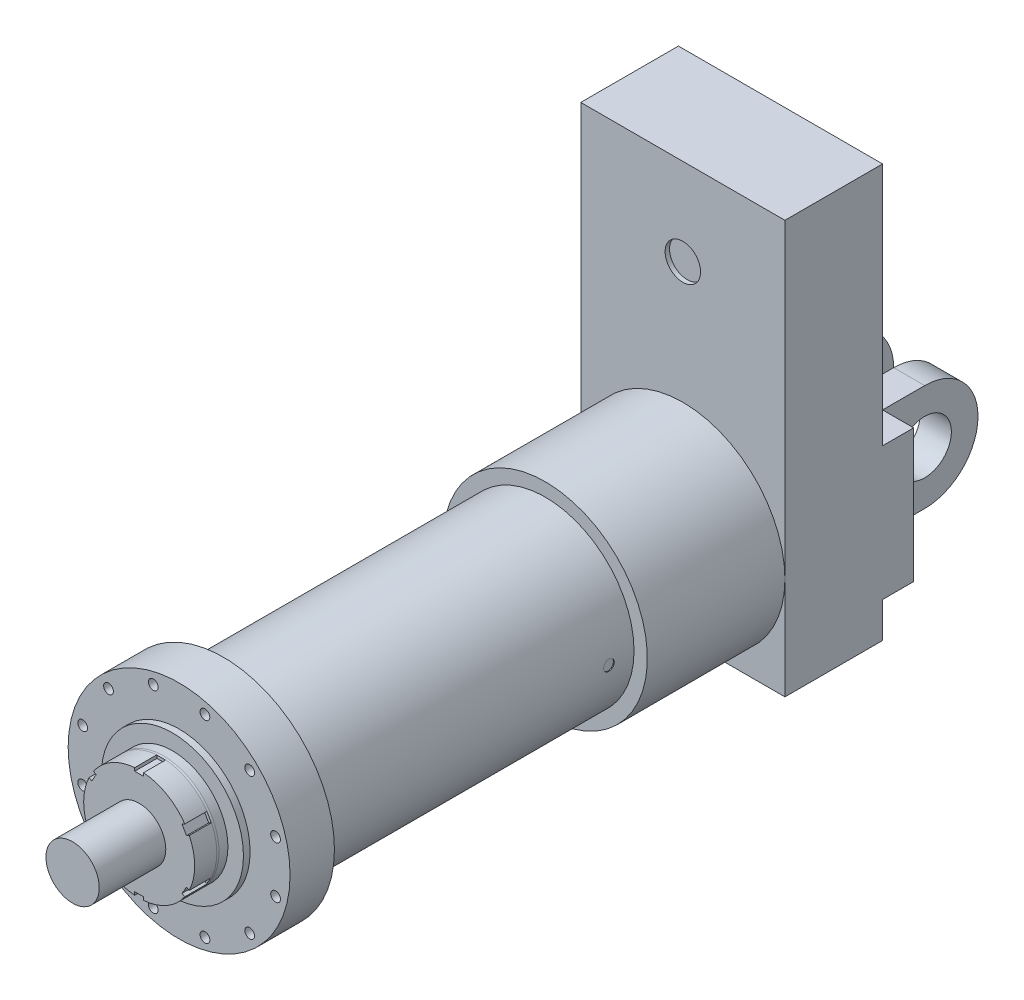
ISO-10303-21;
HEADER;
FILE_DESCRIPTION(('STEP AP214'),'2;1');
FILE_NAME('part.step','',(''),(''),'','','');
FILE_SCHEMA(('AUTOMOTIVE_DESIGN { 1 0 10303 214 1 1 1 1 }'));
ENDSEC;
DATA;
#1=APPLICATION_CONTEXT('core data for automotive mechanical design processes');
#2=APPLICATION_PROTOCOL_DEFINITION('international standard','automotive_design',2000,#1);
#3=PRODUCT_CONTEXT('',#1,'mechanical');
#4=PRODUCT('Part','Part','',(#3));
#5=PRODUCT_RELATED_PRODUCT_CATEGORY('part','',(#4));
#6=PRODUCT_DEFINITION_FORMATION('','',#4);
#7=PRODUCT_DEFINITION_CONTEXT('part definition',#1,'design');
#8=PRODUCT_DEFINITION('design','',#6,#7);
#9=PRODUCT_DEFINITION_SHAPE('','',#8);
#10=(LENGTH_UNIT() NAMED_UNIT(*) SI_UNIT(.MILLI.,.METRE.));
#11=(NAMED_UNIT(*) PLANE_ANGLE_UNIT() SI_UNIT($,.RADIAN.));
#12=(NAMED_UNIT(*) SI_UNIT($,.STERADIAN.) SOLID_ANGLE_UNIT());
#13=UNCERTAINTY_MEASURE_WITH_UNIT(LENGTH_MEASURE(1.E-05),#10,'distance_accuracy_value','');
#14=(GEOMETRIC_REPRESENTATION_CONTEXT(3) GLOBAL_UNCERTAINTY_ASSIGNED_CONTEXT((#13)) GLOBAL_UNIT_ASSIGNED_CONTEXT((#10,
#11,#12)) REPRESENTATION_CONTEXT('',''));
#15=CARTESIAN_POINT('',(0.,0.,0.));
#16=DIRECTION('',(0.,0.,1.));
#17=DIRECTION('',(1.,0.,0.));
#18=AXIS2_PLACEMENT_3D('',#15,#16,#17);
#19=CARTESIAN_POINT('',(0.,0.,-600.));
#20=DIRECTION('',(0.,0.,-1.));
#21=DIRECTION('',(-1.,0.,0.));
#22=AXIS2_PLACEMENT_3D('',#19,#20,#21);
#23=PLANE('',#22);
#24=DIRECTION('',(1.,0.,0.));
#25=VECTOR('',#24,1.);
#26=CARTESIAN_POINT('',(0.,-140.,-600.));
#27=LINE('',#26,#25);
#28=CARTESIAN_POINT('',(39.9999999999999,-140.,-600.));
#29=VERTEX_POINT('',#28);
#30=CARTESIAN_POINT('',(150.,-140.,-600.));
#31=VERTEX_POINT('',#30);
#32=EDGE_CURVE('E1272',#29,#31,#27,.T.);
#33=ORIENTED_EDGE('',*,*,#32,.T.);
#34=DIRECTION('',(0.,1.,0.));
#35=VECTOR('',#34,1.);
#36=CARTESIAN_POINT('',(150.,0.,-600.));
#37=LINE('',#36,#35);
#38=CARTESIAN_POINT('',(150.,140.,-600.));
#39=VERTEX_POINT('',#38);
#40=EDGE_CURVE('E1275',#31,#39,#37,.T.);
#41=ORIENTED_EDGE('',*,*,#40,.T.);
#42=DIRECTION('',(-1.,0.,0.));
#43=VECTOR('',#42,1.);
#44=CARTESIAN_POINT('',(0.,140.,-600.));
#45=LINE('',#44,#43);
#46=CARTESIAN_POINT('',(40.,140.,-600.));
#47=VERTEX_POINT('',#46);
#48=EDGE_CURVE('E1266',#39,#47,#45,.T.);
#49=ORIENTED_EDGE('',*,*,#48,.T.);
#50=DIRECTION('',(0.,-1.,0.));
#51=VECTOR('',#50,1.);
#52=CARTESIAN_POINT('',(40.,0.,-600.));
#53=LINE('',#52,#51);
#54=EDGE_CURVE('E1269',#47,#29,#53,.T.);
#55=ORIENTED_EDGE('',*,*,#54,.T.);
#56=EDGE_LOOP('',(#33,#41,#49,#55));
#57=FACE_BOUND('',#56,.T.);
#58=DIRECTION('',(1.,0.,0.));
#59=VECTOR('',#58,1.);
#60=CARTESIAN_POINT('',(0.,-140.,-600.));
#61=LINE('',#60,#59);
#62=CARTESIAN_POINT('',(-150.,-140.,-600.));
#63=VERTEX_POINT('',#62);
#64=CARTESIAN_POINT('',(-40.0000000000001,-140.,-600.));
#65=VERTEX_POINT('',#64);
#66=EDGE_CURVE('E1259',#63,#65,#61,.T.);
#67=ORIENTED_EDGE('',*,*,#66,.T.);
#68=DIRECTION('',(0.,1.,0.));
#69=VECTOR('',#68,1.);
#70=CARTESIAN_POINT('',(-40.,0.,-600.));
#71=LINE('',#70,#69);
#72=CARTESIAN_POINT('',(-40.,140.,-600.));
#73=VERTEX_POINT('',#72);
#74=EDGE_CURVE('E1262',#65,#73,#71,.T.);
#75=ORIENTED_EDGE('',*,*,#74,.T.);
#76=DIRECTION('',(-1.,0.,0.));
#77=VECTOR('',#76,1.);
#78=CARTESIAN_POINT('',(0.,140.,-600.));
#79=LINE('',#78,#77);
#80=CARTESIAN_POINT('',(-150.,140.,-600.));
#81=VERTEX_POINT('',#80);
#82=EDGE_CURVE('E1253',#73,#81,#79,.T.);
#83=ORIENTED_EDGE('',*,*,#82,.T.);
#84=DIRECTION('',(0.,-1.,0.));
#85=VECTOR('',#84,1.);
#86=CARTESIAN_POINT('',(-150.,0.,-600.));
#87=LINE('',#86,#85);
#88=EDGE_CURVE('E1256',#81,#63,#87,.T.);
#89=ORIENTED_EDGE('',*,*,#88,.T.);
#90=EDGE_LOOP('',(#67,#75,#83,#89));
#91=FACE_BOUND('',#90,.T.);
#92=DIRECTION('',(0.,1.,0.));
#93=VECTOR('',#92,1.);
#94=CARTESIAN_POINT('',(-230.,150.,-600.));
#95=LINE('',#94,#93);
#96=CARTESIAN_POINT('',(-230.,-150.,-600.));
#97=VERTEX_POINT('',#96);
#98=CARTESIAN_POINT('',(-230.,150.,-600.));
#99=VERTEX_POINT('',#98);
#100=EDGE_CURVE('E413',#97,#99,#95,.T.);
#101=ORIENTED_EDGE('',*,*,#100,.T.);
#102=DIRECTION('',(1.,0.,0.));
#103=VECTOR('',#102,1.);
#104=CARTESIAN_POINT('',(230.,150.,-600.));
#105=LINE('',#104,#103);
#106=CARTESIAN_POINT('',(230.,150.,-600.));
#107=VERTEX_POINT('',#106);
#108=EDGE_CURVE('E417',#99,#107,#105,.T.);
#109=ORIENTED_EDGE('',*,*,#108,.T.);
#110=DIRECTION('',(0.,-1.,0.));
#111=VECTOR('',#110,1.);
#112=CARTESIAN_POINT('',(230.,150.,-600.));
#113=LINE('',#112,#111);
#114=CARTESIAN_POINT('',(230.,-150.,-600.));
#115=VERTEX_POINT('',#114);
#116=EDGE_CURVE('E421',#107,#115,#113,.T.);
#117=ORIENTED_EDGE('',*,*,#116,.T.);
#118=DIRECTION('',(-1.,0.,0.));
#119=VECTOR('',#118,1.);
#120=CARTESIAN_POINT('',(230.,-150.,-600.));
#121=LINE('',#120,#119);
#122=EDGE_CURVE('E424',#115,#97,#121,.T.);
#123=ORIENTED_EDGE('',*,*,#122,.T.);
#124=EDGE_LOOP('',(#101,#109,#117,#123));
#125=FACE_BOUND('',#124,.T.);
#126=ADVANCED_FACE('F39',(#57,#91,#125),#23,.T.);
#127=CARTESIAN_POINT('',(0.,0.,-530.));
#128=DIRECTION('',(0.,0.,-1.));
#129=DIRECTION('',(-1.,0.,0.));
#130=AXIS2_PLACEMENT_3D('',#127,#128,#129);
#131=PLANE('',#130);
#132=DIRECTION('',(-1.,0.,0.));
#133=VECTOR('',#132,1.);
#134=CARTESIAN_POINT('',(230.,-150.,-530.));
#135=LINE('',#134,#133);
#136=CARTESIAN_POINT('',(230.,-150.,-530.));
#137=VERTEX_POINT('',#136);
#138=CARTESIAN_POINT('',(-230.,-150.,-530.));
#139=VERTEX_POINT('',#138);
#140=EDGE_CURVE('E418',#137,#139,#135,.T.);
#141=ORIENTED_EDGE('',*,*,#140,.F.);
#142=DIRECTION('',(0.,-1.,0.));
#143=VECTOR('',#142,1.);
#144=CARTESIAN_POINT('',(230.,700.,-530.));
#145=LINE('',#144,#143);
#146=CARTESIAN_POINT('',(230.,-230.,-530.));
#147=VERTEX_POINT('',#146);
#148=EDGE_CURVE('E465',#137,#147,#145,.T.);
#149=ORIENTED_EDGE('',*,*,#148,.T.);
#150=DIRECTION('',(-1.,0.,0.));
#151=VECTOR('',#150,1.);
#152=CARTESIAN_POINT('',(230.,-230.,-530.));
#153=LINE('',#152,#151);
#154=CARTESIAN_POINT('',(-230.,-230.,-530.));
#155=VERTEX_POINT('',#154);
#156=EDGE_CURVE('E469',#147,#155,#153,.T.);
#157=ORIENTED_EDGE('',*,*,#156,.T.);
#158=DIRECTION('',(0.,1.,0.));
#159=VECTOR('',#158,1.);
#160=CARTESIAN_POINT('',(-230.,700.,-530.));
#161=LINE('',#160,#159);
#162=EDGE_CURVE('E458',#155,#139,#161,.T.);
#163=ORIENTED_EDGE('',*,*,#162,.T.);
#164=EDGE_LOOP('',(#141,#149,#157,#163));
#165=FACE_BOUND('',#164,.T.);
#166=ADVANCED_FACE('F1058',(#165),#131,.T.);
#167=CARTESIAN_POINT('',(0.,0.,865.));
#168=DIRECTION('',(0.,0.,1.));
#169=DIRECTION('',(1.,0.,0.));
#170=AXIS2_PLACEMENT_3D('',#167,#168,#169);
#171=PLANE('',#170);
#172=DIRECTION('',(0.866025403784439,-0.5,0.));
#173=VECTOR('',#172,1.);
#174=CARTESIAN_POINT('',(112.906209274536,-53.6394249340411,865.));
#175=LINE('',#174,#173);
#176=CARTESIAN_POINT('',(106.757984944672,-50.0897459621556,865.));
#177=VERTEX_POINT('',#176);
#178=CARTESIAN_POINT('',(112.140218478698,-53.1971799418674,865.));
#179=VERTEX_POINT('',#178);
#180=EDGE_CURVE('E521',#177,#179,#175,.T.);
#181=ORIENTED_EDGE('',*,*,#180,.F.);
#182=DIRECTION('',(0.5,0.866025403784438,0.));
#183=VECTOR('',#182,1.);
#184=CARTESIAN_POINT('',(106.757984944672,-50.0897459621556,865.));
#185=LINE('',#184,#183);
#186=CARTESIAN_POINT('',(96.7579849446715,-67.4102540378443,865.));
#187=VERTEX_POINT('',#186);
#188=EDGE_CURVE('E683',#187,#177,#185,.T.);
#189=ORIENTED_EDGE('',*,*,#188,.F.);
#190=DIRECTION('',(-0.866025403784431,0.500000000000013,0.));
#191=VECTOR('',#190,1.);
#192=CARTESIAN_POINT('',(96.7579849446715,-67.4102540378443,865.));
#193=LINE('',#192,#191);
#194=CARTESIAN_POINT('',(102.140218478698,-70.5176880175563,865.));
#195=VERTEX_POINT('',#194);
#196=EDGE_CURVE('E515',#195,#187,#193,.T.);
#197=ORIENTED_EDGE('',*,*,#196,.F.);
#198=CARTESIAN_POINT('',(0.,0.,865.));
#199=DIRECTION('',(0.,0.,1.));
#200=DIRECTION('',(1.,0.,0.));
#201=AXIS2_PLACEMENT_3D('',#198,#199,#200);
#202=CIRCLE('',#201,124.118365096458);
#203=EDGE_CURVE('E2061',#195,#179,#202,.T.);
#204=ORIENTED_EDGE('',*,*,#203,.T.);
#205=EDGE_LOOP('',(#181,#189,#197,#204));
#206=FACE_BOUND('',#205,.T.);
#207=ADVANCED_FACE('F982',(#206),#171,.T.);
#208=DIRECTION('',(0.,-1.,0.));
#209=VECTOR('',#208,1.);
#210=CARTESIAN_POINT('',(10.,-124.599357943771,865.));
#211=LINE('',#210,#209);
#212=CARTESIAN_POINT('',(10.,-117.5,865.));
#213=VERTEX_POINT('',#212);
#214=CARTESIAN_POINT('',(10.,-123.714867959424,865.));
#215=VERTEX_POINT('',#214);
#216=EDGE_CURVE('E672',#213,#215,#211,.T.);
#217=ORIENTED_EDGE('',*,*,#216,.F.);
#218=DIRECTION('',(1.,0.,0.));
#219=VECTOR('',#218,1.);
#220=CARTESIAN_POINT('',(10.,-117.5,865.));
#221=LINE('',#220,#219);
#222=CARTESIAN_POINT('',(-9.99999999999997,-117.5,865.));
#223=VERTEX_POINT('',#222);
#224=EDGE_CURVE('E666',#223,#213,#221,.T.);
#225=ORIENTED_EDGE('',*,*,#224,.F.);
#226=DIRECTION('',(0.,1.,0.));
#227=VECTOR('',#226,1.);
#228=CARTESIAN_POINT('',(-9.99999999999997,-117.5,865.));
#229=LINE('',#228,#227);
#230=CARTESIAN_POINT('',(-10.0000000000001,-123.714867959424,865.));
#231=VERTEX_POINT('',#230);
#232=EDGE_CURVE('E667',#231,#223,#229,.T.);
#233=ORIENTED_EDGE('',*,*,#232,.F.);
#234=EDGE_CURVE('E2055',#231,#215,#202,.T.);
#235=ORIENTED_EDGE('',*,*,#234,.T.);
#236=EDGE_LOOP('',(#217,#225,#233,#235));
#237=FACE_BOUND('',#236,.T.);
#238=ADVANCED_FACE('F1846',(#237),#171,.T.);
#239=DIRECTION('',(-0.866025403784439,-0.5,0.));
#240=VECTOR('',#239,1.);
#241=CARTESIAN_POINT('',(-102.906209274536,-70.95993300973,865.));
#242=LINE('',#241,#240);
#243=CARTESIAN_POINT('',(-96.7579849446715,-67.4102540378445,865.));
#244=VERTEX_POINT('',#243);
#245=CARTESIAN_POINT('',(-102.140218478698,-70.5176880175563,865.));
#246=VERTEX_POINT('',#245);
#247=EDGE_CURVE('E655',#244,#246,#242,.T.);
#248=ORIENTED_EDGE('',*,*,#247,.F.);
#249=DIRECTION('',(0.5,-0.866025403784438,0.));
#250=VECTOR('',#249,1.);
#251=CARTESIAN_POINT('',(-96.7579849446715,-67.4102540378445,865.));
#252=LINE('',#251,#250);
#253=CARTESIAN_POINT('',(-106.757984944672,-50.0897459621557,865.));
#254=VERTEX_POINT('',#253);
#255=EDGE_CURVE('E649',#254,#244,#252,.T.);
#256=ORIENTED_EDGE('',*,*,#255,.F.);
#257=DIRECTION('',(0.866025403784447,0.499999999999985,0.));
#258=VECTOR('',#257,1.);
#259=CARTESIAN_POINT('',(-106.757984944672,-50.0897459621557,865.));
#260=LINE('',#259,#258);
#261=CARTESIAN_POINT('',(-112.140218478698,-53.1971799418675,865.));
#262=VERTEX_POINT('',#261);
#263=EDGE_CURVE('E650',#262,#254,#260,.T.);
#264=ORIENTED_EDGE('',*,*,#263,.F.);
#265=EDGE_CURVE('E2049',#262,#246,#202,.T.);
#266=ORIENTED_EDGE('',*,*,#265,.T.);
#267=EDGE_LOOP('',(#248,#256,#264,#266));
#268=FACE_BOUND('',#267,.T.);
#269=ADVANCED_FACE('F1837',(#268),#171,.T.);
#270=DIRECTION('',(-0.86602540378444,0.499999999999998,0.));
#271=VECTOR('',#270,1.);
#272=CARTESIAN_POINT('',(-112.906209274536,53.6394249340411,865.));
#273=LINE('',#272,#271);
#274=CARTESIAN_POINT('',(-106.757984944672,50.0897459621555,865.));
#275=VERTEX_POINT('',#274);
#276=CARTESIAN_POINT('',(-112.140218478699,53.1971799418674,865.));
#277=VERTEX_POINT('',#276);
#278=EDGE_CURVE('E638',#275,#277,#273,.T.);
#279=ORIENTED_EDGE('',*,*,#278,.F.);
#280=DIRECTION('',(-0.500000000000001,-0.866025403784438,0.));
#281=VECTOR('',#280,1.);
#282=CARTESIAN_POINT('',(-106.757984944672,50.0897459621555,865.));
#283=LINE('',#282,#281);
#284=CARTESIAN_POINT('',(-96.7579849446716,67.4102540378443,865.));
#285=VERTEX_POINT('',#284);
#286=EDGE_CURVE('E632',#285,#275,#283,.T.);
#287=ORIENTED_EDGE('',*,*,#286,.F.);
#288=DIRECTION('',(0.866025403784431,-0.500000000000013,0.));
#289=VECTOR('',#288,1.);
#290=CARTESIAN_POINT('',(-96.7579849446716,67.4102540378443,865.));
#291=LINE('',#290,#289);
#292=CARTESIAN_POINT('',(-102.140218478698,70.5176880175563,865.));
#293=VERTEX_POINT('',#292);
#294=EDGE_CURVE('E633',#293,#285,#291,.T.);
#295=ORIENTED_EDGE('',*,*,#294,.F.);
#296=EDGE_CURVE('E2043',#293,#277,#202,.T.);
#297=ORIENTED_EDGE('',*,*,#296,.T.);
#298=EDGE_LOOP('',(#279,#287,#295,#297));
#299=FACE_BOUND('',#298,.T.);
#300=ADVANCED_FACE('F1826',(#299),#171,.T.);
#301=DIRECTION('',(0.,1.,0.));
#302=VECTOR('',#301,1.);
#303=CARTESIAN_POINT('',(-10.,124.599357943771,865.));
#304=LINE('',#303,#302);
#305=CARTESIAN_POINT('',(-10.,117.5,865.));
#306=VERTEX_POINT('',#305);
#307=CARTESIAN_POINT('',(-10.,123.714867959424,865.));
#308=VERTEX_POINT('',#307);
#309=EDGE_CURVE('E621',#306,#308,#304,.T.);
#310=ORIENTED_EDGE('',*,*,#309,.F.);
#311=DIRECTION('',(-1.,0.,0.));
#312=VECTOR('',#311,1.);
#313=CARTESIAN_POINT('',(-10.,117.5,865.));
#314=LINE('',#313,#312);
#315=CARTESIAN_POINT('',(9.99999999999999,117.5,865.));
#316=VERTEX_POINT('',#315);
#317=EDGE_CURVE('E615',#316,#306,#314,.T.);
#318=ORIENTED_EDGE('',*,*,#317,.F.);
#319=DIRECTION('',(0.,-1.,0.));
#320=VECTOR('',#319,1.);
#321=CARTESIAN_POINT('',(9.99999999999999,117.5,865.));
#322=LINE('',#321,#320);
#323=CARTESIAN_POINT('',(9.99999999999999,123.714867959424,865.));
#324=VERTEX_POINT('',#323);
#325=EDGE_CURVE('E616',#324,#316,#322,.T.);
#326=ORIENTED_EDGE('',*,*,#325,.F.);
#327=EDGE_CURVE('E2037',#324,#308,#202,.T.);
#328=ORIENTED_EDGE('',*,*,#327,.T.);
#329=EDGE_LOOP('',(#310,#318,#326,#328));
#330=FACE_BOUND('',#329,.T.);
#331=ADVANCED_FACE('F983',(#330),#171,.T.);
#332=CARTESIAN_POINT('',(0.,0.,725.));
#333=DIRECTION('',(0.,0.,-1.));
#334=DIRECTION('',(-1.,0.,0.));
#335=AXIS2_PLACEMENT_3D('',#332,#333,#334);
#336=CYLINDRICAL_SURFACE('',#335,200.);
#337=CARTESIAN_POINT('',(200.,0.,44.5));
#338=CARTESIAN_POINT('',(200.000000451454,-0.336818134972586,44.4999972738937));
#339=CARTESIAN_POINT('',(199.999147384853,-0.673592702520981,44.5141864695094));
#340=CARTESIAN_POINT('',(199.995759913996,-1.34485594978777,44.5708419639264));
#341=CARTESIAN_POINT('',(199.993225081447,-1.67934402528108,44.6133154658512));
#342=CARTESIAN_POINT('',(199.986541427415,-2.34388649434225,44.7263038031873));
#343=CARTESIAN_POINT('',(199.982390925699,-2.67393590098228,44.7968478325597));
#344=CARTESIAN_POINT('',(199.97259396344,-3.32690256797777,44.9654685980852));
#345=CARTESIAN_POINT('',(199.966947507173,-3.64981984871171,45.063545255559));
#346=CARTESIAN_POINT('',(199.95432206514,-4.28605714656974,45.2864689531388));
#347=CARTESIAN_POINT('',(199.947343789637,-4.59938217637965,45.411301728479));
#348=CARTESIAN_POINT('',(199.932250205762,-5.21439925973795,45.6868788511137));
#349=CARTESIAN_POINT('',(199.92413488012,-5.51609113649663,45.837623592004));
#350=CARTESIAN_POINT('',(199.906998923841,-6.10563167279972,46.1639107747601));
#351=CARTESIAN_POINT('',(199.897978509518,-6.39348361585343,46.3394472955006));
#352=CARTESIAN_POINT('',(199.879285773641,-6.95338726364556,46.7140984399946));
#353=CARTESIAN_POINT('',(199.869613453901,-7.22543901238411,46.9132129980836));
#354=CARTESIAN_POINT('',(199.84987810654,-7.75214646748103,47.3338690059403));
#355=CARTESIAN_POINT('',(199.839814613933,-8.00678041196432,47.555437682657));
#356=CARTESIAN_POINT('',(199.819593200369,-8.49648428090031,48.0192286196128));
#357=CARTESIAN_POINT('',(199.809435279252,-8.73155417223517,48.2614509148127));
#358=CARTESIAN_POINT('',(199.789312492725,-9.18047473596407,48.7648450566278));
#359=CARTESIAN_POINT('',(199.779347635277,-9.39432453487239,49.0260176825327));
#360=CARTESIAN_POINT('',(199.759894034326,-9.79927768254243,49.5654558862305));
#361=CARTESIAN_POINT('',(199.750405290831,-9.99038103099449,49.8437214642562));
#362=CARTESIAN_POINT('',(199.732166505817,-10.3486167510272,50.4155890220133));
#363=CARTESIAN_POINT('',(199.723417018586,-10.5157312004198,50.7092022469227));
#364=CARTESIAN_POINT('',(199.706913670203,-10.8246278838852,51.3094920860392));
#365=CARTESIAN_POINT('',(199.699159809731,-10.9664101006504,51.6161687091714));
#366=CARTESIAN_POINT('',(199.684868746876,-11.2236267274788,52.2404038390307));
#367=CARTESIAN_POINT('',(199.678331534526,-11.3390613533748,52.5579622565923));
#368=CARTESIAN_POINT('',(199.666660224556,-11.5427558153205,53.2017032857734));
#369=CARTESIAN_POINT('',(199.661526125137,-11.631015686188,53.5278858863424));
#370=CARTESIAN_POINT('',(199.652812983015,-11.7796353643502,54.1861499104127));
#371=CARTESIAN_POINT('',(199.649232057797,-11.8400289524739,54.5182236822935));
#372=CARTESIAN_POINT('',(199.643718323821,-11.9326397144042,55.1862908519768));
#373=CARTESIAN_POINT('',(199.641785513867,-11.9648569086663,55.5222842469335));
#374=CARTESIAN_POINT('',(199.639623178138,-12.0008826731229,56.1957928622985));
#375=CARTESIAN_POINT('',(199.639393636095,-12.0046915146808,56.5333080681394));
#376=CARTESIAN_POINT('',(199.640644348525,-11.9838738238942,57.207457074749));
#377=CARTESIAN_POINT('',(199.642124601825,-11.9592473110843,57.5440908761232));
#378=CARTESIAN_POINT('',(199.646749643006,-11.881786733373,58.2136429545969));
#379=CARTESIAN_POINT('',(199.649892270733,-11.8289892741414,58.5465654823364));
#380=CARTESIAN_POINT('',(199.657751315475,-11.6955888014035,59.2067729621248));
#381=CARTESIAN_POINT('',(199.662467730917,-11.6149858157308,59.5340579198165));
#382=CARTESIAN_POINT('',(199.673340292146,-11.4265512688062,60.1806698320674));
#383=CARTESIAN_POINT('',(199.679496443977,-11.3187195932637,60.4999967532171));
#384=CARTESIAN_POINT('',(199.693073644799,-11.0765982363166,61.1284294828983));
#385=CARTESIAN_POINT('',(199.700494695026,-10.9423085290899,61.4375352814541));
#386=CARTESIAN_POINT('',(199.716396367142,-10.6481322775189,62.0435365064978));
#387=CARTESIAN_POINT('',(199.724877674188,-10.4882291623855,62.340423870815));
#388=CARTESIAN_POINT('',(199.742655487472,-10.1440259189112,62.9196760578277));
#389=CARTESIAN_POINT('',(199.75195199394,-9.95972578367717,63.2020408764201));
#390=CARTESIAN_POINT('',(199.771096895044,-9.5680341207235,63.7502561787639));
#391=CARTESIAN_POINT('',(199.780945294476,-9.36064239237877,64.0161065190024));
#392=CARTESIAN_POINT('',(199.800915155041,-8.92423659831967,64.529413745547));
#393=CARTESIAN_POINT('',(199.811036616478,-8.69522250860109,64.7768706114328));
#394=CARTESIAN_POINT('',(199.831282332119,-8.2168118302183,65.2520193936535));
#395=CARTESIAN_POINT('',(199.841406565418,-7.96738357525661,65.4796794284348));
#396=CARTESIAN_POINT('',(199.861354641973,-7.45022594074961,65.9131810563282));
#397=CARTESIAN_POINT('',(199.871178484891,-7.18249654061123,66.1190226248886));
#398=CARTESIAN_POINT('',(199.890247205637,-6.63063236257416,66.5074255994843));
#399=CARTESIAN_POINT('',(199.899492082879,-6.34649756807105,66.6899869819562));
#400=CARTESIAN_POINT('',(199.917140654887,-5.76383629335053,67.0305297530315));
#401=CARTESIAN_POINT('',(199.92554435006,-5.46530982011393,67.1885111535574));
#402=CARTESIAN_POINT('',(199.94127250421,-4.85596814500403,67.4787734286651));
#403=CARTESIAN_POINT('',(199.94859691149,-4.54515235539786,67.6110530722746));
#404=CARTESIAN_POINT('',(199.961958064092,-3.91345386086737,67.8489554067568));
#405=CARTESIAN_POINT('',(199.967994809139,-3.5925711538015,67.9545780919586));
#406=CARTESIAN_POINT('',(199.978609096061,-2.94302558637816,68.138407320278));
#407=CARTESIAN_POINT('',(199.983186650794,-2.61436279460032,68.2166141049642));
#408=CARTESIAN_POINT('',(199.990752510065,-1.95159736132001,68.3450498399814));
#409=CARTESIAN_POINT('',(199.993740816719,-1.61749472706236,68.3952788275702));
#410=CARTESIAN_POINT('',(199.998039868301,-0.946756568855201,68.467340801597));
#411=CARTESIAN_POINT('',(199.999353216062,-0.610125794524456,68.489217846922));
#412=CARTESIAN_POINT('',(200.000273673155,0.0637847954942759,68.5045628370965));
#413=CARTESIAN_POINT('',(199.999880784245,0.40106461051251,68.4980308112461));
#414=CARTESIAN_POINT('',(199.997399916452,1.07386998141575,68.4566048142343));
#415=CARTESIAN_POINT('',(199.995311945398,1.4093955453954,68.4217109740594));
#416=CARTESIAN_POINT('',(199.98950012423,2.07630576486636,68.3238125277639));
#417=CARTESIAN_POINT('',(199.985776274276,2.4076904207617,68.2608079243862));
#418=CARTESIAN_POINT('',(199.976801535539,3.06372180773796,68.1071968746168));
#419=CARTESIAN_POINT('',(199.971551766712,3.38837329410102,68.0166106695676));
#420=CARTESIAN_POINT('',(199.959672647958,4.02888618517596,67.8084689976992));
#421=CARTESIAN_POINT('',(199.953043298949,4.34474759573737,67.6909135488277));
#422=CARTESIAN_POINT('',(199.938592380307,4.96544648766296,67.4296715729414));
#423=CARTESIAN_POINT('',(199.930770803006,5.27028389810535,67.2859848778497));
#424=CARTESIAN_POINT('',(199.914156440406,5.86677844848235,66.973503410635));
#425=CARTESIAN_POINT('',(199.905363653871,6.15843557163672,66.8047086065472));
#426=CARTESIAN_POINT('',(199.887043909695,6.72686049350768,66.4429862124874));
#427=CARTESIAN_POINT('',(199.877516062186,7.00360953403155,66.2500291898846));
#428=CARTESIAN_POINT('',(199.85800533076,7.53987480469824,65.8415150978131));
#429=CARTESIAN_POINT('',(199.84802244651,7.79939102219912,65.6259580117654));
#430=CARTESIAN_POINT('',(199.827884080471,8.29935868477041,65.1737683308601));
#431=CARTESIAN_POINT('',(199.817728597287,8.53980997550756,64.9371355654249));
#432=CARTESIAN_POINT('',(199.797532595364,8.99994549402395,64.4444693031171));
#433=CARTESIAN_POINT('',(199.787492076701,9.21962970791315,64.1884357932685));
#434=CARTESIAN_POINT('',(199.767797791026,9.63694312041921,63.6584379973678));
#435=CARTESIAN_POINT('',(199.758144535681,9.83454371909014,63.3844511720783));
#436=CARTESIAN_POINT('',(199.739512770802,10.205960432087,62.8207823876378));
#437=CARTESIAN_POINT('',(199.730534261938,10.3797765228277,62.5311004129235));
#438=CARTESIAN_POINT('',(199.713507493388,10.7023843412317,61.9380971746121));
#439=CARTESIAN_POINT('',(199.70545922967,10.8511761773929,61.6347759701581));
#440=CARTESIAN_POINT('',(199.690522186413,11.1226725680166,61.0166473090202));
#441=CARTESIAN_POINT('',(199.683633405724,11.245377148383,60.7018398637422));
#442=CARTESIAN_POINT('',(199.671215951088,11.463746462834,60.0631910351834));
#443=CARTESIAN_POINT('',(199.665686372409,11.5594291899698,59.7393558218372));
#444=CARTESIAN_POINT('',(199.656139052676,11.7231767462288,59.0847544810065));
#445=CARTESIAN_POINT('',(199.652121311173,11.7912415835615,58.7539883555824));
#446=CARTESIAN_POINT('',(199.645712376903,11.8992631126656,58.0878845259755));
#447=CARTESIAN_POINT('',(199.643321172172,11.9392200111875,57.7525468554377));
#448=CARTESIAN_POINT('',(199.640233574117,11.99073839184,57.079689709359));
#449=CARTESIAN_POINT('',(199.639537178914,12.0022999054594,56.7421702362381));
#450=CARTESIAN_POINT('',(199.639858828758,11.9969484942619,56.0678915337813));
#451=CARTESIAN_POINT('',(199.640874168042,11.9800805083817,55.731131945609));
#452=CARTESIAN_POINT('',(199.644585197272,11.9180771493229,55.0602348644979));
#453=CARTESIAN_POINT('',(199.647280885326,11.8729418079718,54.7260973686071));
#454=CARTESIAN_POINT('',(199.654275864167,11.754727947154,54.0628194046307));
#455=CARTESIAN_POINT('',(199.658575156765,11.6816493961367,53.7336789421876));
#456=CARTESIAN_POINT('',(199.668655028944,11.5080731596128,53.0827324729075));
#457=CARTESIAN_POINT('',(199.674435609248,11.4075754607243,52.7609264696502));
#458=CARTESIAN_POINT('',(199.687313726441,11.1798805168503,52.1269324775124));
#459=CARTESIAN_POINT('',(199.694411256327,11.0526834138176,51.814744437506));
#460=CARTESIAN_POINT('',(199.709721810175,10.7724967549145,51.2021943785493));
#461=CARTESIAN_POINT('',(199.71793483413,10.6195071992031,50.901832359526));
#462=CARTESIAN_POINT('',(199.735243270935,10.2888285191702,50.3150654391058));
#463=CARTESIAN_POINT('',(199.744338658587,10.1111401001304,50.028660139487));
#464=CARTESIAN_POINT('',(199.763154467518,9.73232068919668,49.4718189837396));
#465=CARTESIAN_POINT('',(199.772874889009,9.53118968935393,49.201383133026));
#466=CARTESIAN_POINT('',(199.792680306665,9.10659722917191,48.678005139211));
#467=CARTESIAN_POINT('',(199.802765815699,8.88310351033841,48.4250891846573));
#468=CARTESIAN_POINT('',(199.823002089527,8.41561396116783,47.9389745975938));
#469=CARTESIAN_POINT('',(199.833152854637,8.17161803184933,47.7057760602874));
#470=CARTESIAN_POINT('',(199.853234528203,7.66478752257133,47.2606924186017));
#471=CARTESIAN_POINT('',(199.863165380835,7.40194822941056,47.0488126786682));
#472=CARTESIAN_POINT('',(199.882523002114,6.8593497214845,46.6479393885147));
#473=CARTESIAN_POINT('',(199.891949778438,6.57959076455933,46.4589454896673));
#474=CARTESIAN_POINT('',(199.910042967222,6.00478830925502,46.1049735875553));
#475=CARTESIAN_POINT('',(199.918708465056,5.7097270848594,45.9400243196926));
#476=CARTESIAN_POINT('',(199.935020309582,5.10672265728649,45.6355873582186));
#477=CARTESIAN_POINT('',(199.942666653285,4.79877941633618,45.4960997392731));
#478=CARTESIAN_POINT('',(199.95671533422,4.17252410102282,45.243718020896));
#479=CARTESIAN_POINT('',(199.96311897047,3.85422326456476,45.1307961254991));
#480=CARTESIAN_POINT('',(199.974509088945,3.20932132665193,44.9321958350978));
#481=CARTESIAN_POINT('',(199.979495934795,2.88272237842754,44.8465104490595));
#482=CARTESIAN_POINT('',(199.989051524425,2.13414018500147,44.6835216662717));
#483=CARTESIAN_POINT('',(199.99314188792,1.71026312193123,44.6147621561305));
#484=CARTESIAN_POINT('',(199.998615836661,0.857567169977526,44.5230030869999));
#485=CARTESIAN_POINT('',(199.999999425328,0.428748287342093,44.5000034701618));
#486=CARTESIAN_POINT('',(200.,0.,44.5));
#487=B_SPLINE_CURVE_WITH_KNOTS('',3,(#337,#338,#339,#340,#341,#342,#343,#344,#345,#346,#347,
#348,#349,#350,#351,#352,#353,#354,#355,#356,#357,#358,#359,#360,#361,#362,#363,#364,#365,#366,
#367,#368,#369,#370,#371,#372,#373,#374,#375,#376,#377,#378,#379,#380,#381,#382,#383,#384,#385,
#386,#387,#388,#389,#390,#391,#392,#393,#394,#395,#396,#397,#398,#399,#400,#401,#402,#403,#404,
#405,#406,#407,#408,#409,#410,#411,#412,#413,#414,#415,#416,#417,#418,#419,#420,#421,#422,#423,
#424,#425,#426,#427,#428,#429,#430,#431,#432,#433,#434,#435,#436,#437,#438,#439,#440,#441,#442,
#443,#444,#445,#446,#447,#448,#449,#450,#451,#452,#453,#454,#455,#456,#457,#458,#459,#460,#461,
#462,#463,#464,#465,#466,#467,#468,#469,#470,#471,#472,#473,#474,#475,#476,#477,#478,#479,#480,
#481,#482,#483,#484,#485,#486),.UNSPECIFIED.,.T.,.F.,(4,2,2,2,2,2,2,2,2,2,2,2,2,2,2,2,2,2,2,2,2,
2,2,2,2,2,2,2,2,2,2,2,2,2,2,2,2,2,2,2,2,2,2,2,2,2,2,2,2,2,2,2,2,2,2,2,2,2,2,2,2,2,2,2,2,2,2,2,2,
2,2,2,2,2,4),(0.,1.01007974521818,2.02041682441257,3.03180743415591,4.04319515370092,
5.0540449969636,6.06491019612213,7.07553437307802,8.08615573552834,9.09801754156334,
10.1098810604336,11.1217862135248,12.1336913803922,13.1463486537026,14.1590066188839,
15.171656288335,16.1843046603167,17.1957222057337,18.207139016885,19.2185461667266,
20.2299526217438,21.2400480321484,22.250142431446,23.2602410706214,24.2703406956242,
25.2810964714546,26.2918525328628,27.3026173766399,28.3133833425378,29.3257480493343,
30.3381138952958,31.350480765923,32.3628471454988,33.3752619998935,34.3876770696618,
35.4000832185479,36.4124880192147,37.4233176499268,38.4341462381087,39.444970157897,
40.4557939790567,41.4658777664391,42.4759608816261,43.4860504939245,44.4961413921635,
45.5074749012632,46.5188091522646,47.5301515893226,48.5414947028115,49.5541327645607,
50.566771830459,51.5794065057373,52.5920401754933,53.6039979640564,54.6159554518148,
55.6279054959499,56.6398544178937,57.650205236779,58.6605549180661,59.6709057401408,
60.6812570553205,61.6916029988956,62.7019489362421,63.7122660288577,64.7225834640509,
65.7343799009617,66.7461812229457,67.75823651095,68.7702763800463,69.7835159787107,
70.7967585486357,71.8089361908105,72.8208538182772,74.1066233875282,75.3923913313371),.UNSPECIFIED.);
#488=CARTESIAN_POINT('',(200.,0.,44.5));
#489=VERTEX_POINT('',#488);
#490=EDGE_CURVE('E1237',#489,#489,#487,.T.);
#491=ORIENTED_EDGE('',*,*,#490,.T.);
#492=EDGE_LOOP('',(#491));
#493=FACE_BOUND('',#492,.T.);
#494=CARTESIAN_POINT('',(0.,0.,725.));
#495=DIRECTION('',(0.,0.,1.));
#496=DIRECTION('',(1.,0.,0.));
#497=AXIS2_PLACEMENT_3D('',#494,#495,#496);
#498=CIRCLE('',#497,200.);
#499=CARTESIAN_POINT('',(200.,0.,725.));
#500=VERTEX_POINT('',#499);
#501=EDGE_CURVE('E814',#500,#500,#498,.T.);
#502=ORIENTED_EDGE('',*,*,#501,.F.);
#503=EDGE_LOOP('',(#502));
#504=FACE_BOUND('',#503,.T.);
#505=CARTESIAN_POINT('',(0.,0.,0.));
#506=DIRECTION('',(0.,0.,1.));
#507=DIRECTION('',(1.,0.,0.));
#508=AXIS2_PLACEMENT_3D('',#505,#506,#507);
#509=CIRCLE('',#508,200.);
#510=CARTESIAN_POINT('',(200.,0.,0.));
#511=VERTEX_POINT('',#510);
#512=EDGE_CURVE('E803',#511,#511,#509,.T.);
#513=ORIENTED_EDGE('',*,*,#512,.T.);
#514=EDGE_LOOP('',(#513));
#515=FACE_BOUND('',#514,.T.);
#516=CARTESIAN_POINT('',(-200.,0.,682.5));
#517=CARTESIAN_POINT('',(-200.000000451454,0.336818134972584,682.500002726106));
#518=CARTESIAN_POINT('',(-199.999147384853,0.673592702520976,682.485813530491));
#519=CARTESIAN_POINT('',(-199.995759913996,1.34485594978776,682.429158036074));
#520=CARTESIAN_POINT('',(-199.993225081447,1.67934402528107,682.386684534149));
#521=CARTESIAN_POINT('',(-199.986541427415,2.34388649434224,682.273696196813));
#522=CARTESIAN_POINT('',(-199.982390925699,2.67393590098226,682.20315216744));
#523=CARTESIAN_POINT('',(-199.97259396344,3.32690256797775,682.034531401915));
#524=CARTESIAN_POINT('',(-199.966947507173,3.64981984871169,681.936454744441));
#525=CARTESIAN_POINT('',(-199.95432206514,4.28605714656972,681.713531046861));
#526=CARTESIAN_POINT('',(-199.947343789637,4.59938217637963,681.588698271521));
#527=CARTESIAN_POINT('',(-199.932250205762,5.21439925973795,681.313121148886));
#528=CARTESIAN_POINT('',(-199.92413488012,5.51609113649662,681.162376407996));
#529=CARTESIAN_POINT('',(-199.906998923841,6.10563167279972,680.83608922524));
#530=CARTESIAN_POINT('',(-199.897978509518,6.39348361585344,680.660552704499));
#531=CARTESIAN_POINT('',(-199.879285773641,6.95338726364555,680.285901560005));
#532=CARTESIAN_POINT('',(-199.869613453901,7.22543901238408,680.086787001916));
#533=CARTESIAN_POINT('',(-199.84987810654,7.752146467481,679.66613099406));
#534=CARTESIAN_POINT('',(-199.839814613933,8.00678041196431,679.444562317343));
#535=CARTESIAN_POINT('',(-199.819593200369,8.49648428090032,678.980771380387));
#536=CARTESIAN_POINT('',(-199.809435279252,8.73155417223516,678.738549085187));
#537=CARTESIAN_POINT('',(-199.789312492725,9.18047473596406,678.235154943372));
#538=CARTESIAN_POINT('',(-199.779347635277,9.39432453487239,677.973982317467));
#539=CARTESIAN_POINT('',(-199.759894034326,9.79927768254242,677.434544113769));
#540=CARTESIAN_POINT('',(-199.750405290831,9.99038103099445,677.156278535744));
#541=CARTESIAN_POINT('',(-199.732166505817,10.3486167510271,676.584410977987));
#542=CARTESIAN_POINT('',(-199.723417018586,10.5157312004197,676.290797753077));
#543=CARTESIAN_POINT('',(-199.706913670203,10.8246278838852,675.690507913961));
#544=CARTESIAN_POINT('',(-199.699159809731,10.9664101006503,675.383831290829));
#545=CARTESIAN_POINT('',(-199.684868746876,11.2236267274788,674.759596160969));
#546=CARTESIAN_POINT('',(-199.678331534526,11.3390613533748,674.442037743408));
#547=CARTESIAN_POINT('',(-199.666660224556,11.5427558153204,673.798296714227));
#548=CARTESIAN_POINT('',(-199.661526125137,11.631015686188,673.472114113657));
#549=CARTESIAN_POINT('',(-199.652812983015,11.7796353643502,672.813850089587));
#550=CARTESIAN_POINT('',(-199.649232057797,11.8400289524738,672.481776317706));
#551=CARTESIAN_POINT('',(-199.643718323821,11.9326397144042,671.813709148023));
#552=CARTESIAN_POINT('',(-199.641785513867,11.9648569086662,671.477715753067));
#553=CARTESIAN_POINT('',(-199.639623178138,12.0008826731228,670.804207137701));
#554=CARTESIAN_POINT('',(-199.639393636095,12.0046915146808,670.466691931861));
#555=CARTESIAN_POINT('',(-199.640644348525,11.9838738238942,669.792542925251));
#556=CARTESIAN_POINT('',(-199.642124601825,11.9592473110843,669.455909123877));
#557=CARTESIAN_POINT('',(-199.646749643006,11.881786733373,668.786357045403));
#558=CARTESIAN_POINT('',(-199.649892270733,11.8289892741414,668.453434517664));
#559=CARTESIAN_POINT('',(-199.657751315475,11.6955888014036,667.793227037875));
#560=CARTESIAN_POINT('',(-199.662467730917,11.6149858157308,667.465942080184));
#561=CARTESIAN_POINT('',(-199.673340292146,11.4265512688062,666.819330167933));
#562=CARTESIAN_POINT('',(-199.679496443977,11.3187195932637,666.500003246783));
#563=CARTESIAN_POINT('',(-199.693073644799,11.0765982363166,665.871570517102));
#564=CARTESIAN_POINT('',(-199.700494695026,10.9423085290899,665.562464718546));
#565=CARTESIAN_POINT('',(-199.716396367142,10.6481322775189,664.956463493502));
#566=CARTESIAN_POINT('',(-199.724877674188,10.4882291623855,664.659576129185));
#567=CARTESIAN_POINT('',(-199.742655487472,10.1440259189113,664.080323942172));
#568=CARTESIAN_POINT('',(-199.75195199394,9.95972578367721,663.79795912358));
#569=CARTESIAN_POINT('',(-199.771096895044,9.56803412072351,663.249743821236));
#570=CARTESIAN_POINT('',(-199.780945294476,9.36064239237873,662.983893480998));
#571=CARTESIAN_POINT('',(-199.800915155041,8.9242365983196,662.470586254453));
#572=CARTESIAN_POINT('',(-199.811036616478,8.69522250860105,662.223129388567));
#573=CARTESIAN_POINT('',(-199.831282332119,8.21681183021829,661.747980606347));
#574=CARTESIAN_POINT('',(-199.841406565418,7.96738357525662,661.520320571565));
#575=CARTESIAN_POINT('',(-199.861354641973,7.45022594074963,661.086818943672));
#576=CARTESIAN_POINT('',(-199.871178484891,7.18249654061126,660.880977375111));
#577=CARTESIAN_POINT('',(-199.890247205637,6.6306323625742,660.492574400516));
#578=CARTESIAN_POINT('',(-199.899492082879,6.34649756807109,660.310013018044));
#579=CARTESIAN_POINT('',(-199.917140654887,5.76383629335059,659.969470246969));
#580=CARTESIAN_POINT('',(-199.92554435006,5.46530982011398,659.811488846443));
#581=CARTESIAN_POINT('',(-199.94127250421,4.85596814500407,659.521226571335));
#582=CARTESIAN_POINT('',(-199.94859691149,4.54515235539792,659.388946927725));
#583=CARTESIAN_POINT('',(-199.961958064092,3.91345386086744,659.151044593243));
#584=CARTESIAN_POINT('',(-199.967994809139,3.59257115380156,659.045421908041));
#585=CARTESIAN_POINT('',(-199.978609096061,2.9430255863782,658.861592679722));
#586=CARTESIAN_POINT('',(-199.983186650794,2.61436279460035,658.783385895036));
#587=CARTESIAN_POINT('',(-199.990752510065,1.95159736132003,658.654950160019));
#588=CARTESIAN_POINT('',(-199.993740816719,1.61749472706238,658.60472117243));
#589=CARTESIAN_POINT('',(-199.998039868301,0.946756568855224,658.532659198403));
#590=CARTESIAN_POINT('',(-199.999353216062,0.610125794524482,658.510782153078));
#591=CARTESIAN_POINT('',(-200.000273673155,-0.0637847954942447,658.495437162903));
#592=CARTESIAN_POINT('',(-199.999880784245,-0.401064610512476,658.501969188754));
#593=CARTESIAN_POINT('',(-199.997399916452,-1.07386998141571,658.543395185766));
#594=CARTESIAN_POINT('',(-199.995311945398,-1.40939554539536,658.578289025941));
#595=CARTESIAN_POINT('',(-199.98950012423,-2.07630576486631,658.676187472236));
#596=CARTESIAN_POINT('',(-199.985776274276,-2.40769042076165,658.739192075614));
#597=CARTESIAN_POINT('',(-199.976801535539,-3.06372180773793,658.892803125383));
#598=CARTESIAN_POINT('',(-199.971551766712,-3.38837329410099,658.983389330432));
#599=CARTESIAN_POINT('',(-199.959672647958,-4.02888618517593,659.191531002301));
#600=CARTESIAN_POINT('',(-199.953043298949,-4.34474759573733,659.309086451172));
#601=CARTESIAN_POINT('',(-199.938592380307,-4.96544648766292,659.570328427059));
#602=CARTESIAN_POINT('',(-199.930770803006,-5.27028389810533,659.71401512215));
#603=CARTESIAN_POINT('',(-199.914156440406,-5.86677844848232,660.026496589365));
#604=CARTESIAN_POINT('',(-199.905363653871,-6.15843557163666,660.195291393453));
#605=CARTESIAN_POINT('',(-199.887043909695,-6.7268604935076,660.557013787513));
#606=CARTESIAN_POINT('',(-199.877516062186,-7.00360953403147,660.749970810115));
#607=CARTESIAN_POINT('',(-199.85800533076,-7.53987480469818,661.158484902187));
#608=CARTESIAN_POINT('',(-199.84802244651,-7.79939102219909,661.374041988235));
#609=CARTESIAN_POINT('',(-199.827884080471,-8.29935868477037,661.82623166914));
#610=CARTESIAN_POINT('',(-199.817728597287,-8.53980997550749,662.062864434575));
#611=CARTESIAN_POINT('',(-199.797532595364,-8.9999454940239,662.555530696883));
#612=CARTESIAN_POINT('',(-199.787492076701,-9.21962970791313,662.811564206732));
#613=CARTESIAN_POINT('',(-199.767797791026,-9.63694312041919,663.341562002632));
#614=CARTESIAN_POINT('',(-199.758144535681,-9.8345437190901,663.615548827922));
#615=CARTESIAN_POINT('',(-199.739512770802,-10.205960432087,664.179217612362));
#616=CARTESIAN_POINT('',(-199.730534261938,-10.3797765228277,664.468899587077));
#617=CARTESIAN_POINT('',(-199.713507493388,-10.7023843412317,665.061902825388));
#618=CARTESIAN_POINT('',(-199.70545922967,-10.8511761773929,665.365224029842));
#619=CARTESIAN_POINT('',(-199.690522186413,-11.1226725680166,665.98335269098));
#620=CARTESIAN_POINT('',(-199.683633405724,-11.245377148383,666.298160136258));
#621=CARTESIAN_POINT('',(-199.671215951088,-11.4637464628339,666.936808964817));
#622=CARTESIAN_POINT('',(-199.665686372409,-11.5594291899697,667.260644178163));
#623=CARTESIAN_POINT('',(-199.656139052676,-11.7231767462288,667.915245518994));
#624=CARTESIAN_POINT('',(-199.652121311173,-11.7912415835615,668.246011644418));
#625=CARTESIAN_POINT('',(-199.645712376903,-11.8992631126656,668.912115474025));
#626=CARTESIAN_POINT('',(-199.643321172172,-11.9392200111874,669.247453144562));
#627=CARTESIAN_POINT('',(-199.640233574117,-11.99073839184,669.920310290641));
#628=CARTESIAN_POINT('',(-199.639537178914,-12.0022999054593,670.257829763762));
#629=CARTESIAN_POINT('',(-199.639858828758,-11.9969484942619,670.932108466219));
#630=CARTESIAN_POINT('',(-199.640874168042,-11.9800805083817,671.268868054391));
#631=CARTESIAN_POINT('',(-199.644585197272,-11.9180771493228,671.939765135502));
#632=CARTESIAN_POINT('',(-199.647280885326,-11.8729418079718,672.273902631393));
#633=CARTESIAN_POINT('',(-199.654275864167,-11.754727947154,672.937180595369));
#634=CARTESIAN_POINT('',(-199.658575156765,-11.6816493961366,673.266321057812));
#635=CARTESIAN_POINT('',(-199.668655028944,-11.5080731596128,673.917267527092));
#636=CARTESIAN_POINT('',(-199.674435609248,-11.4075754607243,674.23907353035));
#637=CARTESIAN_POINT('',(-199.687313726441,-11.1798805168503,674.873067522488));
#638=CARTESIAN_POINT('',(-199.694411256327,-11.0526834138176,675.185255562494));
#639=CARTESIAN_POINT('',(-199.709721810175,-10.7724967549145,675.797805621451));
#640=CARTESIAN_POINT('',(-199.71793483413,-10.6195071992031,676.098167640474));
#641=CARTESIAN_POINT('',(-199.735243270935,-10.2888285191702,676.684934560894));
#642=CARTESIAN_POINT('',(-199.744338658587,-10.1111401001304,676.971339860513));
#643=CARTESIAN_POINT('',(-199.763154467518,-9.73232068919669,677.52818101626));
#644=CARTESIAN_POINT('',(-199.772874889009,-9.53118968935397,677.798616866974));
#645=CARTESIAN_POINT('',(-199.792680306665,-9.10659722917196,678.321994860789));
#646=CARTESIAN_POINT('',(-199.802765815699,-8.88310351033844,678.574910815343));
#647=CARTESIAN_POINT('',(-199.823002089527,-8.41561396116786,679.061025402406));
#648=CARTESIAN_POINT('',(-199.833152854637,-8.17161803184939,679.294223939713));
#649=CARTESIAN_POINT('',(-199.853234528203,-7.66478752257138,679.739307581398));
#650=CARTESIAN_POINT('',(-199.863165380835,-7.40194822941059,679.951187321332));
#651=CARTESIAN_POINT('',(-199.882523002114,-6.8593497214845,680.352060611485));
#652=CARTESIAN_POINT('',(-199.891949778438,-6.57959076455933,680.541054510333));
#653=CARTESIAN_POINT('',(-199.910042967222,-6.00478830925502,680.895026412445));
#654=CARTESIAN_POINT('',(-199.918708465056,-5.7097270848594,681.059975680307));
#655=CARTESIAN_POINT('',(-199.935020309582,-5.10672265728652,681.364412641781));
#656=CARTESIAN_POINT('',(-199.942666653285,-4.79877941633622,681.503900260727));
#657=CARTESIAN_POINT('',(-199.95671533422,-4.17252410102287,681.756281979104));
#658=CARTESIAN_POINT('',(-199.96311897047,-3.85422326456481,681.869203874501));
#659=CARTESIAN_POINT('',(-199.974509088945,-3.20932132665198,682.067804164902));
#660=CARTESIAN_POINT('',(-199.979495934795,-2.8827223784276,682.15348955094));
#661=CARTESIAN_POINT('',(-199.989051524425,-2.13414018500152,682.316478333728));
#662=CARTESIAN_POINT('',(-199.99314188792,-1.71026312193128,682.38523784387));
#663=CARTESIAN_POINT('',(-199.998615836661,-0.857567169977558,682.476996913));
#664=CARTESIAN_POINT('',(-199.999999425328,-0.428748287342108,682.499996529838));
#665=CARTESIAN_POINT('',(-200.,0.,682.5));
#666=B_SPLINE_CURVE_WITH_KNOTS('',3,(#516,#517,#518,#519,#520,#521,#522,#523,#524,#525,#526,
#527,#528,#529,#530,#531,#532,#533,#534,#535,#536,#537,#538,#539,#540,#541,#542,#543,#544,#545,
#546,#547,#548,#549,#550,#551,#552,#553,#554,#555,#556,#557,#558,#559,#560,#561,#562,#563,#564,
#565,#566,#567,#568,#569,#570,#571,#572,#573,#574,#575,#576,#577,#578,#579,#580,#581,#582,#583,
#584,#585,#586,#587,#588,#589,#590,#591,#592,#593,#594,#595,#596,#597,#598,#599,#600,#601,#602,
#603,#604,#605,#606,#607,#608,#609,#610,#611,#612,#613,#614,#615,#616,#617,#618,#619,#620,#621,
#622,#623,#624,#625,#626,#627,#628,#629,#630,#631,#632,#633,#634,#635,#636,#637,#638,#639,#640,
#641,#642,#643,#644,#645,#646,#647,#648,#649,#650,#651,#652,#653,#654,#655,#656,#657,#658,#659,
#660,#661,#662,#663,#664,#665),.UNSPECIFIED.,.T.,.F.,(4,2,2,2,2,2,2,2,2,2,2,2,2,2,2,2,2,2,2,2,2,
2,2,2,2,2,2,2,2,2,2,2,2,2,2,2,2,2,2,2,2,2,2,2,2,2,2,2,2,2,2,2,2,2,2,2,2,2,2,2,2,2,2,2,2,2,2,2,2,
2,2,2,2,2,4),(0.,1.01007974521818,2.02041682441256,3.03180743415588,4.0431951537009,
5.05404499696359,6.06491019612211,7.07553437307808,8.08615573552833,9.09801754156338,
10.1098810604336,11.1217862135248,12.1336913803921,13.1463486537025,14.1590066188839,
15.1716562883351,16.1843046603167,17.1957222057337,18.207139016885,19.2185461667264,
20.2299526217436,21.2400480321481,22.2501424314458,23.2602410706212,24.270340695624,
25.2810964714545,26.2918525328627,27.3026173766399,28.3133833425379,29.3257480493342,
30.3381138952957,31.3504807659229,32.3628471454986,33.3752619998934,34.3876770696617,
35.4000832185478,36.4124880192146,37.4233176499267,38.4341462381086,39.4449701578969,
40.4557939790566,41.465877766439,42.475960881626,43.4860504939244,44.4961413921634,
45.507474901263,46.5188091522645,47.5301515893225,48.5414947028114,49.5541327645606,
50.5667718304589,51.5794065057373,52.5920401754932,53.6039979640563,54.6159554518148,
55.6279054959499,56.6398544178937,57.650205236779,58.660554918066,59.6709057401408,
60.6812570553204,61.6916029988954,62.701948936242,63.7122660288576,64.7225834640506,
65.7343799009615,66.7461812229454,67.7582365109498,68.7702763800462,69.7835159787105,
70.7967585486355,71.8089361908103,72.8208538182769,74.106623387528,75.392391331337),.UNSPECIFIED.);
#667=CARTESIAN_POINT('',(-200.,0.,682.5));
#668=VERTEX_POINT('',#667);
#669=EDGE_CURVE('E942',#668,#668,#666,.T.);
#670=ORIENTED_EDGE('',*,*,#669,.F.);
#671=EDGE_LOOP('',(#670));
#672=FACE_BOUND('',#671,.T.);
#673=CARTESIAN_POINT('',(-200.,0.,48.5));
#674=CARTESIAN_POINT('',(-200.000000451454,0.336818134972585,48.5000027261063));
#675=CARTESIAN_POINT('',(-199.999147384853,0.673592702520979,48.4858135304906));
#676=CARTESIAN_POINT('',(-199.995759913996,1.34485594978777,48.4291580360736));
#677=CARTESIAN_POINT('',(-199.993225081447,1.67934402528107,48.3866845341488));
#678=CARTESIAN_POINT('',(-199.986541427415,2.34388649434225,48.2736961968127));
#679=CARTESIAN_POINT('',(-199.982390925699,2.67393590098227,48.2031521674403));
#680=CARTESIAN_POINT('',(-199.97259396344,3.32690256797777,48.0345314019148));
#681=CARTESIAN_POINT('',(-199.966947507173,3.64981984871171,47.936454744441));
#682=CARTESIAN_POINT('',(-199.95432206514,4.28605714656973,47.7135310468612));
#683=CARTESIAN_POINT('',(-199.947343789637,4.59938217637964,47.588698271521));
#684=CARTESIAN_POINT('',(-199.932250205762,5.21439925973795,47.3131211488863));
#685=CARTESIAN_POINT('',(-199.92413488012,5.51609113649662,47.162376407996));
#686=CARTESIAN_POINT('',(-199.906998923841,6.10563167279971,46.8360892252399));
#687=CARTESIAN_POINT('',(-199.897978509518,6.39348361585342,46.6605527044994));
#688=CARTESIAN_POINT('',(-199.879285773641,6.95338726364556,46.2859015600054));
#689=CARTESIAN_POINT('',(-199.869613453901,7.22543901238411,46.0867870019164));
#690=CARTESIAN_POINT('',(-199.84987810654,7.75214646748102,45.6661309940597));
#691=CARTESIAN_POINT('',(-199.839814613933,8.00678041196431,45.4445623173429));
#692=CARTESIAN_POINT('',(-199.819593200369,8.4964842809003,44.9807713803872));
#693=CARTESIAN_POINT('',(-199.809435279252,8.73155417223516,44.7385490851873));
#694=CARTESIAN_POINT('',(-199.789312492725,9.18047473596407,44.2351549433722));
#695=CARTESIAN_POINT('',(-199.779347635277,9.39432453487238,43.9739823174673));
#696=CARTESIAN_POINT('',(-199.759894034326,9.79927768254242,43.4345441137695));
#697=CARTESIAN_POINT('',(-199.750405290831,9.99038103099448,43.1562785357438));
#698=CARTESIAN_POINT('',(-199.732166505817,10.3486167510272,42.5844109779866));
#699=CARTESIAN_POINT('',(-199.723417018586,10.5157312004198,42.2907977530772));
#700=CARTESIAN_POINT('',(-199.706913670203,10.8246278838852,41.6905079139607));
#701=CARTESIAN_POINT('',(-199.699159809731,10.9664101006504,41.3838312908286));
#702=CARTESIAN_POINT('',(-199.684868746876,11.2236267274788,40.7595961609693));
#703=CARTESIAN_POINT('',(-199.678331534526,11.3390613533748,40.4420377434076));
#704=CARTESIAN_POINT('',(-199.666660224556,11.5427558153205,39.7982967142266));
#705=CARTESIAN_POINT('',(-199.661526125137,11.631015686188,39.4721141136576));
#706=CARTESIAN_POINT('',(-199.652812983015,11.7796353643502,38.8138500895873));
#707=CARTESIAN_POINT('',(-199.649232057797,11.8400289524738,38.4817763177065));
#708=CARTESIAN_POINT('',(-199.643718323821,11.9326397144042,37.8137091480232));
#709=CARTESIAN_POINT('',(-199.641785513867,11.9648569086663,37.4777157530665));
#710=CARTESIAN_POINT('',(-199.639623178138,12.0008826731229,36.8042071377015));
#711=CARTESIAN_POINT('',(-199.639393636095,12.0046915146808,36.4666919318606));
#712=CARTESIAN_POINT('',(-199.640644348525,11.9838738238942,35.792542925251));
#713=CARTESIAN_POINT('',(-199.642124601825,11.9592473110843,35.4559091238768));
#714=CARTESIAN_POINT('',(-199.646749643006,11.881786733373,34.7863570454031));
#715=CARTESIAN_POINT('',(-199.649892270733,11.8289892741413,34.4534345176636));
#716=CARTESIAN_POINT('',(-199.657751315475,11.6955888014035,33.7932270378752));
#717=CARTESIAN_POINT('',(-199.662467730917,11.6149858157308,33.4659420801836));
#718=CARTESIAN_POINT('',(-199.673340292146,11.4265512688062,32.8193301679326));
#719=CARTESIAN_POINT('',(-199.679496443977,11.3187195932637,32.5000032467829));
#720=CARTESIAN_POINT('',(-199.693073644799,11.0765982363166,31.8715705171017));
#721=CARTESIAN_POINT('',(-199.700494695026,10.9423085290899,31.5624647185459));
#722=CARTESIAN_POINT('',(-199.716396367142,10.6481322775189,30.9564634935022));
#723=CARTESIAN_POINT('',(-199.724877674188,10.4882291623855,30.659576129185));
#724=CARTESIAN_POINT('',(-199.742655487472,10.1440259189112,30.0803239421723));
#725=CARTESIAN_POINT('',(-199.75195199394,9.95972578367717,29.7979591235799));
#726=CARTESIAN_POINT('',(-199.771096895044,9.5680341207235,29.2497438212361));
#727=CARTESIAN_POINT('',(-199.780945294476,9.36064239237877,28.9838934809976));
#728=CARTESIAN_POINT('',(-199.800915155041,8.92423659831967,28.470586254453));
#729=CARTESIAN_POINT('',(-199.811036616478,8.69522250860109,28.2231293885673));
#730=CARTESIAN_POINT('',(-199.831282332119,8.21681183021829,27.7479806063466));
#731=CARTESIAN_POINT('',(-199.841406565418,7.96738357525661,27.5203205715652));
#732=CARTESIAN_POINT('',(-199.861354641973,7.45022594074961,27.0868189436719));
#733=CARTESIAN_POINT('',(-199.871178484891,7.18249654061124,26.8809773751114));
#734=CARTESIAN_POINT('',(-199.890247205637,6.63063236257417,26.4925744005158));
#735=CARTESIAN_POINT('',(-199.899492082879,6.34649756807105,26.3100130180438));
#736=CARTESIAN_POINT('',(-199.917140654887,5.76383629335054,25.9694702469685));
#737=CARTESIAN_POINT('',(-199.92554435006,5.46530982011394,25.8114888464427));
#738=CARTESIAN_POINT('',(-199.94127250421,4.85596814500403,25.5212265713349));
#739=CARTESIAN_POINT('',(-199.94859691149,4.54515235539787,25.3889469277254));
#740=CARTESIAN_POINT('',(-199.961958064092,3.91345386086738,25.1510445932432));
#741=CARTESIAN_POINT('',(-199.967994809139,3.59257115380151,25.0454219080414));
#742=CARTESIAN_POINT('',(-199.978609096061,2.94302558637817,24.861592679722));
#743=CARTESIAN_POINT('',(-199.983186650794,2.61436279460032,24.7833858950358));
#744=CARTESIAN_POINT('',(-199.990752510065,1.95159736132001,24.6549501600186));
#745=CARTESIAN_POINT('',(-199.993740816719,1.61749472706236,24.6047211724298));
#746=CARTESIAN_POINT('',(-199.998039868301,0.946756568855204,24.532659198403));
#747=CARTESIAN_POINT('',(-199.999353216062,0.610125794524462,24.510782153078));
#748=CARTESIAN_POINT('',(-200.000273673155,-0.0637847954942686,24.4954371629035));
#749=CARTESIAN_POINT('',(-199.999880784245,-0.401064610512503,24.5019691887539));
#750=CARTESIAN_POINT('',(-199.997399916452,-1.07386998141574,24.5433951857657));
#751=CARTESIAN_POINT('',(-199.995311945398,-1.4093955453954,24.5782890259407));
#752=CARTESIAN_POINT('',(-199.98950012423,-2.07630576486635,24.6761874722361));
#753=CARTESIAN_POINT('',(-199.985776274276,-2.40769042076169,24.7391920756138));
#754=CARTESIAN_POINT('',(-199.976801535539,-3.06372180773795,24.8928031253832));
#755=CARTESIAN_POINT('',(-199.971551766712,-3.388373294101,24.9833893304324));
#756=CARTESIAN_POINT('',(-199.959672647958,-4.02888618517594,25.1915310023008));
#757=CARTESIAN_POINT('',(-199.953043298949,-4.34474759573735,25.3090864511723));
#758=CARTESIAN_POINT('',(-199.938592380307,-4.96544648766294,25.5703284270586));
#759=CARTESIAN_POINT('',(-199.930770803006,-5.27028389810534,25.7140151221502));
#760=CARTESIAN_POINT('',(-199.914156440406,-5.86677844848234,26.026496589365));
#761=CARTESIAN_POINT('',(-199.905363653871,-6.1584355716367,26.1952913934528));
#762=CARTESIAN_POINT('',(-199.887043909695,-6.72686049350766,26.5570137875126));
#763=CARTESIAN_POINT('',(-199.877516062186,-7.00360953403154,26.7499708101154));
#764=CARTESIAN_POINT('',(-199.85800533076,-7.53987480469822,27.1584849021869));
#765=CARTESIAN_POINT('',(-199.84802244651,-7.79939102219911,27.3740419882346));
#766=CARTESIAN_POINT('',(-199.827884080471,-8.29935868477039,27.8262316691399));
#767=CARTESIAN_POINT('',(-199.817728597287,-8.53980997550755,28.0628644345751));
#768=CARTESIAN_POINT('',(-199.797532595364,-8.99994549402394,28.5555306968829));
#769=CARTESIAN_POINT('',(-199.787492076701,-9.21962970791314,28.8115642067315));
#770=CARTESIAN_POINT('',(-199.767797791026,-9.63694312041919,29.3415620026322));
#771=CARTESIAN_POINT('',(-199.758144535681,-9.83454371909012,29.6155488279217));
#772=CARTESIAN_POINT('',(-199.739512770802,-10.205960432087,30.1792176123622));
#773=CARTESIAN_POINT('',(-199.730534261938,-10.3797765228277,30.4688995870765));
#774=CARTESIAN_POINT('',(-199.713507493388,-10.7023843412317,31.0619028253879));
#775=CARTESIAN_POINT('',(-199.70545922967,-10.8511761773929,31.3652240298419));
#776=CARTESIAN_POINT('',(-199.690522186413,-11.1226725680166,31.9833526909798));
#777=CARTESIAN_POINT('',(-199.683633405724,-11.245377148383,32.2981601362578));
#778=CARTESIAN_POINT('',(-199.671215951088,-11.463746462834,32.9368089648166));
#779=CARTESIAN_POINT('',(-199.665686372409,-11.5594291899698,33.2606441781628));
#780=CARTESIAN_POINT('',(-199.656139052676,-11.7231767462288,33.9152455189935));
#781=CARTESIAN_POINT('',(-199.652121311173,-11.7912415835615,34.2460116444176));
#782=CARTESIAN_POINT('',(-199.645712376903,-11.8992631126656,34.9121154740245));
#783=CARTESIAN_POINT('',(-199.643321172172,-11.9392200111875,35.2474531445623));
#784=CARTESIAN_POINT('',(-199.640233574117,-11.99073839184,35.920310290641));
#785=CARTESIAN_POINT('',(-199.639537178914,-12.0022999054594,36.2578297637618));
#786=CARTESIAN_POINT('',(-199.639858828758,-11.9969484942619,36.9321084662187));
#787=CARTESIAN_POINT('',(-199.640874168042,-11.9800805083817,37.268868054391));
#788=CARTESIAN_POINT('',(-199.644585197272,-11.9180771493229,37.9397651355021));
#789=CARTESIAN_POINT('',(-199.647280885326,-11.8729418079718,38.2739026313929));
#790=CARTESIAN_POINT('',(-199.654275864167,-11.754727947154,38.9371805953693));
#791=CARTESIAN_POINT('',(-199.658575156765,-11.6816493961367,39.2663210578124));
#792=CARTESIAN_POINT('',(-199.668655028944,-11.5080731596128,39.9172675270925));
#793=CARTESIAN_POINT('',(-199.674435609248,-11.4075754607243,40.2390735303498));
#794=CARTESIAN_POINT('',(-199.687313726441,-11.1798805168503,40.8730675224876));
#795=CARTESIAN_POINT('',(-199.694411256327,-11.0526834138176,41.185255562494));
#796=CARTESIAN_POINT('',(-199.709721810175,-10.7724967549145,41.7978056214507));
#797=CARTESIAN_POINT('',(-199.71793483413,-10.6195071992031,42.098167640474));
#798=CARTESIAN_POINT('',(-199.735243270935,-10.2888285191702,42.6849345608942));
#799=CARTESIAN_POINT('',(-199.744338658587,-10.1111401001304,42.971339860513));
#800=CARTESIAN_POINT('',(-199.763154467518,-9.73232068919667,43.5281810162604));
#801=CARTESIAN_POINT('',(-199.772874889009,-9.53118968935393,43.798616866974));
#802=CARTESIAN_POINT('',(-199.792680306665,-9.10659722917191,44.321994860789));
#803=CARTESIAN_POINT('',(-199.802765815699,-8.8831035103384,44.5749108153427));
#804=CARTESIAN_POINT('',(-199.823002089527,-8.41561396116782,45.0610254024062));
#805=CARTESIAN_POINT('',(-199.833152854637,-8.17161803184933,45.2942239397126));
#806=CARTESIAN_POINT('',(-199.853234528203,-7.66478752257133,45.7393075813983));
#807=CARTESIAN_POINT('',(-199.863165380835,-7.40194822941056,45.9511873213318));
#808=CARTESIAN_POINT('',(-199.882523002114,-6.8593497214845,46.3520606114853));
#809=CARTESIAN_POINT('',(-199.891949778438,-6.57959076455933,46.5410545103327));
#810=CARTESIAN_POINT('',(-199.910042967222,-6.00478830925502,46.8950264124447));
#811=CARTESIAN_POINT('',(-199.918708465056,-5.70972708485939,47.0599756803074));
#812=CARTESIAN_POINT('',(-199.935020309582,-5.10672265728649,47.3644126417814));
#813=CARTESIAN_POINT('',(-199.942666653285,-4.79877941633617,47.5039002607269));
#814=CARTESIAN_POINT('',(-199.95671533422,-4.17252410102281,47.756281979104));
#815=CARTESIAN_POINT('',(-199.96311897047,-3.85422326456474,47.8692038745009));
#816=CARTESIAN_POINT('',(-199.974509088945,-3.20932132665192,48.0678041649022));
#817=CARTESIAN_POINT('',(-199.979495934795,-2.88272237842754,48.1534895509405));
#818=CARTESIAN_POINT('',(-199.989051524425,-2.13414018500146,48.3164783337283));
#819=CARTESIAN_POINT('',(-199.99314188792,-1.71026312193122,48.3852378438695));
#820=CARTESIAN_POINT('',(-199.998615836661,-0.85756716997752,48.4769969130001));
#821=CARTESIAN_POINT('',(-199.999999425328,-0.42874828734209,48.4999965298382));
#822=CARTESIAN_POINT('',(-200.,0.,48.5));
#823=B_SPLINE_CURVE_WITH_KNOTS('',3,(#673,#674,#675,#676,#677,#678,#679,#680,#681,#682,#683,
#684,#685,#686,#687,#688,#689,#690,#691,#692,#693,#694,#695,#696,#697,#698,#699,#700,#701,#702,
#703,#704,#705,#706,#707,#708,#709,#710,#711,#712,#713,#714,#715,#716,#717,#718,#719,#720,#721,
#722,#723,#724,#725,#726,#727,#728,#729,#730,#731,#732,#733,#734,#735,#736,#737,#738,#739,#740,
#741,#742,#743,#744,#745,#746,#747,#748,#749,#750,#751,#752,#753,#754,#755,#756,#757,#758,#759,
#760,#761,#762,#763,#764,#765,#766,#767,#768,#769,#770,#771,#772,#773,#774,#775,#776,#777,#778,
#779,#780,#781,#782,#783,#784,#785,#786,#787,#788,#789,#790,#791,#792,#793,#794,#795,#796,#797,
#798,#799,#800,#801,#802,#803,#804,#805,#806,#807,#808,#809,#810,#811,#812,#813,#814,#815,#816,
#817,#818,#819,#820,#821,#822),.UNSPECIFIED.,.T.,.F.,(4,2,2,2,2,2,2,2,2,2,2,2,2,2,2,2,2,2,2,2,2,
2,2,2,2,2,2,2,2,2,2,2,2,2,2,2,2,2,2,2,2,2,2,2,2,2,2,2,2,2,2,2,2,2,2,2,2,2,2,2,2,2,2,2,2,2,2,2,2,
2,2,2,2,2,4),(0.,1.01007974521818,2.02041682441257,3.03180743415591,4.04319515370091,
5.05404499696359,6.06491019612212,7.07553437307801,8.08615573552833,9.09801754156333,
10.1098810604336,11.1217862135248,12.1336913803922,13.1463486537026,14.1590066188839,
15.171656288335,16.1843046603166,17.1957222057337,18.207139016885,19.2185461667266,
20.2299526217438,21.2400480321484,22.250142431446,23.2602410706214,24.2703406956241,
25.2810964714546,26.2918525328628,27.3026173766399,28.3133833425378,29.3257480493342,
30.3381138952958,31.350480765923,32.3628471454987,33.3752619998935,34.3876770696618,
35.4000832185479,36.4124880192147,37.4233176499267,38.4341462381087,39.444970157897,
40.4557939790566,41.4658777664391,42.475960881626,43.4860504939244,44.4961413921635,
45.5074749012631,46.5188091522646,47.5301515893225,48.5414947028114,49.5541327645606,
50.5667718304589,51.5794065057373,52.5920401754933,53.6039979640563,54.6159554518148,
55.6279054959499,56.6398544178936,57.6502052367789,58.660554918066,59.6709057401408,
60.6812570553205,61.6916029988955,62.7019489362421,63.7122660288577,64.7225834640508,
65.7343799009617,66.7461812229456,67.75823651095,68.7702763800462,69.7835159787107,
70.7967585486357,71.8089361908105,72.8208538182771,74.1066233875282,75.392391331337),.UNSPECIFIED.);
#824=CARTESIAN_POINT('',(-200.,0.,48.5));
#825=VERTEX_POINT('',#824);
#826=EDGE_CURVE('E951',#825,#825,#823,.T.);
#827=ORIENTED_EDGE('',*,*,#826,.F.);
#828=EDGE_LOOP('',(#827));
#829=FACE_BOUND('',#828,.T.);
#830=ADVANCED_FACE('F957',(#493,#504,#515,#672,#829),#336,.T.);
#831=CARTESIAN_POINT('',(0.,0.,825.));
#832=DIRECTION('',(0.,0.,1.));
#833=DIRECTION('',(1.,0.,0.));
#834=AXIS2_PLACEMENT_3D('',#831,#832,#833);
#835=PLANE('',#834);
#836=CARTESIAN_POINT('',(0.,0.,825.));
#837=DIRECTION('',(0.,0.,1.));
#838=DIRECTION('',(1.,0.,0.));
#839=AXIS2_PLACEMENT_3D('',#836,#837,#838);
#840=CIRCLE('',#839,160.);
#841=CARTESIAN_POINT('',(160.,0.,825.));
#842=VERTEX_POINT('',#841);
#843=EDGE_CURVE('E820',#842,#842,#840,.T.);
#844=ORIENTED_EDGE('',*,*,#843,.F.);
#845=EDGE_LOOP('',(#844));
#846=FACE_BOUND('',#845,.T.);
#847=CARTESIAN_POINT('',(58.2342851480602,217.333310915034,825.));
#848=DIRECTION('',(0.,0.,1.));
#849=DIRECTION('',(1.,0.,0.));
#850=AXIS2_PLACEMENT_3D('',#847,#848,#849);
#851=CIRCLE('',#850,11.0000000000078);
#852=CARTESIAN_POINT('',(69.234285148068,217.333310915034,825.));
#853=VERTEX_POINT('',#852);
#854=EDGE_CURVE('E832',#853,#853,#851,.T.);
#855=ORIENTED_EDGE('',*,*,#854,.F.);
#856=EDGE_LOOP('',(#855));
#857=FACE_BOUND('',#856,.T.);
#858=CARTESIAN_POINT('',(-159.099025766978,159.099025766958,825.));
#859=DIRECTION('',(0.,0.,1.));
#860=DIRECTION('',(1.,0.,0.));
#861=AXIS2_PLACEMENT_3D('',#858,#859,#860);
#862=CIRCLE('',#861,11.0000000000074);
#863=CARTESIAN_POINT('',(-148.09902576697,159.099025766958,825.));
#864=VERTEX_POINT('',#863);
#865=EDGE_CURVE('E848',#864,#864,#862,.T.);
#866=ORIENTED_EDGE('',*,*,#865,.F.);
#867=EDGE_LOOP('',(#866));
#868=FACE_BOUND('',#867,.T.);
#869=CARTESIAN_POINT('',(-217.333310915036,-58.2342851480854,825.));
#870=DIRECTION('',(0.,0.,1.));
#871=DIRECTION('',(1.,0.,0.));
#872=AXIS2_PLACEMENT_3D('',#869,#870,#871);
#873=CIRCLE('',#872,10.9999999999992);
#874=CARTESIAN_POINT('',(-206.333310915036,-58.2342851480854,825.));
#875=VERTEX_POINT('',#874);
#876=EDGE_CURVE('E864',#875,#875,#873,.T.);
#877=ORIENTED_EDGE('',*,*,#876,.F.);
#878=EDGE_LOOP('',(#877));
#879=FACE_BOUND('',#878,.T.);
#880=CARTESIAN_POINT('',(-58.2342851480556,-217.333310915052,825.));
#881=DIRECTION('',(0.,0.,1.));
#882=DIRECTION('',(1.,0.,0.));
#883=AXIS2_PLACEMENT_3D('',#880,#881,#882);
#884=CIRCLE('',#883,10.9999999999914);
#885=CARTESIAN_POINT('',(-47.2342851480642,-217.333310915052,825.));
#886=VERTEX_POINT('',#885);
#887=EDGE_CURVE('E880',#886,#886,#884,.T.);
#888=ORIENTED_EDGE('',*,*,#887,.F.);
#889=EDGE_LOOP('',(#888));
#890=FACE_BOUND('',#889,.T.);
#891=CARTESIAN_POINT('',(159.099025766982,-159.099025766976,825.));
#892=DIRECTION('',(0.,0.,1.));
#893=DIRECTION('',(1.,0.,0.));
#894=AXIS2_PLACEMENT_3D('',#891,#892,#893);
#895=CIRCLE('',#894,10.9999999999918);
#896=CARTESIAN_POINT('',(170.099025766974,-159.099025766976,825.));
#897=VERTEX_POINT('',#896);
#898=EDGE_CURVE('E896',#897,#897,#895,.T.);
#899=ORIENTED_EDGE('',*,*,#898,.F.);
#900=EDGE_LOOP('',(#899));
#901=FACE_BOUND('',#900,.T.);
#902=CARTESIAN_POINT('',(217.33331091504,58.2342851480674,825.));
#903=DIRECTION('',(0.,0.,1.));
#904=DIRECTION('',(1.,0.,0.));
#905=AXIS2_PLACEMENT_3D('',#902,#903,#904);
#906=CIRCLE('',#905,11.);
#907=CARTESIAN_POINT('',(228.33331091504,58.2342851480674,825.));
#908=VERTEX_POINT('',#907);
#909=EDGE_CURVE('E912',#908,#908,#906,.T.);
#910=ORIENTED_EDGE('',*,*,#909,.F.);
#911=EDGE_LOOP('',(#910));
#912=FACE_BOUND('',#911,.T.);
#913=CARTESIAN_POINT('',(0.,0.,825.));
#914=DIRECTION('',(0.,0.,1.));
#915=DIRECTION('',(1.,0.,0.));
#916=AXIS2_PLACEMENT_3D('',#913,#914,#915);
#917=CIRCLE('',#916,250.);
#918=CARTESIAN_POINT('',(250.,0.,825.));
#919=VERTEX_POINT('',#918);
#920=EDGE_CURVE('E920',#919,#919,#917,.T.);
#921=ORIENTED_EDGE('',*,*,#920,.T.);
#922=EDGE_LOOP('',(#921));
#923=FACE_BOUND('',#922,.T.);
#924=CARTESIAN_POINT('',(217.33331091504,-58.2342851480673,825.));
#925=DIRECTION('',(0.,0.,1.));
#926=DIRECTION('',(1.,0.,0.));
#927=AXIS2_PLACEMENT_3D('',#924,#925,#926);
#928=CIRCLE('',#927,11.);
#929=CARTESIAN_POINT('',(228.33331091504,-58.2342851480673,825.));
#930=VERTEX_POINT('',#929);
#931=EDGE_CURVE('E904',#930,#930,#928,.T.);
#932=ORIENTED_EDGE('',*,*,#931,.F.);
#933=EDGE_LOOP('',(#932));
#934=FACE_BOUND('',#933,.T.);
#935=CARTESIAN_POINT('',(58.2342851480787,-217.333310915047,825.));
#936=DIRECTION('',(0.,0.,1.));
#937=DIRECTION('',(1.,0.,0.));
#938=AXIS2_PLACEMENT_3D('',#935,#936,#937);
#939=CIRCLE('',#938,10.9999999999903);
#940=CARTESIAN_POINT('',(69.234285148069,-217.333310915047,825.));
#941=VERTEX_POINT('',#940);
#942=EDGE_CURVE('E888',#941,#941,#939,.T.);
#943=ORIENTED_EDGE('',*,*,#942,.F.);
#944=EDGE_LOOP('',(#943));
#945=FACE_BOUND('',#944,.T.);
#946=CARTESIAN_POINT('',(-159.099025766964,-159.099025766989,825.));
#947=DIRECTION('',(0.,0.,1.));
#948=DIRECTION('',(1.,0.,0.));
#949=AXIS2_PLACEMENT_3D('',#946,#947,#948);
#950=CIRCLE('',#949,10.9999999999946);
#951=CARTESIAN_POINT('',(-148.09902576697,-159.099025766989,825.));
#952=VERTEX_POINT('',#951);
#953=EDGE_CURVE('E872',#952,#952,#950,.T.);
#954=ORIENTED_EDGE('',*,*,#953,.F.);
#955=EDGE_LOOP('',(#954));
#956=FACE_BOUND('',#955,.T.);
#957=CARTESIAN_POINT('',(-217.333310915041,58.234285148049,825.));
#958=DIRECTION('',(0.,0.,1.));
#959=DIRECTION('',(1.,0.,0.));
#960=AXIS2_PLACEMENT_3D('',#957,#958,#959);
#961=CIRCLE('',#960,11.0000000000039);
#962=CARTESIAN_POINT('',(-206.333310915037,58.234285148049,825.));
#963=VERTEX_POINT('',#962);
#964=EDGE_CURVE('E856',#963,#963,#961,.T.);
#965=ORIENTED_EDGE('',*,*,#964,.F.);
#966=EDGE_LOOP('',(#965));
#967=FACE_BOUND('',#966,.T.);
#968=CARTESIAN_POINT('',(-58.234285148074,217.333310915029,825.));
#969=DIRECTION('',(0.,0.,1.));
#970=DIRECTION('',(1.,0.,0.));
#971=AXIS2_PLACEMENT_3D('',#968,#969,#970);
#972=CIRCLE('',#971,11.0000000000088);
#973=CARTESIAN_POINT('',(-47.2342851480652,217.333310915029,825.));
#974=VERTEX_POINT('',#973);
#975=EDGE_CURVE('E840',#974,#974,#972,.T.);
#976=ORIENTED_EDGE('',*,*,#975,.F.);
#977=EDGE_LOOP('',(#976));
#978=FACE_BOUND('',#977,.T.);
#979=CARTESIAN_POINT('',(159.099025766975,159.099025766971,825.));
#980=DIRECTION('',(0.,0.,1.));
#981=DIRECTION('',(1.,0.,0.));
#982=AXIS2_PLACEMENT_3D('',#979,#980,#981);
#983=CIRCLE('',#982,11.);
#984=CARTESIAN_POINT('',(170.099025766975,159.099025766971,825.));
#985=VERTEX_POINT('',#984);
#986=EDGE_CURVE('E824',#985,#985,#983,.T.);
#987=ORIENTED_EDGE('',*,*,#986,.F.);
#988=EDGE_LOOP('',(#987));
#989=FACE_BOUND('',#988,.T.);
#990=ADVANCED_FACE('F1044',(#846,#857,#868,#879,#890,#901,#912,#923,#934,#945,#956,#967,#978,
#989),#835,.T.);
#991=CARTESIAN_POINT('',(0.,0.,725.));
#992=DIRECTION('',(0.,0.,1.));
#993=DIRECTION('',(1.,0.,0.));
#994=AXIS2_PLACEMENT_3D('',#991,#992,#993);
#995=PLANE('',#994);
#996=ORIENTED_EDGE('',*,*,#501,.T.);
#997=EDGE_LOOP('',(#996));
#998=FACE_BOUND('',#997,.T.);
#999=CARTESIAN_POINT('',(0.,0.,725.));
#1000=DIRECTION('',(0.,0.,1.));
#1001=DIRECTION('',(1.,0.,0.));
#1002=AXIS2_PLACEMENT_3D('',#999,#1000,#1001);
#1003=CIRCLE('',#1002,250.);
#1004=CARTESIAN_POINT('',(250.,0.,725.));
#1005=VERTEX_POINT('',#1004);
#1006=EDGE_CURVE('E916',#1005,#1005,#1003,.T.);
#1007=ORIENTED_EDGE('',*,*,#1006,.F.);
#1008=EDGE_LOOP('',(#1007));
#1009=FACE_BOUND('',#1008,.T.);
#1010=CARTESIAN_POINT('',(217.33331091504,58.2342851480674,725.));
#1011=DIRECTION('',(0.,0.,1.));
#1012=DIRECTION('',(1.,0.,0.));
#1013=AXIS2_PLACEMENT_3D('',#1010,#1011,#1012);
#1014=CIRCLE('',#1013,11.);
#1015=CARTESIAN_POINT('',(228.33331091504,58.2342851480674,725.));
#1016=VERTEX_POINT('',#1015);
#1017=EDGE_CURVE('E908',#1016,#1016,#1014,.T.);
#1018=ORIENTED_EDGE('',*,*,#1017,.T.);
#1019=EDGE_LOOP('',(#1018));
#1020=FACE_BOUND('',#1019,.T.);
#1021=CARTESIAN_POINT('',(217.33331091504,-58.2342851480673,725.));
#1022=DIRECTION('',(0.,0.,1.));
#1023=DIRECTION('',(1.,0.,0.));
#1024=AXIS2_PLACEMENT_3D('',#1021,#1022,#1023);
#1025=CIRCLE('',#1024,11.);
#1026=CARTESIAN_POINT('',(228.33331091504,-58.2342851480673,725.));
#1027=VERTEX_POINT('',#1026);
#1028=EDGE_CURVE('E900',#1027,#1027,#1025,.T.);
#1029=ORIENTED_EDGE('',*,*,#1028,.T.);
#1030=EDGE_LOOP('',(#1029));
#1031=FACE_BOUND('',#1030,.T.);
#1032=CARTESIAN_POINT('',(159.099025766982,-159.099025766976,725.));
#1033=DIRECTION('',(0.,0.,1.));
#1034=DIRECTION('',(1.,0.,0.));
#1035=AXIS2_PLACEMENT_3D('',#1032,#1033,#1034);
#1036=CIRCLE('',#1035,10.9999999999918);
#1037=CARTESIAN_POINT('',(170.099025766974,-159.099025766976,725.));
#1038=VERTEX_POINT('',#1037);
#1039=EDGE_CURVE('E892',#1038,#1038,#1036,.T.);
#1040=ORIENTED_EDGE('',*,*,#1039,.T.);
#1041=EDGE_LOOP('',(#1040));
#1042=FACE_BOUND('',#1041,.T.);
#1043=CARTESIAN_POINT('',(58.2342851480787,-217.333310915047,725.));
#1044=DIRECTION('',(0.,0.,1.));
#1045=DIRECTION('',(1.,0.,0.));
#1046=AXIS2_PLACEMENT_3D('',#1043,#1044,#1045);
#1047=CIRCLE('',#1046,10.9999999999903);
#1048=CARTESIAN_POINT('',(69.234285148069,-217.333310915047,725.));
#1049=VERTEX_POINT('',#1048);
#1050=EDGE_CURVE('E884',#1049,#1049,#1047,.T.);
#1051=ORIENTED_EDGE('',*,*,#1050,.T.);
#1052=EDGE_LOOP('',(#1051));
#1053=FACE_BOUND('',#1052,.T.);
#1054=CARTESIAN_POINT('',(-58.2342851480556,-217.333310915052,725.));
#1055=DIRECTION('',(0.,0.,1.));
#1056=DIRECTION('',(1.,0.,0.));
#1057=AXIS2_PLACEMENT_3D('',#1054,#1055,#1056);
#1058=CIRCLE('',#1057,10.9999999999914);
#1059=CARTESIAN_POINT('',(-47.2342851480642,-217.333310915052,725.));
#1060=VERTEX_POINT('',#1059);
#1061=EDGE_CURVE('E876',#1060,#1060,#1058,.T.);
#1062=ORIENTED_EDGE('',*,*,#1061,.T.);
#1063=EDGE_LOOP('',(#1062));
#1064=FACE_BOUND('',#1063,.T.);
#1065=CARTESIAN_POINT('',(-159.099025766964,-159.099025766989,725.));
#1066=DIRECTION('',(0.,0.,1.));
#1067=DIRECTION('',(1.,0.,0.));
#1068=AXIS2_PLACEMENT_3D('',#1065,#1066,#1067);
#1069=CIRCLE('',#1068,10.9999999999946);
#1070=CARTESIAN_POINT('',(-148.09902576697,-159.099025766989,725.));
#1071=VERTEX_POINT('',#1070);
#1072=EDGE_CURVE('E868',#1071,#1071,#1069,.T.);
#1073=ORIENTED_EDGE('',*,*,#1072,.T.);
#1074=EDGE_LOOP('',(#1073));
#1075=FACE_BOUND('',#1074,.T.);
#1076=CARTESIAN_POINT('',(-217.333310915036,-58.2342851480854,725.));
#1077=DIRECTION('',(0.,0.,1.));
#1078=DIRECTION('',(1.,0.,0.));
#1079=AXIS2_PLACEMENT_3D('',#1076,#1077,#1078);
#1080=CIRCLE('',#1079,10.9999999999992);
#1081=CARTESIAN_POINT('',(-206.333310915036,-58.2342851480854,725.));
#1082=VERTEX_POINT('',#1081);
#1083=EDGE_CURVE('E860',#1082,#1082,#1080,.T.);
#1084=ORIENTED_EDGE('',*,*,#1083,.T.);
#1085=EDGE_LOOP('',(#1084));
#1086=FACE_BOUND('',#1085,.T.);
#1087=CARTESIAN_POINT('',(-217.333310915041,58.234285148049,725.));
#1088=DIRECTION('',(0.,0.,1.));
#1089=DIRECTION('',(1.,0.,0.));
#1090=AXIS2_PLACEMENT_3D('',#1087,#1088,#1089);
#1091=CIRCLE('',#1090,11.0000000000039);
#1092=CARTESIAN_POINT('',(-206.333310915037,58.234285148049,725.));
#1093=VERTEX_POINT('',#1092);
#1094=EDGE_CURVE('E852',#1093,#1093,#1091,.T.);
#1095=ORIENTED_EDGE('',*,*,#1094,.T.);
#1096=EDGE_LOOP('',(#1095));
#1097=FACE_BOUND('',#1096,.T.);
#1098=CARTESIAN_POINT('',(-159.099025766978,159.099025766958,725.));
#1099=DIRECTION('',(0.,0.,1.));
#1100=DIRECTION('',(1.,0.,0.));
#1101=AXIS2_PLACEMENT_3D('',#1098,#1099,#1100);
#1102=CIRCLE('',#1101,11.0000000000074);
#1103=CARTESIAN_POINT('',(-148.09902576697,159.099025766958,725.));
#1104=VERTEX_POINT('',#1103);
#1105=EDGE_CURVE('E844',#1104,#1104,#1102,.T.);
#1106=ORIENTED_EDGE('',*,*,#1105,.T.);
#1107=EDGE_LOOP('',(#1106));
#1108=FACE_BOUND('',#1107,.T.);
#1109=CARTESIAN_POINT('',(-58.234285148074,217.333310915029,725.));
#1110=DIRECTION('',(0.,0.,1.));
#1111=DIRECTION('',(1.,0.,0.));
#1112=AXIS2_PLACEMENT_3D('',#1109,#1110,#1111);
#1113=CIRCLE('',#1112,11.0000000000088);
#1114=CARTESIAN_POINT('',(-47.2342851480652,217.333310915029,725.));
#1115=VERTEX_POINT('',#1114);
#1116=EDGE_CURVE('E836',#1115,#1115,#1113,.T.);
#1117=ORIENTED_EDGE('',*,*,#1116,.T.);
#1118=EDGE_LOOP('',(#1117));
#1119=FACE_BOUND('',#1118,.T.);
#1120=CARTESIAN_POINT('',(58.2342851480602,217.333310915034,725.));
#1121=DIRECTION('',(0.,0.,1.));
#1122=DIRECTION('',(1.,0.,0.));
#1123=AXIS2_PLACEMENT_3D('',#1120,#1121,#1122);
#1124=CIRCLE('',#1123,11.0000000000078);
#1125=CARTESIAN_POINT('',(69.234285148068,217.333310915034,725.));
#1126=VERTEX_POINT('',#1125);
#1127=EDGE_CURVE('E828',#1126,#1126,#1124,.T.);
#1128=ORIENTED_EDGE('',*,*,#1127,.T.);
#1129=EDGE_LOOP('',(#1128));
#1130=FACE_BOUND('',#1129,.T.);
#1131=CARTESIAN_POINT('',(159.099025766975,159.099025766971,725.));
#1132=DIRECTION('',(0.,0.,1.));
#1133=DIRECTION('',(1.,0.,0.));
#1134=AXIS2_PLACEMENT_3D('',#1131,#1132,#1133);
#1135=CIRCLE('',#1134,11.);
#1136=CARTESIAN_POINT('',(170.099025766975,159.099025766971,725.));
#1137=VERTEX_POINT('',#1136);
#1138=EDGE_CURVE('E819',#1137,#1137,#1135,.T.);
#1139=ORIENTED_EDGE('',*,*,#1138,.T.);
#1140=EDGE_LOOP('',(#1139));
#1141=FACE_BOUND('',#1140,.T.);
#1142=ADVANCED_FACE('F1047',(#998,#1009,#1020,#1031,#1042,#1053,#1064,#1075,#1086,#1097,#1108,
#1119,#1130,#1141),#995,.F.);
#1143=CARTESIAN_POINT('',(0.,0.,825.));
#1144=DIRECTION('',(0.,0.,-1.));
#1145=DIRECTION('',(-1.,0.,0.));
#1146=AXIS2_PLACEMENT_3D('',#1143,#1144,#1145);
#1147=CYLINDRICAL_SURFACE('',#1146,250.);
#1148=ORIENTED_EDGE('',*,*,#920,.F.);
#1149=EDGE_LOOP('',(#1148));
#1150=FACE_BOUND('',#1149,.T.);
#1151=ORIENTED_EDGE('',*,*,#1006,.T.);
#1152=EDGE_LOOP('',(#1151));
#1153=FACE_BOUND('',#1152,.T.);
#1154=ADVANCED_FACE('F1042',(#1150,#1153),#1147,.T.);
#1155=CARTESIAN_POINT('',(217.33331091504,58.2342851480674,825.));
#1156=DIRECTION('',(0.,0.,-1.));
#1157=DIRECTION('',(-1.,0.,0.));
#1158=AXIS2_PLACEMENT_3D('',#1155,#1156,#1157);
#1159=CYLINDRICAL_SURFACE('',#1158,11.);
#1160=ORIENTED_EDGE('',*,*,#909,.T.);
#1161=EDGE_LOOP('',(#1160));
#1162=FACE_BOUND('',#1161,.T.);
#1163=ORIENTED_EDGE('',*,*,#1017,.F.);
#1164=EDGE_LOOP('',(#1163));
#1165=FACE_BOUND('',#1164,.T.);
#1166=ADVANCED_FACE('F1038',(#1162,#1165),#1159,.F.);
#1167=CARTESIAN_POINT('',(217.33331091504,-58.2342851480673,825.));
#1168=DIRECTION('',(0.,0.,-1.));
#1169=DIRECTION('',(-1.,0.,0.));
#1170=AXIS2_PLACEMENT_3D('',#1167,#1168,#1169);
#1171=CYLINDRICAL_SURFACE('',#1170,11.);
#1172=ORIENTED_EDGE('',*,*,#931,.T.);
#1173=EDGE_LOOP('',(#1172));
#1174=FACE_BOUND('',#1173,.T.);
#1175=ORIENTED_EDGE('',*,*,#1028,.F.);
#1176=EDGE_LOOP('',(#1175));
#1177=FACE_BOUND('',#1176,.T.);
#1178=ADVANCED_FACE('F1034',(#1174,#1177),#1171,.F.);
#1179=CARTESIAN_POINT('',(159.099025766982,-159.099025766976,825.));
#1180=DIRECTION('',(0.,0.,-1.));
#1181=DIRECTION('',(-1.,0.,0.));
#1182=AXIS2_PLACEMENT_3D('',#1179,#1180,#1181);
#1183=CYLINDRICAL_SURFACE('',#1182,10.9999999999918);
#1184=ORIENTED_EDGE('',*,*,#898,.T.);
#1185=EDGE_LOOP('',(#1184));
#1186=FACE_BOUND('',#1185,.T.);
#1187=ORIENTED_EDGE('',*,*,#1039,.F.);
#1188=EDGE_LOOP('',(#1187));
#1189=FACE_BOUND('',#1188,.T.);
#1190=ADVANCED_FACE('F1030',(#1186,#1189),#1183,.F.);
#1191=CARTESIAN_POINT('',(58.2342851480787,-217.333310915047,825.));
#1192=DIRECTION('',(0.,0.,-1.));
#1193=DIRECTION('',(-1.,0.,0.));
#1194=AXIS2_PLACEMENT_3D('',#1191,#1192,#1193);
#1195=CYLINDRICAL_SURFACE('',#1194,10.9999999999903);
#1196=ORIENTED_EDGE('',*,*,#942,.T.);
#1197=EDGE_LOOP('',(#1196));
#1198=FACE_BOUND('',#1197,.T.);
#1199=ORIENTED_EDGE('',*,*,#1050,.F.);
#1200=EDGE_LOOP('',(#1199));
#1201=FACE_BOUND('',#1200,.T.);
#1202=ADVANCED_FACE('F1026',(#1198,#1201),#1195,.F.);
#1203=CARTESIAN_POINT('',(-58.2342851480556,-217.333310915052,825.));
#1204=DIRECTION('',(0.,0.,-1.));
#1205=DIRECTION('',(-1.,0.,0.));
#1206=AXIS2_PLACEMENT_3D('',#1203,#1204,#1205);
#1207=CYLINDRICAL_SURFACE('',#1206,10.9999999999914);
#1208=ORIENTED_EDGE('',*,*,#887,.T.);
#1209=EDGE_LOOP('',(#1208));
#1210=FACE_BOUND('',#1209,.T.);
#1211=ORIENTED_EDGE('',*,*,#1061,.F.);
#1212=EDGE_LOOP('',(#1211));
#1213=FACE_BOUND('',#1212,.T.);
#1214=ADVANCED_FACE('F1022',(#1210,#1213),#1207,.F.);
#1215=CARTESIAN_POINT('',(-159.099025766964,-159.099025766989,825.));
#1216=DIRECTION('',(0.,0.,-1.));
#1217=DIRECTION('',(-1.,0.,0.));
#1218=AXIS2_PLACEMENT_3D('',#1215,#1216,#1217);
#1219=CYLINDRICAL_SURFACE('',#1218,10.9999999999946);
#1220=ORIENTED_EDGE('',*,*,#953,.T.);
#1221=EDGE_LOOP('',(#1220));
#1222=FACE_BOUND('',#1221,.T.);
#1223=ORIENTED_EDGE('',*,*,#1072,.F.);
#1224=EDGE_LOOP('',(#1223));
#1225=FACE_BOUND('',#1224,.T.);
#1226=ADVANCED_FACE('F1018',(#1222,#1225),#1219,.F.);
#1227=CARTESIAN_POINT('',(-217.333310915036,-58.2342851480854,825.));
#1228=DIRECTION('',(0.,0.,-1.));
#1229=DIRECTION('',(-1.,0.,0.));
#1230=AXIS2_PLACEMENT_3D('',#1227,#1228,#1229);
#1231=CYLINDRICAL_SURFACE('',#1230,10.9999999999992);
#1232=ORIENTED_EDGE('',*,*,#876,.T.);
#1233=EDGE_LOOP('',(#1232));
#1234=FACE_BOUND('',#1233,.T.);
#1235=ORIENTED_EDGE('',*,*,#1083,.F.);
#1236=EDGE_LOOP('',(#1235));
#1237=FACE_BOUND('',#1236,.T.);
#1238=ADVANCED_FACE('F1014',(#1234,#1237),#1231,.F.);
#1239=CARTESIAN_POINT('',(-217.333310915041,58.234285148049,825.));
#1240=DIRECTION('',(0.,0.,-1.));
#1241=DIRECTION('',(-1.,0.,0.));
#1242=AXIS2_PLACEMENT_3D('',#1239,#1240,#1241);
#1243=CYLINDRICAL_SURFACE('',#1242,11.0000000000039);
#1244=ORIENTED_EDGE('',*,*,#964,.T.);
#1245=EDGE_LOOP('',(#1244));
#1246=FACE_BOUND('',#1245,.T.);
#1247=ORIENTED_EDGE('',*,*,#1094,.F.);
#1248=EDGE_LOOP('',(#1247));
#1249=FACE_BOUND('',#1248,.T.);
#1250=ADVANCED_FACE('F1010',(#1246,#1249),#1243,.F.);
#1251=CARTESIAN_POINT('',(-159.099025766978,159.099025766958,825.));
#1252=DIRECTION('',(0.,0.,-1.));
#1253=DIRECTION('',(-1.,0.,0.));
#1254=AXIS2_PLACEMENT_3D('',#1251,#1252,#1253);
#1255=CYLINDRICAL_SURFACE('',#1254,11.0000000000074);
#1256=ORIENTED_EDGE('',*,*,#865,.T.);
#1257=EDGE_LOOP('',(#1256));
#1258=FACE_BOUND('',#1257,.T.);
#1259=ORIENTED_EDGE('',*,*,#1105,.F.);
#1260=EDGE_LOOP('',(#1259));
#1261=FACE_BOUND('',#1260,.T.);
#1262=ADVANCED_FACE('F1006',(#1258,#1261),#1255,.F.);
#1263=CARTESIAN_POINT('',(-58.234285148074,217.333310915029,825.));
#1264=DIRECTION('',(0.,0.,-1.));
#1265=DIRECTION('',(-1.,0.,0.));
#1266=AXIS2_PLACEMENT_3D('',#1263,#1264,#1265);
#1267=CYLINDRICAL_SURFACE('',#1266,11.0000000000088);
#1268=ORIENTED_EDGE('',*,*,#975,.T.);
#1269=EDGE_LOOP('',(#1268));
#1270=FACE_BOUND('',#1269,.T.);
#1271=ORIENTED_EDGE('',*,*,#1116,.F.);
#1272=EDGE_LOOP('',(#1271));
#1273=FACE_BOUND('',#1272,.T.);
#1274=ADVANCED_FACE('F1002',(#1270,#1273),#1267,.F.);
#1275=CARTESIAN_POINT('',(58.2342851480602,217.333310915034,825.));
#1276=DIRECTION('',(0.,0.,-1.));
#1277=DIRECTION('',(-1.,0.,0.));
#1278=AXIS2_PLACEMENT_3D('',#1275,#1276,#1277);
#1279=CYLINDRICAL_SURFACE('',#1278,11.0000000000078);
#1280=ORIENTED_EDGE('',*,*,#854,.T.);
#1281=EDGE_LOOP('',(#1280));
#1282=FACE_BOUND('',#1281,.T.);
#1283=ORIENTED_EDGE('',*,*,#1127,.F.);
#1284=EDGE_LOOP('',(#1283));
#1285=FACE_BOUND('',#1284,.T.);
#1286=ADVANCED_FACE('F998',(#1282,#1285),#1279,.F.);
#1287=CARTESIAN_POINT('',(159.099025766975,159.099025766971,825.));
#1288=DIRECTION('',(0.,0.,-1.));
#1289=DIRECTION('',(-1.,0.,0.));
#1290=AXIS2_PLACEMENT_3D('',#1287,#1288,#1289);
#1291=CYLINDRICAL_SURFACE('',#1290,11.);
#1292=ORIENTED_EDGE('',*,*,#986,.T.);
#1293=EDGE_LOOP('',(#1292));
#1294=FACE_BOUND('',#1293,.T.);
#1295=ORIENTED_EDGE('',*,*,#1138,.F.);
#1296=EDGE_LOOP('',(#1295));
#1297=FACE_BOUND('',#1296,.T.);
#1298=ADVANCED_FACE('F994',(#1294,#1297),#1291,.F.);
#1299=CARTESIAN_POINT('',(0.,0.,840.));
#1300=DIRECTION('',(0.,0.,-1.));
#1301=DIRECTION('',(-1.,0.,0.));
#1302=AXIS2_PLACEMENT_3D('',#1299,#1300,#1301);
#1303=CYLINDRICAL_SURFACE('',#1302,160.);
#1304=CARTESIAN_POINT('',(0.,0.,840.));
#1305=DIRECTION('',(0.,0.,1.));
#1306=DIRECTION('',(1.,0.,0.));
#1307=AXIS2_PLACEMENT_3D('',#1304,#1305,#1306);
#1308=CIRCLE('',#1307,160.);
#1309=CARTESIAN_POINT('',(160.,0.,840.));
#1310=VERTEX_POINT('',#1309);
#1311=EDGE_CURVE('E815',#1310,#1310,#1308,.T.);
#1312=ORIENTED_EDGE('',*,*,#1311,.F.);
#1313=EDGE_LOOP('',(#1312));
#1314=FACE_BOUND('',#1313,.T.);
#1315=ORIENTED_EDGE('',*,*,#843,.T.);
#1316=EDGE_LOOP('',(#1315));
#1317=FACE_BOUND('',#1316,.T.);
#1318=ADVANCED_FACE('F990',(#1314,#1317),#1303,.T.);
#1319=CARTESIAN_POINT('',(0.,0.,840.));
#1320=DIRECTION('',(0.,0.,1.));
#1321=DIRECTION('',(1.,0.,0.));
#1322=AXIS2_PLACEMENT_3D('',#1319,#1320,#1321);
#1323=PLANE('',#1322);
#1324=CARTESIAN_POINT('',(0.,0.,840.));
#1325=DIRECTION('',(0.,0.,1.));
#1326=DIRECTION('',(1.,0.,0.));
#1327=AXIS2_PLACEMENT_3D('',#1324,#1325,#1326);
#1328=CIRCLE('',#1327,125.);
#1329=CARTESIAN_POINT('',(125.,0.,840.));
#1330=VERTEX_POINT('',#1329);
#1331=EDGE_CURVE('E809',#1330,#1330,#1328,.T.);
#1332=ORIENTED_EDGE('',*,*,#1331,.F.);
#1333=EDGE_LOOP('',(#1332));
#1334=FACE_BOUND('',#1333,.T.);
#1335=ORIENTED_EDGE('',*,*,#1311,.T.);
#1336=EDGE_LOOP('',(#1335));
#1337=FACE_BOUND('',#1336,.T.);
#1338=ADVANCED_FACE('F986',(#1334,#1337),#1323,.T.);
#1339=CARTESIAN_POINT('',(0.,0.,865.));
#1340=DIRECTION('',(0.,0.,-1.));
#1341=DIRECTION('',(-1.,0.,0.));
#1342=AXIS2_PLACEMENT_3D('',#1339,#1340,#1341);
#1343=CYLINDRICAL_SURFACE('',#1342,125.);
#1344=CARTESIAN_POINT('',(0.,0.,860.000000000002));
#1345=DIRECTION('',(0.,0.,1.));
#1346=DIRECTION('',(1.,0.,0.));
#1347=AXIS2_PLACEMENT_3D('',#1344,#1345,#1346);
#1348=CIRCLE('',#1347,125.);
#1349=CARTESIAN_POINT('',(125.,0.,860.000000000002));
#1350=VERTEX_POINT('',#1349);
#1351=EDGE_CURVE('E937',#1350,#1350,#1348,.F.);
#1352=ORIENTED_EDGE('',*,*,#1351,.T.);
#1353=EDGE_LOOP('',(#1352));
#1354=FACE_BOUND('',#1353,.T.);
#1355=ORIENTED_EDGE('',*,*,#1331,.T.);
#1356=EDGE_LOOP('',(#1355));
#1357=FACE_BOUND('',#1356,.T.);
#1358=ADVANCED_FACE('F980',(#1354,#1357),#1343,.T.);
#1359=DIRECTION('',(0.866025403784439,0.5,0.));
#1360=VECTOR('',#1359,1.);
#1361=CARTESIAN_POINT('',(102.906209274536,70.95993300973,865.));
#1362=LINE('',#1361,#1360);
#1363=CARTESIAN_POINT('',(96.7579849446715,67.4102540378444,865.));
#1364=VERTEX_POINT('',#1363);
#1365=CARTESIAN_POINT('',(102.140218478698,70.5176880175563,865.));
#1366=VERTEX_POINT('',#1365);
#1367=EDGE_CURVE('E604',#1364,#1366,#1362,.T.);
#1368=ORIENTED_EDGE('',*,*,#1367,.F.);
#1369=DIRECTION('',(-0.499999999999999,0.866025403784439,0.));
#1370=VECTOR('',#1369,1.);
#1371=CARTESIAN_POINT('',(96.7579849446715,67.4102540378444,865.));
#1372=LINE('',#1371,#1370);
#1373=CARTESIAN_POINT('',(106.757984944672,50.0897459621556,865.));
#1374=VERTEX_POINT('',#1373);
#1375=EDGE_CURVE('E598',#1374,#1364,#1372,.T.);
#1376=ORIENTED_EDGE('',*,*,#1375,.F.);
#1377=DIRECTION('',(-0.866025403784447,-0.499999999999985,0.));
#1378=VECTOR('',#1377,1.);
#1379=CARTESIAN_POINT('',(106.757984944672,50.0897459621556,865.));
#1380=LINE('',#1379,#1378);
#1381=CARTESIAN_POINT('',(112.140218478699,53.1971799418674,865.));
#1382=VERTEX_POINT('',#1381);
#1383=EDGE_CURVE('E599',#1382,#1374,#1380,.T.);
#1384=ORIENTED_EDGE('',*,*,#1383,.F.);
#1385=EDGE_CURVE('E933',#1382,#1366,#202,.T.);
#1386=ORIENTED_EDGE('',*,*,#1385,.T.);
#1387=EDGE_LOOP('',(#1368,#1376,#1384,#1386));
#1388=FACE_BOUND('',#1387,.T.);
#1389=ADVANCED_FACE('F977',(#1388),#171,.T.);
#1390=CARTESIAN_POINT('',(0.,0.,865.));
#1391=DIRECTION('',(0.,0.,-1.));
#1392=DIRECTION('',(-1.,0.,0.));
#1393=AXIS2_PLACEMENT_3D('',#1390,#1391,#1392);
#1394=CONICAL_SURFACE('',#1393,124.118365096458,0.174532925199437);
#1395=ORIENTED_EDGE('',*,*,#1351,.F.);
#1396=EDGE_LOOP('',(#1395));
#1397=FACE_BOUND('',#1396,.T.);
#1398=ORIENTED_EDGE('',*,*,#1385,.F.);
#1399=EDGE_CURVE('E813',#179,#1382,#202,.T.);
#1400=ORIENTED_EDGE('',*,*,#1399,.F.);
#1401=ORIENTED_EDGE('',*,*,#203,.F.);
#1402=EDGE_CURVE('E2058',#215,#195,#202,.T.);
#1403=ORIENTED_EDGE('',*,*,#1402,.F.);
#1404=ORIENTED_EDGE('',*,*,#234,.F.);
#1405=EDGE_CURVE('E2052',#246,#231,#202,.T.);
#1406=ORIENTED_EDGE('',*,*,#1405,.F.);
#1407=ORIENTED_EDGE('',*,*,#265,.F.);
#1408=EDGE_CURVE('E2046',#277,#262,#202,.T.);
#1409=ORIENTED_EDGE('',*,*,#1408,.F.);
#1410=ORIENTED_EDGE('',*,*,#296,.F.);
#1411=EDGE_CURVE('E2040',#308,#293,#202,.T.);
#1412=ORIENTED_EDGE('',*,*,#1411,.F.);
#1413=ORIENTED_EDGE('',*,*,#327,.F.);
#1414=EDGE_CURVE('E938',#1366,#324,#202,.T.);
#1415=ORIENTED_EDGE('',*,*,#1414,.F.);
#1416=EDGE_LOOP('',(#1398,#1400,#1401,#1403,#1404,#1406,#1407,#1409,#1410,#1412,#1413,#1415));
#1417=FACE_BOUND('',#1416,.T.);
#1418=ADVANCED_FACE('F975',(#1397,#1417),#1394,.T.);
#1419=CARTESIAN_POINT('',(0.,0.,-310.));
#1420=DIRECTION('',(0.,0.,1.));
#1421=DIRECTION('',(1.,0.,0.));
#1422=AXIS2_PLACEMENT_3D('',#1419,#1420,#1421);
#1423=CYLINDRICAL_SURFACE('',#1422,230.);
#1424=CARTESIAN_POINT('',(0.,0.,-310.));
#1425=DIRECTION('',(0.,0.,-1.));
#1426=DIRECTION('',(-1.,0.,0.));
#1427=AXIS2_PLACEMENT_3D('',#1424,#1425,#1426);
#1428=CIRCLE('',#1427,230.);
#1429=CARTESIAN_POINT('',(-230.,0.,-310.));
#1430=VERTEX_POINT('',#1429);
#1431=CARTESIAN_POINT('',(230.,0.,-310.));
#1432=VERTEX_POINT('',#1431);
#1433=EDGE_CURVE('E799',#1430,#1432,#1428,.T.);
#1434=ORIENTED_EDGE('',*,*,#1433,.F.);
#1435=CARTESIAN_POINT('',(0.,-230.,-310.));
#1436=VERTEX_POINT('',#1435);
#1437=EDGE_CURVE('E805',#1436,#1430,#1428,.T.);
#1438=ORIENTED_EDGE('',*,*,#1437,.F.);
#1439=EDGE_CURVE('E804',#1432,#1436,#1428,.T.);
#1440=ORIENTED_EDGE('',*,*,#1439,.F.);
#1441=EDGE_LOOP('',(#1434,#1438,#1440));
#1442=FACE_BOUND('',#1441,.T.);
#1443=CARTESIAN_POINT('',(0.,0.,0.));
#1444=DIRECTION('',(0.,0.,-1.));
#1445=DIRECTION('',(-1.,0.,0.));
#1446=AXIS2_PLACEMENT_3D('',#1443,#1444,#1445);
#1447=CIRCLE('',#1446,230.);
#1448=CARTESIAN_POINT('',(-230.,0.,0.));
#1449=VERTEX_POINT('',#1448);
#1450=EDGE_CURVE('E795',#1449,#1449,#1447,.T.);
#1451=ORIENTED_EDGE('',*,*,#1450,.T.);
#1452=EDGE_LOOP('',(#1451));
#1453=FACE_BOUND('',#1452,.T.);
#1454=ADVANCED_FACE('F971',(#1442,#1453),#1423,.T.);
#1455=CARTESIAN_POINT('',(0.,0.,0.));
#1456=DIRECTION('',(0.,0.,-1.));
#1457=DIRECTION('',(-1.,0.,0.));
#1458=AXIS2_PLACEMENT_3D('',#1455,#1456,#1457);
#1459=PLANE('',#1458);
#1460=ORIENTED_EDGE('',*,*,#512,.F.);
#1461=EDGE_LOOP('',(#1460));
#1462=FACE_BOUND('',#1461,.T.);
#1463=ORIENTED_EDGE('',*,*,#1450,.F.);
#1464=EDGE_LOOP('',(#1463));
#1465=FACE_BOUND('',#1464,.T.);
#1466=ADVANCED_FACE('F967',(#1462,#1465),#1459,.F.);
#1467=CARTESIAN_POINT('',(-198.,0.,670.5));
#1468=DIRECTION('',(-1.,0.,0.));
#1469=DIRECTION('',(0.,0.,1.));
#1470=AXIS2_PLACEMENT_3D('',#1467,#1468,#1469);
#1471=CYLINDRICAL_SURFACE('',#1470,12.);
#1472=CARTESIAN_POINT('',(-198.,0.,670.5));
#1473=DIRECTION('',(1.,0.,0.));
#1474=DIRECTION('',(0.,0.,-1.));
#1475=AXIS2_PLACEMENT_3D('',#1472,#1473,#1474);
#1476=CIRCLE('',#1475,12.);
#1477=CARTESIAN_POINT('',(-198.,0.,658.5));
#1478=VERTEX_POINT('',#1477);
#1479=EDGE_CURVE('E790',#1478,#1478,#1476,.T.);
#1480=ORIENTED_EDGE('',*,*,#1479,.T.);
#1481=EDGE_LOOP('',(#1480));
#1482=FACE_BOUND('',#1481,.T.);
#1483=ORIENTED_EDGE('',*,*,#669,.T.);
#1484=EDGE_LOOP('',(#1483));
#1485=FACE_BOUND('',#1484,.T.);
#1486=ADVANCED_FACE('F961',(#1482,#1485),#1471,.F.);
#1487=CARTESIAN_POINT('',(-198.,0.,670.5));
#1488=DIRECTION('',(1.,0.,0.));
#1489=DIRECTION('',(0.,0.,-1.));
#1490=AXIS2_PLACEMENT_3D('',#1487,#1488,#1489);
#1491=PLANE('',#1490);
#1492=ORIENTED_EDGE('',*,*,#1479,.F.);
#1493=EDGE_LOOP('',(#1492));
#1494=FACE_BOUND('',#1493,.T.);
#1495=ADVANCED_FACE('F966',(#1494),#1491,.F.);
#1496=CARTESIAN_POINT('',(-198.,0.,36.5));
#1497=DIRECTION('',(-1.,0.,0.));
#1498=DIRECTION('',(0.,0.,1.));
#1499=AXIS2_PLACEMENT_3D('',#1496,#1497,#1498);
#1500=CYLINDRICAL_SURFACE('',#1499,12.);
#1501=CARTESIAN_POINT('',(-198.,0.,36.5));
#1502=DIRECTION('',(1.,0.,0.));
#1503=DIRECTION('',(0.,0.,-1.));
#1504=AXIS2_PLACEMENT_3D('',#1501,#1502,#1503);
#1505=CIRCLE('',#1504,12.);
#1506=CARTESIAN_POINT('',(-198.,0.,24.5));
#1507=VERTEX_POINT('',#1506);
#1508=EDGE_CURVE('E791',#1507,#1507,#1505,.T.);
#1509=ORIENTED_EDGE('',*,*,#1508,.T.);
#1510=EDGE_LOOP('',(#1509));
#1511=FACE_BOUND('',#1510,.T.);
#1512=ORIENTED_EDGE('',*,*,#826,.T.);
#1513=EDGE_LOOP('',(#1512));
#1514=FACE_BOUND('',#1513,.T.);
#1515=ADVANCED_FACE('F1889',(#1511,#1514),#1500,.F.);
#1516=CARTESIAN_POINT('',(-198.,0.,36.5));
#1517=DIRECTION('',(1.,0.,0.));
#1518=DIRECTION('',(0.,0.,-1.));
#1519=AXIS2_PLACEMENT_3D('',#1516,#1517,#1518);
#1520=PLANE('',#1519);
#1521=ORIENTED_EDGE('',*,*,#1508,.F.);
#1522=EDGE_LOOP('',(#1521));
#1523=FACE_BOUND('',#1522,.T.);
#1524=ADVANCED_FACE('F1235',(#1523),#1520,.F.);
#1525=CARTESIAN_POINT('',(198.,0.,56.5));
#1526=DIRECTION('',(1.,0.,0.));
#1527=DIRECTION('',(0.,0.,-1.));
#1528=AXIS2_PLACEMENT_3D('',#1525,#1526,#1527);
#1529=CYLINDRICAL_SURFACE('',#1528,12.);
#1530=CARTESIAN_POINT('',(198.,0.,56.5));
#1531=DIRECTION('',(1.,0.,0.));
#1532=DIRECTION('',(0.,0.,-1.));
#1533=AXIS2_PLACEMENT_3D('',#1530,#1531,#1532);
#1534=CIRCLE('',#1533,12.);
#1535=CARTESIAN_POINT('',(198.,0.,44.5));
#1536=VERTEX_POINT('',#1535);
#1537=EDGE_CURVE('E786',#1536,#1536,#1534,.T.);
#1538=ORIENTED_EDGE('',*,*,#1537,.F.);
#1539=EDGE_LOOP('',(#1538));
#1540=FACE_BOUND('',#1539,.T.);
#1541=ORIENTED_EDGE('',*,*,#490,.F.);
#1542=EDGE_LOOP('',(#1541));
#1543=FACE_BOUND('',#1542,.T.);
#1544=ADVANCED_FACE('F1230',(#1540,#1543),#1529,.F.);
#1545=CARTESIAN_POINT('',(198.,0.,56.5));
#1546=DIRECTION('',(1.,0.,0.));
#1547=DIRECTION('',(0.,0.,-1.));
#1548=AXIS2_PLACEMENT_3D('',#1545,#1546,#1547);
#1549=PLANE('',#1548);
#1550=ORIENTED_EDGE('',*,*,#1537,.T.);
#1551=EDGE_LOOP('',(#1550));
#1552=FACE_BOUND('',#1551,.T.);
#1553=ADVANCED_FACE('F1130',(#1552),#1549,.T.);
#1554=CARTESIAN_POINT('',(0.,0.,865.));
#1555=DIRECTION('',(0.,0.,1.));
#1556=DIRECTION('',(1.,0.,0.));
#1557=AXIS2_PLACEMENT_3D('',#1554,#1555,#1556);
#1558=PLANE('',#1557);
#1559=CARTESIAN_POINT('',(102.906209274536,70.95993300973,865.));
#1560=VERTEX_POINT('',#1559);
#1561=EDGE_CURVE('E603',#1366,#1560,#1362,.T.);
#1562=ORIENTED_EDGE('',*,*,#1561,.F.);
#1563=ORIENTED_EDGE('',*,*,#1414,.T.);
#1564=CARTESIAN_POINT('',(9.99999999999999,124.599357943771,865.));
#1565=VERTEX_POINT('',#1564);
#1566=EDGE_CURVE('E611',#1565,#324,#322,.T.);
#1567=ORIENTED_EDGE('',*,*,#1566,.F.);
#1568=CARTESIAN_POINT('',(0.,0.,865.));
#1569=DIRECTION('',(0.,0.,1.));
#1570=DIRECTION('',(1.,0.,0.));
#1571=AXIS2_PLACEMENT_3D('',#1568,#1569,#1570);
#1572=CIRCLE('',#1571,125.);
#1573=EDGE_CURVE('E608',#1560,#1565,#1572,.T.);
#1574=ORIENTED_EDGE('',*,*,#1573,.F.);
#1575=EDGE_LOOP('',(#1562,#1563,#1567,#1574));
#1576=FACE_BOUND('',#1575,.T.);
#1577=ADVANCED_FACE('F1126',(#1576),#1558,.F.);
#1578=CARTESIAN_POINT('',(-10.,124.599357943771,865.));
#1579=VERTEX_POINT('',#1578);
#1580=EDGE_CURVE('E620',#308,#1579,#304,.T.);
#1581=ORIENTED_EDGE('',*,*,#1580,.F.);
#1582=ORIENTED_EDGE('',*,*,#1411,.T.);
#1583=CARTESIAN_POINT('',(-102.906209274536,70.95993300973,865.));
#1584=VERTEX_POINT('',#1583);
#1585=EDGE_CURVE('E628',#1584,#293,#291,.T.);
#1586=ORIENTED_EDGE('',*,*,#1585,.F.);
#1587=CARTESIAN_POINT('',(0.,0.,865.));
#1588=DIRECTION('',(0.,0.,1.));
#1589=DIRECTION('',(1.,0.,0.));
#1590=AXIS2_PLACEMENT_3D('',#1587,#1588,#1589);
#1591=CIRCLE('',#1590,125.);
#1592=EDGE_CURVE('E625',#1579,#1584,#1591,.T.);
#1593=ORIENTED_EDGE('',*,*,#1592,.F.);
#1594=EDGE_LOOP('',(#1581,#1582,#1586,#1593));
#1595=FACE_BOUND('',#1594,.T.);
#1596=ADVANCED_FACE('F1129',(#1595),#1558,.F.);
#1597=CARTESIAN_POINT('',(-112.906209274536,53.6394249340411,865.));
#1598=VERTEX_POINT('',#1597);
#1599=EDGE_CURVE('E637',#277,#1598,#273,.T.);
#1600=ORIENTED_EDGE('',*,*,#1599,.F.);
#1601=ORIENTED_EDGE('',*,*,#1408,.T.);
#1602=CARTESIAN_POINT('',(-112.906209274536,-53.6394249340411,865.));
#1603=VERTEX_POINT('',#1602);
#1604=EDGE_CURVE('E645',#1603,#262,#260,.T.);
#1605=ORIENTED_EDGE('',*,*,#1604,.F.);
#1606=CARTESIAN_POINT('',(0.,0.,865.));
#1607=DIRECTION('',(0.,0.,1.));
#1608=DIRECTION('',(1.,0.,0.));
#1609=AXIS2_PLACEMENT_3D('',#1606,#1607,#1608);
#1610=CIRCLE('',#1609,125.);
#1611=EDGE_CURVE('E642',#1598,#1603,#1610,.T.);
#1612=ORIENTED_EDGE('',*,*,#1611,.F.);
#1613=EDGE_LOOP('',(#1600,#1601,#1605,#1612));
#1614=FACE_BOUND('',#1613,.T.);
#1615=ADVANCED_FACE('F1781',(#1614),#1558,.F.);
#1616=CARTESIAN_POINT('',(-102.906209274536,-70.95993300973,865.));
#1617=VERTEX_POINT('',#1616);
#1618=EDGE_CURVE('E654',#246,#1617,#242,.T.);
#1619=ORIENTED_EDGE('',*,*,#1618,.F.);
#1620=ORIENTED_EDGE('',*,*,#1405,.T.);
#1621=CARTESIAN_POINT('',(-10.0000000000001,-124.599357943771,865.));
#1622=VERTEX_POINT('',#1621);
#1623=EDGE_CURVE('E662',#1622,#231,#229,.T.);
#1624=ORIENTED_EDGE('',*,*,#1623,.F.);
#1625=CARTESIAN_POINT('',(0.,0.,865.));
#1626=DIRECTION('',(0.,0.,1.));
#1627=DIRECTION('',(1.,0.,0.));
#1628=AXIS2_PLACEMENT_3D('',#1625,#1626,#1627);
#1629=CIRCLE('',#1628,125.);
#1630=EDGE_CURVE('E659',#1617,#1622,#1629,.T.);
#1631=ORIENTED_EDGE('',*,*,#1630,.F.);
#1632=EDGE_LOOP('',(#1619,#1620,#1624,#1631));
#1633=FACE_BOUND('',#1632,.T.);
#1634=ADVANCED_FACE('F1772',(#1633),#1558,.F.);
#1635=CARTESIAN_POINT('',(10.,-124.599357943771,865.));
#1636=VERTEX_POINT('',#1635);
#1637=EDGE_CURVE('E671',#215,#1636,#211,.T.);
#1638=ORIENTED_EDGE('',*,*,#1637,.F.);
#1639=ORIENTED_EDGE('',*,*,#1402,.T.);
#1640=CARTESIAN_POINT('',(102.906209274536,-70.9599330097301,865.));
#1641=VERTEX_POINT('',#1640);
#1642=EDGE_CURVE('E679',#1641,#195,#193,.T.);
#1643=ORIENTED_EDGE('',*,*,#1642,.F.);
#1644=CARTESIAN_POINT('',(0.,0.,865.));
#1645=DIRECTION('',(0.,0.,1.));
#1646=DIRECTION('',(1.,0.,0.));
#1647=AXIS2_PLACEMENT_3D('',#1644,#1645,#1646);
#1648=CIRCLE('',#1647,125.);
#1649=EDGE_CURVE('E676',#1636,#1641,#1648,.T.);
#1650=ORIENTED_EDGE('',*,*,#1649,.F.);
#1651=EDGE_LOOP('',(#1638,#1639,#1643,#1650));
#1652=FACE_BOUND('',#1651,.T.);
#1653=ADVANCED_FACE('F1763',(#1652),#1558,.F.);
#1654=CARTESIAN_POINT('',(112.906209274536,-53.6394249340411,865.));
#1655=VERTEX_POINT('',#1654);
#1656=EDGE_CURVE('E687',#179,#1655,#175,.T.);
#1657=ORIENTED_EDGE('',*,*,#1656,.F.);
#1658=ORIENTED_EDGE('',*,*,#1399,.T.);
#1659=CARTESIAN_POINT('',(112.906209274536,53.6394249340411,865.));
#1660=VERTEX_POINT('',#1659);
#1661=EDGE_CURVE('E594',#1660,#1382,#1380,.T.);
#1662=ORIENTED_EDGE('',*,*,#1661,.F.);
#1663=CARTESIAN_POINT('',(0.,0.,865.));
#1664=DIRECTION('',(0.,0.,1.));
#1665=DIRECTION('',(1.,0.,0.));
#1666=AXIS2_PLACEMENT_3D('',#1663,#1664,#1665);
#1667=CIRCLE('',#1666,125.);
#1668=EDGE_CURVE('E509',#1655,#1660,#1667,.T.);
#1669=ORIENTED_EDGE('',*,*,#1668,.F.);
#1670=EDGE_LOOP('',(#1657,#1658,#1662,#1669));
#1671=FACE_BOUND('',#1670,.T.);
#1672=ADVANCED_FACE('F1132',(#1671),#1558,.F.);
#1673=CARTESIAN_POINT('',(0.,0.,915.));
#1674=DIRECTION('',(0.,0.,-1.));
#1675=DIRECTION('',(-1.,0.,0.));
#1676=AXIS2_PLACEMENT_3D('',#1673,#1674,#1675);
#1677=CYLINDRICAL_SURFACE('',#1676,125.);
#1678=ORIENTED_EDGE('',*,*,#1668,.T.);
#1679=DIRECTION('',(0.,0.,-1.));
#1680=VECTOR('',#1679,1.);
#1681=CARTESIAN_POINT('',(112.906209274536,53.6394249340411,915.));
#1682=LINE('',#1681,#1680);
#1683=CARTESIAN_POINT('',(112.906209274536,53.6394249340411,915.));
#1684=VERTEX_POINT('',#1683);
#1685=EDGE_CURVE('E782',#1684,#1660,#1682,.T.);
#1686=ORIENTED_EDGE('',*,*,#1685,.F.);
#1687=CARTESIAN_POINT('',(0.,0.,915.));
#1688=DIRECTION('',(0.,0.,1.));
#1689=DIRECTION('',(1.,0.,0.));
#1690=AXIS2_PLACEMENT_3D('',#1687,#1688,#1689);
#1691=CIRCLE('',#1690,125.);
#1692=CARTESIAN_POINT('',(112.906209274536,-53.6394249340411,915.));
#1693=VERTEX_POINT('',#1692);
#1694=EDGE_CURVE('E516',#1693,#1684,#1691,.T.);
#1695=ORIENTED_EDGE('',*,*,#1694,.F.);
#1696=DIRECTION('',(0.,0.,-1.));
#1697=VECTOR('',#1696,1.);
#1698=CARTESIAN_POINT('',(112.906209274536,-53.6394249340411,915.));
#1699=LINE('',#1698,#1697);
#1700=EDGE_CURVE('E590',#1693,#1655,#1699,.T.);
#1701=ORIENTED_EDGE('',*,*,#1700,.T.);
#1702=EDGE_LOOP('',(#1678,#1686,#1695,#1701));
#1703=FACE_BOUND('',#1702,.T.);
#1704=ADVANCED_FACE('F1223',(#1703),#1677,.T.);
#1705=CARTESIAN_POINT('',(106.757984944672,50.0897459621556,915.));
#1706=DIRECTION('',(0.499999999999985,-0.866025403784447,0.));
#1707=DIRECTION('',(0.866025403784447,0.499999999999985,0.));
#1708=AXIS2_PLACEMENT_3D('',#1705,#1706,#1707);
#1709=PLANE('',#1708);
#1710=ORIENTED_EDGE('',*,*,#1661,.T.);
#1711=ORIENTED_EDGE('',*,*,#1383,.T.);
#1712=DIRECTION('',(0.,0.,-1.));
#1713=VECTOR('',#1712,1.);
#1714=CARTESIAN_POINT('',(106.757984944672,50.0897459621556,915.));
#1715=LINE('',#1714,#1713);
#1716=CARTESIAN_POINT('',(106.757984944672,50.0897459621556,915.));
#1717=VERTEX_POINT('',#1716);
#1718=EDGE_CURVE('E778',#1717,#1374,#1715,.T.);
#1719=ORIENTED_EDGE('',*,*,#1718,.F.);
#1720=DIRECTION('',(-0.866025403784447,-0.499999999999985,0.));
#1721=VECTOR('',#1720,1.);
#1722=CARTESIAN_POINT('',(106.757984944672,50.0897459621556,915.));
#1723=LINE('',#1722,#1721);
#1724=EDGE_CURVE('E520',#1684,#1717,#1723,.T.);
#1725=ORIENTED_EDGE('',*,*,#1724,.F.);
#1726=ORIENTED_EDGE('',*,*,#1685,.T.);
#1727=EDGE_LOOP('',(#1710,#1711,#1719,#1725,#1726));
#1728=FACE_BOUND('',#1727,.T.);
#1729=ADVANCED_FACE('F1219',(#1728),#1709,.F.);
#1730=CARTESIAN_POINT('',(96.7579849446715,67.4102540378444,915.));
#1731=DIRECTION('',(-0.866025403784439,-0.499999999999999,0.));
#1732=DIRECTION('',(0.499999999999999,-0.866025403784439,0.));
#1733=AXIS2_PLACEMENT_3D('',#1730,#1731,#1732);
#1734=PLANE('',#1733);
#1735=ORIENTED_EDGE('',*,*,#1375,.T.);
#1736=DIRECTION('',(0.,0.,-1.));
#1737=VECTOR('',#1736,1.);
#1738=CARTESIAN_POINT('',(96.7579849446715,67.4102540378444,915.));
#1739=LINE('',#1738,#1737);
#1740=CARTESIAN_POINT('',(96.7579849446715,67.4102540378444,915.));
#1741=VERTEX_POINT('',#1740);
#1742=EDGE_CURVE('E774',#1741,#1364,#1739,.T.);
#1743=ORIENTED_EDGE('',*,*,#1742,.F.);
#1744=DIRECTION('',(-0.499999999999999,0.866025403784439,0.));
#1745=VECTOR('',#1744,1.);
#1746=CARTESIAN_POINT('',(96.7579849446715,67.4102540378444,915.));
#1747=LINE('',#1746,#1745);
#1748=EDGE_CURVE('E524',#1717,#1741,#1747,.T.);
#1749=ORIENTED_EDGE('',*,*,#1748,.F.);
#1750=ORIENTED_EDGE('',*,*,#1718,.T.);
#1751=EDGE_LOOP('',(#1735,#1743,#1749,#1750));
#1752=FACE_BOUND('',#1751,.T.);
#1753=ADVANCED_FACE('F1215',(#1752),#1734,.F.);
#1754=CARTESIAN_POINT('',(102.906209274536,70.95993300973,915.));
#1755=DIRECTION('',(-0.5,0.866025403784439,0.));
#1756=DIRECTION('',(-0.866025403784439,-0.5,0.));
#1757=AXIS2_PLACEMENT_3D('',#1754,#1755,#1756);
#1758=PLANE('',#1757);
#1759=ORIENTED_EDGE('',*,*,#1367,.T.);
#1760=ORIENTED_EDGE('',*,*,#1561,.T.);
#1761=DIRECTION('',(0.,0.,-1.));
#1762=VECTOR('',#1761,1.);
#1763=CARTESIAN_POINT('',(102.906209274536,70.95993300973,915.));
#1764=LINE('',#1763,#1762);
#1765=CARTESIAN_POINT('',(102.906209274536,70.95993300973,915.));
#1766=VERTEX_POINT('',#1765);
#1767=EDGE_CURVE('E770',#1766,#1560,#1764,.T.);
#1768=ORIENTED_EDGE('',*,*,#1767,.F.);
#1769=DIRECTION('',(0.866025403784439,0.5,0.));
#1770=VECTOR('',#1769,1.);
#1771=CARTESIAN_POINT('',(102.906209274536,70.95993300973,915.));
#1772=LINE('',#1771,#1770);
#1773=EDGE_CURVE('E527',#1741,#1766,#1772,.T.);
#1774=ORIENTED_EDGE('',*,*,#1773,.F.);
#1775=ORIENTED_EDGE('',*,*,#1742,.T.);
#1776=EDGE_LOOP('',(#1759,#1760,#1768,#1774,#1775));
#1777=FACE_BOUND('',#1776,.T.);
#1778=ADVANCED_FACE('F1211',(#1777),#1758,.F.);
#1779=CARTESIAN_POINT('',(0.,0.,915.));
#1780=DIRECTION('',(0.,0.,-1.));
#1781=DIRECTION('',(-1.,0.,0.));
#1782=AXIS2_PLACEMENT_3D('',#1779,#1780,#1781);
#1783=CYLINDRICAL_SURFACE('',#1782,125.);
#1784=ORIENTED_EDGE('',*,*,#1573,.T.);
#1785=DIRECTION('',(0.,0.,-1.));
#1786=VECTOR('',#1785,1.);
#1787=CARTESIAN_POINT('',(9.99999999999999,124.599357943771,915.));
#1788=LINE('',#1787,#1786);
#1789=CARTESIAN_POINT('',(9.99999999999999,124.599357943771,915.));
#1790=VERTEX_POINT('',#1789);
#1791=EDGE_CURVE('E766',#1790,#1565,#1788,.T.);
#1792=ORIENTED_EDGE('',*,*,#1791,.F.);
#1793=CARTESIAN_POINT('',(0.,0.,915.));
#1794=DIRECTION('',(0.,0.,1.));
#1795=DIRECTION('',(1.,0.,0.));
#1796=AXIS2_PLACEMENT_3D('',#1793,#1794,#1795);
#1797=CIRCLE('',#1796,125.);
#1798=EDGE_CURVE('E530',#1766,#1790,#1797,.T.);
#1799=ORIENTED_EDGE('',*,*,#1798,.F.);
#1800=ORIENTED_EDGE('',*,*,#1767,.T.);
#1801=EDGE_LOOP('',(#1784,#1792,#1799,#1800));
#1802=FACE_BOUND('',#1801,.T.);
#1803=ADVANCED_FACE('F1207',(#1802),#1783,.T.);
#1804=CARTESIAN_POINT('',(9.99999999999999,117.5,915.));
#1805=DIRECTION('',(1.,0.,0.));
#1806=DIRECTION('',(0.,0.,-1.));
#1807=AXIS2_PLACEMENT_3D('',#1804,#1805,#1806);
#1808=PLANE('',#1807);
#1809=ORIENTED_EDGE('',*,*,#1566,.T.);
#1810=ORIENTED_EDGE('',*,*,#325,.T.);
#1811=DIRECTION('',(0.,0.,-1.));
#1812=VECTOR('',#1811,1.);
#1813=CARTESIAN_POINT('',(9.99999999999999,117.5,915.));
#1814=LINE('',#1813,#1812);
#1815=CARTESIAN_POINT('',(9.99999999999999,117.5,915.));
#1816=VERTEX_POINT('',#1815);
#1817=EDGE_CURVE('E762',#1816,#316,#1814,.T.);
#1818=ORIENTED_EDGE('',*,*,#1817,.F.);
#1819=DIRECTION('',(0.,-1.,0.));
#1820=VECTOR('',#1819,1.);
#1821=CARTESIAN_POINT('',(9.99999999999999,117.5,915.));
#1822=LINE('',#1821,#1820);
#1823=EDGE_CURVE('E533',#1790,#1816,#1822,.T.);
#1824=ORIENTED_EDGE('',*,*,#1823,.F.);
#1825=ORIENTED_EDGE('',*,*,#1791,.T.);
#1826=EDGE_LOOP('',(#1809,#1810,#1818,#1824,#1825));
#1827=FACE_BOUND('',#1826,.T.);
#1828=ADVANCED_FACE('F1203',(#1827),#1808,.F.);
#1829=CARTESIAN_POINT('',(-10.,117.5,915.));
#1830=DIRECTION('',(0.,-1.,0.));
#1831=DIRECTION('',(1.,0.,0.));
#1832=AXIS2_PLACEMENT_3D('',#1829,#1830,#1831);
#1833=PLANE('',#1832);
#1834=ORIENTED_EDGE('',*,*,#317,.T.);
#1835=DIRECTION('',(0.,0.,-1.));
#1836=VECTOR('',#1835,1.);
#1837=CARTESIAN_POINT('',(-10.,117.5,915.));
#1838=LINE('',#1837,#1836);
#1839=CARTESIAN_POINT('',(-10.,117.5,915.));
#1840=VERTEX_POINT('',#1839);
#1841=EDGE_CURVE('E758',#1840,#306,#1838,.T.);
#1842=ORIENTED_EDGE('',*,*,#1841,.F.);
#1843=DIRECTION('',(-1.,0.,0.));
#1844=VECTOR('',#1843,1.);
#1845=CARTESIAN_POINT('',(-10.,117.5,915.));
#1846=LINE('',#1845,#1844);
#1847=EDGE_CURVE('E536',#1816,#1840,#1846,.T.);
#1848=ORIENTED_EDGE('',*,*,#1847,.F.);
#1849=ORIENTED_EDGE('',*,*,#1817,.T.);
#1850=EDGE_LOOP('',(#1834,#1842,#1848,#1849));
#1851=FACE_BOUND('',#1850,.T.);
#1852=ADVANCED_FACE('F1199',(#1851),#1833,.F.);
#1853=CARTESIAN_POINT('',(-10.,124.599357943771,915.));
#1854=DIRECTION('',(-1.,0.,0.));
#1855=DIRECTION('',(0.,-1.,0.));
#1856=AXIS2_PLACEMENT_3D('',#1853,#1854,#1855);
#1857=PLANE('',#1856);
#1858=ORIENTED_EDGE('',*,*,#309,.T.);
#1859=ORIENTED_EDGE('',*,*,#1580,.T.);
#1860=DIRECTION('',(0.,0.,-1.));
#1861=VECTOR('',#1860,1.);
#1862=CARTESIAN_POINT('',(-10.,124.599357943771,915.));
#1863=LINE('',#1862,#1861);
#1864=CARTESIAN_POINT('',(-10.,124.599357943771,915.));
#1865=VERTEX_POINT('',#1864);
#1866=EDGE_CURVE('E754',#1865,#1579,#1863,.T.);
#1867=ORIENTED_EDGE('',*,*,#1866,.F.);
#1868=DIRECTION('',(0.,1.,0.));
#1869=VECTOR('',#1868,1.);
#1870=CARTESIAN_POINT('',(-10.,124.599357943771,915.));
#1871=LINE('',#1870,#1869);
#1872=EDGE_CURVE('E539',#1840,#1865,#1871,.T.);
#1873=ORIENTED_EDGE('',*,*,#1872,.F.);
#1874=ORIENTED_EDGE('',*,*,#1841,.T.);
#1875=EDGE_LOOP('',(#1858,#1859,#1867,#1873,#1874));
#1876=FACE_BOUND('',#1875,.T.);
#1877=ADVANCED_FACE('F1195',(#1876),#1857,.F.);
#1878=CARTESIAN_POINT('',(0.,0.,915.));
#1879=DIRECTION('',(0.,0.,-1.));
#1880=DIRECTION('',(-1.,0.,0.));
#1881=AXIS2_PLACEMENT_3D('',#1878,#1879,#1880);
#1882=CYLINDRICAL_SURFACE('',#1881,125.);
#1883=ORIENTED_EDGE('',*,*,#1592,.T.);
#1884=DIRECTION('',(0.,0.,-1.));
#1885=VECTOR('',#1884,1.);
#1886=CARTESIAN_POINT('',(-102.906209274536,70.95993300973,915.));
#1887=LINE('',#1886,#1885);
#1888=CARTESIAN_POINT('',(-102.906209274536,70.95993300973,915.));
#1889=VERTEX_POINT('',#1888);
#1890=EDGE_CURVE('E750',#1889,#1584,#1887,.T.);
#1891=ORIENTED_EDGE('',*,*,#1890,.F.);
#1892=CARTESIAN_POINT('',(0.,0.,915.));
#1893=DIRECTION('',(0.,0.,1.));
#1894=DIRECTION('',(1.,0.,0.));
#1895=AXIS2_PLACEMENT_3D('',#1892,#1893,#1894);
#1896=CIRCLE('',#1895,125.);
#1897=EDGE_CURVE('E542',#1865,#1889,#1896,.T.);
#1898=ORIENTED_EDGE('',*,*,#1897,.F.);
#1899=ORIENTED_EDGE('',*,*,#1866,.T.);
#1900=EDGE_LOOP('',(#1883,#1891,#1898,#1899));
#1901=FACE_BOUND('',#1900,.T.);
#1902=ADVANCED_FACE('F1191',(#1901),#1882,.T.);
#1903=CARTESIAN_POINT('',(-96.7579849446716,67.4102540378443,915.));
#1904=DIRECTION('',(0.500000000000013,0.866025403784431,0.));
#1905=DIRECTION('',(-0.866025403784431,0.500000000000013,0.));
#1906=AXIS2_PLACEMENT_3D('',#1903,#1904,#1905);
#1907=PLANE('',#1906);
#1908=ORIENTED_EDGE('',*,*,#1585,.T.);
#1909=ORIENTED_EDGE('',*,*,#294,.T.);
#1910=DIRECTION('',(0.,0.,-1.));
#1911=VECTOR('',#1910,1.);
#1912=CARTESIAN_POINT('',(-96.7579849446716,67.4102540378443,915.));
#1913=LINE('',#1912,#1911);
#1914=CARTESIAN_POINT('',(-96.7579849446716,67.4102540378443,915.));
#1915=VERTEX_POINT('',#1914);
#1916=EDGE_CURVE('E746',#1915,#285,#1913,.T.);
#1917=ORIENTED_EDGE('',*,*,#1916,.F.);
#1918=DIRECTION('',(0.866025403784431,-0.500000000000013,0.));
#1919=VECTOR('',#1918,1.);
#1920=CARTESIAN_POINT('',(-96.7579849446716,67.4102540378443,915.));
#1921=LINE('',#1920,#1919);
#1922=EDGE_CURVE('E545',#1889,#1915,#1921,.T.);
#1923=ORIENTED_EDGE('',*,*,#1922,.F.);
#1924=ORIENTED_EDGE('',*,*,#1890,.T.);
#1925=EDGE_LOOP('',(#1908,#1909,#1917,#1923,#1924));
#1926=FACE_BOUND('',#1925,.T.);
#1927=ADVANCED_FACE('F1187',(#1926),#1907,.F.);
#1928=CARTESIAN_POINT('',(-106.757984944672,50.0897459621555,915.));
#1929=DIRECTION('',(0.866025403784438,-0.500000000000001,0.));
#1930=DIRECTION('',(0.500000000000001,0.866025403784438,0.));
#1931=AXIS2_PLACEMENT_3D('',#1928,#1929,#1930);
#1932=PLANE('',#1931);
#1933=ORIENTED_EDGE('',*,*,#286,.T.);
#1934=DIRECTION('',(0.,0.,-1.));
#1935=VECTOR('',#1934,1.);
#1936=CARTESIAN_POINT('',(-106.757984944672,50.0897459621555,915.));
#1937=LINE('',#1936,#1935);
#1938=CARTESIAN_POINT('',(-106.757984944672,50.0897459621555,915.));
#1939=VERTEX_POINT('',#1938);
#1940=EDGE_CURVE('E742',#1939,#275,#1937,.T.);
#1941=ORIENTED_EDGE('',*,*,#1940,.F.);
#1942=DIRECTION('',(-0.500000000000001,-0.866025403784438,0.));
#1943=VECTOR('',#1942,1.);
#1944=CARTESIAN_POINT('',(-106.757984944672,50.0897459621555,915.));
#1945=LINE('',#1944,#1943);
#1946=EDGE_CURVE('E548',#1915,#1939,#1945,.T.);
#1947=ORIENTED_EDGE('',*,*,#1946,.F.);
#1948=ORIENTED_EDGE('',*,*,#1916,.T.);
#1949=EDGE_LOOP('',(#1933,#1941,#1947,#1948));
#1950=FACE_BOUND('',#1949,.T.);
#1951=ADVANCED_FACE('F1183',(#1950),#1932,.F.);
#1952=CARTESIAN_POINT('',(-112.906209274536,53.6394249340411,915.));
#1953=DIRECTION('',(-0.499999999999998,-0.86602540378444,0.));
#1954=DIRECTION('',(0.86602540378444,-0.499999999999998,0.));
#1955=AXIS2_PLACEMENT_3D('',#1952,#1953,#1954);
#1956=PLANE('',#1955);
#1957=ORIENTED_EDGE('',*,*,#278,.T.);
#1958=ORIENTED_EDGE('',*,*,#1599,.T.);
#1959=DIRECTION('',(0.,0.,-1.));
#1960=VECTOR('',#1959,1.);
#1961=CARTESIAN_POINT('',(-112.906209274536,53.6394249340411,915.));
#1962=LINE('',#1961,#1960);
#1963=CARTESIAN_POINT('',(-112.906209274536,53.6394249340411,915.));
#1964=VERTEX_POINT('',#1963);
#1965=EDGE_CURVE('E738',#1964,#1598,#1962,.T.);
#1966=ORIENTED_EDGE('',*,*,#1965,.F.);
#1967=DIRECTION('',(-0.86602540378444,0.499999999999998,0.));
#1968=VECTOR('',#1967,1.);
#1969=CARTESIAN_POINT('',(-112.906209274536,53.6394249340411,915.));
#1970=LINE('',#1969,#1968);
#1971=EDGE_CURVE('E551',#1939,#1964,#1970,.T.);
#1972=ORIENTED_EDGE('',*,*,#1971,.F.);
#1973=ORIENTED_EDGE('',*,*,#1940,.T.);
#1974=EDGE_LOOP('',(#1957,#1958,#1966,#1972,#1973));
#1975=FACE_BOUND('',#1974,.T.);
#1976=ADVANCED_FACE('F1179',(#1975),#1956,.F.);
#1977=CARTESIAN_POINT('',(0.,0.,915.));
#1978=DIRECTION('',(0.,0.,-1.));
#1979=DIRECTION('',(-1.,0.,0.));
#1980=AXIS2_PLACEMENT_3D('',#1977,#1978,#1979);
#1981=CYLINDRICAL_SURFACE('',#1980,125.);
#1982=ORIENTED_EDGE('',*,*,#1611,.T.);
#1983=DIRECTION('',(0.,0.,-1.));
#1984=VECTOR('',#1983,1.);
#1985=CARTESIAN_POINT('',(-112.906209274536,-53.6394249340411,915.));
#1986=LINE('',#1985,#1984);
#1987=CARTESIAN_POINT('',(-112.906209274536,-53.6394249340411,915.));
#1988=VERTEX_POINT('',#1987);
#1989=EDGE_CURVE('E734',#1988,#1603,#1986,.T.);
#1990=ORIENTED_EDGE('',*,*,#1989,.F.);
#1991=CARTESIAN_POINT('',(0.,0.,915.));
#1992=DIRECTION('',(0.,0.,1.));
#1993=DIRECTION('',(1.,0.,0.));
#1994=AXIS2_PLACEMENT_3D('',#1991,#1992,#1993);
#1995=CIRCLE('',#1994,125.);
#1996=EDGE_CURVE('E554',#1964,#1988,#1995,.T.);
#1997=ORIENTED_EDGE('',*,*,#1996,.F.);
#1998=ORIENTED_EDGE('',*,*,#1965,.T.);
#1999=EDGE_LOOP('',(#1982,#1990,#1997,#1998));
#2000=FACE_BOUND('',#1999,.T.);
#2001=ADVANCED_FACE('F1175',(#2000),#1981,.T.);
#2002=CARTESIAN_POINT('',(-106.757984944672,-50.0897459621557,915.));
#2003=DIRECTION('',(-0.499999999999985,0.866025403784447,0.));
#2004=DIRECTION('',(-0.866025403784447,-0.499999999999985,0.));
#2005=AXIS2_PLACEMENT_3D('',#2002,#2003,#2004);
#2006=PLANE('',#2005);
#2007=ORIENTED_EDGE('',*,*,#1604,.T.);
#2008=ORIENTED_EDGE('',*,*,#263,.T.);
#2009=DIRECTION('',(0.,0.,-1.));
#2010=VECTOR('',#2009,1.);
#2011=CARTESIAN_POINT('',(-106.757984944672,-50.0897459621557,915.));
#2012=LINE('',#2011,#2010);
#2013=CARTESIAN_POINT('',(-106.757984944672,-50.0897459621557,915.));
#2014=VERTEX_POINT('',#2013);
#2015=EDGE_CURVE('E730',#2014,#254,#2012,.T.);
#2016=ORIENTED_EDGE('',*,*,#2015,.F.);
#2017=DIRECTION('',(0.866025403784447,0.499999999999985,0.));
#2018=VECTOR('',#2017,1.);
#2019=CARTESIAN_POINT('',(-106.757984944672,-50.0897459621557,915.));
#2020=LINE('',#2019,#2018);
#2021=EDGE_CURVE('E557',#1988,#2014,#2020,.T.);
#2022=ORIENTED_EDGE('',*,*,#2021,.F.);
#2023=ORIENTED_EDGE('',*,*,#1989,.T.);
#2024=EDGE_LOOP('',(#2007,#2008,#2016,#2022,#2023));
#2025=FACE_BOUND('',#2024,.T.);
#2026=ADVANCED_FACE('F1171',(#2025),#2006,.F.);
#2027=CARTESIAN_POINT('',(-96.7579849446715,-67.4102540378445,915.));
#2028=DIRECTION('',(0.866025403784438,0.5,0.));
#2029=DIRECTION('',(-0.5,0.866025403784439,0.));
#2030=AXIS2_PLACEMENT_3D('',#2027,#2028,#2029);
#2031=PLANE('',#2030);
#2032=ORIENTED_EDGE('',*,*,#255,.T.);
#2033=DIRECTION('',(0.,0.,-1.));
#2034=VECTOR('',#2033,1.);
#2035=CARTESIAN_POINT('',(-96.7579849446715,-67.4102540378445,915.));
#2036=LINE('',#2035,#2034);
#2037=CARTESIAN_POINT('',(-96.7579849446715,-67.4102540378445,915.));
#2038=VERTEX_POINT('',#2037);
#2039=EDGE_CURVE('E726',#2038,#244,#2036,.T.);
#2040=ORIENTED_EDGE('',*,*,#2039,.F.);
#2041=DIRECTION('',(0.5,-0.866025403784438,0.));
#2042=VECTOR('',#2041,1.);
#2043=CARTESIAN_POINT('',(-96.7579849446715,-67.4102540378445,915.));
#2044=LINE('',#2043,#2042);
#2045=EDGE_CURVE('E560',#2014,#2038,#2044,.T.);
#2046=ORIENTED_EDGE('',*,*,#2045,.F.);
#2047=ORIENTED_EDGE('',*,*,#2015,.T.);
#2048=EDGE_LOOP('',(#2032,#2040,#2046,#2047));
#2049=FACE_BOUND('',#2048,.T.);
#2050=ADVANCED_FACE('F1167',(#2049),#2031,.F.);
#2051=CARTESIAN_POINT('',(-102.906209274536,-70.95993300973,915.));
#2052=DIRECTION('',(0.5,-0.866025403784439,0.));
#2053=DIRECTION('',(0.866025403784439,0.5,0.));
#2054=AXIS2_PLACEMENT_3D('',#2051,#2052,#2053);
#2055=PLANE('',#2054);
#2056=ORIENTED_EDGE('',*,*,#247,.T.);
#2057=ORIENTED_EDGE('',*,*,#1618,.T.);
#2058=DIRECTION('',(0.,0.,-1.));
#2059=VECTOR('',#2058,1.);
#2060=CARTESIAN_POINT('',(-102.906209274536,-70.95993300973,915.));
#2061=LINE('',#2060,#2059);
#2062=CARTESIAN_POINT('',(-102.906209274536,-70.95993300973,915.));
#2063=VERTEX_POINT('',#2062);
#2064=EDGE_CURVE('E722',#2063,#1617,#2061,.T.);
#2065=ORIENTED_EDGE('',*,*,#2064,.F.);
#2066=DIRECTION('',(-0.866025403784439,-0.5,0.));
#2067=VECTOR('',#2066,1.);
#2068=CARTESIAN_POINT('',(-102.906209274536,-70.95993300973,915.));
#2069=LINE('',#2068,#2067);
#2070=EDGE_CURVE('E563',#2038,#2063,#2069,.T.);
#2071=ORIENTED_EDGE('',*,*,#2070,.F.);
#2072=ORIENTED_EDGE('',*,*,#2039,.T.);
#2073=EDGE_LOOP('',(#2056,#2057,#2065,#2071,#2072));
#2074=FACE_BOUND('',#2073,.T.);
#2075=ADVANCED_FACE('F1163',(#2074),#2055,.F.);
#2076=CARTESIAN_POINT('',(0.,0.,915.));
#2077=DIRECTION('',(0.,0.,-1.));
#2078=DIRECTION('',(-1.,0.,0.));
#2079=AXIS2_PLACEMENT_3D('',#2076,#2077,#2078);
#2080=CYLINDRICAL_SURFACE('',#2079,125.);
#2081=ORIENTED_EDGE('',*,*,#1630,.T.);
#2082=DIRECTION('',(0.,0.,-1.));
#2083=VECTOR('',#2082,1.);
#2084=CARTESIAN_POINT('',(-10.0000000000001,-124.599357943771,915.));
#2085=LINE('',#2084,#2083);
#2086=CARTESIAN_POINT('',(-10.0000000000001,-124.599357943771,915.));
#2087=VERTEX_POINT('',#2086);
#2088=EDGE_CURVE('E718',#2087,#1622,#2085,.T.);
#2089=ORIENTED_EDGE('',*,*,#2088,.F.);
#2090=CARTESIAN_POINT('',(0.,0.,915.));
#2091=DIRECTION('',(0.,0.,1.));
#2092=DIRECTION('',(1.,0.,0.));
#2093=AXIS2_PLACEMENT_3D('',#2090,#2091,#2092);
#2094=CIRCLE('',#2093,125.);
#2095=EDGE_CURVE('E566',#2063,#2087,#2094,.T.);
#2096=ORIENTED_EDGE('',*,*,#2095,.F.);
#2097=ORIENTED_EDGE('',*,*,#2064,.T.);
#2098=EDGE_LOOP('',(#2081,#2089,#2096,#2097));
#2099=FACE_BOUND('',#2098,.T.);
#2100=ADVANCED_FACE('F1159',(#2099),#2080,.T.);
#2101=CARTESIAN_POINT('',(-9.99999999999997,-117.5,915.));
#2102=DIRECTION('',(-1.,0.,0.));
#2103=DIRECTION('',(0.,-1.,0.));
#2104=AXIS2_PLACEMENT_3D('',#2101,#2102,#2103);
#2105=PLANE('',#2104);
#2106=ORIENTED_EDGE('',*,*,#1623,.T.);
#2107=ORIENTED_EDGE('',*,*,#232,.T.);
#2108=DIRECTION('',(0.,0.,-1.));
#2109=VECTOR('',#2108,1.);
#2110=CARTESIAN_POINT('',(-9.99999999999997,-117.5,915.));
#2111=LINE('',#2110,#2109);
#2112=CARTESIAN_POINT('',(-9.99999999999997,-117.5,915.));
#2113=VERTEX_POINT('',#2112);
#2114=EDGE_CURVE('E714',#2113,#223,#2111,.T.);
#2115=ORIENTED_EDGE('',*,*,#2114,.F.);
#2116=DIRECTION('',(0.,1.,0.));
#2117=VECTOR('',#2116,1.);
#2118=CARTESIAN_POINT('',(-9.99999999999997,-117.5,915.));
#2119=LINE('',#2118,#2117);
#2120=EDGE_CURVE('E569',#2087,#2113,#2119,.T.);
#2121=ORIENTED_EDGE('',*,*,#2120,.F.);
#2122=ORIENTED_EDGE('',*,*,#2088,.T.);
#2123=EDGE_LOOP('',(#2106,#2107,#2115,#2121,#2122));
#2124=FACE_BOUND('',#2123,.T.);
#2125=ADVANCED_FACE('F1155',(#2124),#2105,.F.);
#2126=CARTESIAN_POINT('',(10.,-117.5,915.));
#2127=DIRECTION('',(0.,1.,0.));
#2128=DIRECTION('',(-1.,0.,0.));
#2129=AXIS2_PLACEMENT_3D('',#2126,#2127,#2128);
#2130=PLANE('',#2129);
#2131=ORIENTED_EDGE('',*,*,#224,.T.);
#2132=DIRECTION('',(0.,0.,-1.));
#2133=VECTOR('',#2132,1.);
#2134=CARTESIAN_POINT('',(10.,-117.5,915.));
#2135=LINE('',#2134,#2133);
#2136=CARTESIAN_POINT('',(10.,-117.5,915.));
#2137=VERTEX_POINT('',#2136);
#2138=EDGE_CURVE('E710',#2137,#213,#2135,.T.);
#2139=ORIENTED_EDGE('',*,*,#2138,.F.);
#2140=DIRECTION('',(1.,0.,0.));
#2141=VECTOR('',#2140,1.);
#2142=CARTESIAN_POINT('',(10.,-117.5,915.));
#2143=LINE('',#2142,#2141);
#2144=EDGE_CURVE('E572',#2113,#2137,#2143,.T.);
#2145=ORIENTED_EDGE('',*,*,#2144,.F.);
#2146=ORIENTED_EDGE('',*,*,#2114,.T.);
#2147=EDGE_LOOP('',(#2131,#2139,#2145,#2146));
#2148=FACE_BOUND('',#2147,.T.);
#2149=ADVANCED_FACE('F1151',(#2148),#2130,.F.);
#2150=CARTESIAN_POINT('',(10.,-124.599357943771,915.));
#2151=DIRECTION('',(1.,0.,0.));
#2152=DIRECTION('',(0.,1.,0.));
#2153=AXIS2_PLACEMENT_3D('',#2150,#2151,#2152);
#2154=PLANE('',#2153);
#2155=ORIENTED_EDGE('',*,*,#216,.T.);
#2156=ORIENTED_EDGE('',*,*,#1637,.T.);
#2157=DIRECTION('',(0.,0.,-1.));
#2158=VECTOR('',#2157,1.);
#2159=CARTESIAN_POINT('',(10.,-124.599357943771,915.));
#2160=LINE('',#2159,#2158);
#2161=CARTESIAN_POINT('',(10.,-124.599357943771,915.));
#2162=VERTEX_POINT('',#2161);
#2163=EDGE_CURVE('E706',#2162,#1636,#2160,.T.);
#2164=ORIENTED_EDGE('',*,*,#2163,.F.);
#2165=DIRECTION('',(0.,-1.,0.));
#2166=VECTOR('',#2165,1.);
#2167=CARTESIAN_POINT('',(10.,-124.599357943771,915.));
#2168=LINE('',#2167,#2166);
#2169=EDGE_CURVE('E575',#2137,#2162,#2168,.T.);
#2170=ORIENTED_EDGE('',*,*,#2169,.F.);
#2171=ORIENTED_EDGE('',*,*,#2138,.T.);
#2172=EDGE_LOOP('',(#2155,#2156,#2164,#2170,#2171));
#2173=FACE_BOUND('',#2172,.T.);
#2174=ADVANCED_FACE('F1147',(#2173),#2154,.F.);
#2175=CARTESIAN_POINT('',(0.,0.,915.));
#2176=DIRECTION('',(0.,0.,-1.));
#2177=DIRECTION('',(-1.,0.,0.));
#2178=AXIS2_PLACEMENT_3D('',#2175,#2176,#2177);
#2179=CYLINDRICAL_SURFACE('',#2178,125.);
#2180=ORIENTED_EDGE('',*,*,#1649,.T.);
#2181=DIRECTION('',(0.,0.,-1.));
#2182=VECTOR('',#2181,1.);
#2183=CARTESIAN_POINT('',(102.906209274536,-70.9599330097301,915.));
#2184=LINE('',#2183,#2182);
#2185=CARTESIAN_POINT('',(102.906209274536,-70.9599330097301,915.));
#2186=VERTEX_POINT('',#2185);
#2187=EDGE_CURVE('E702',#2186,#1641,#2184,.T.);
#2188=ORIENTED_EDGE('',*,*,#2187,.F.);
#2189=CARTESIAN_POINT('',(0.,0.,915.));
#2190=DIRECTION('',(0.,0.,1.));
#2191=DIRECTION('',(1.,0.,0.));
#2192=AXIS2_PLACEMENT_3D('',#2189,#2190,#2191);
#2193=CIRCLE('',#2192,125.);
#2194=EDGE_CURVE('E578',#2162,#2186,#2193,.T.);
#2195=ORIENTED_EDGE('',*,*,#2194,.F.);
#2196=ORIENTED_EDGE('',*,*,#2163,.T.);
#2197=EDGE_LOOP('',(#2180,#2188,#2195,#2196));
#2198=FACE_BOUND('',#2197,.T.);
#2199=ADVANCED_FACE('F1143',(#2198),#2179,.T.);
#2200=CARTESIAN_POINT('',(96.7579849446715,-67.4102540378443,915.));
#2201=DIRECTION('',(-0.500000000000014,-0.866025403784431,0.));
#2202=DIRECTION('',(0.866025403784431,-0.500000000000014,0.));
#2203=AXIS2_PLACEMENT_3D('',#2200,#2201,#2202);
#2204=PLANE('',#2203);
#2205=ORIENTED_EDGE('',*,*,#1642,.T.);
#2206=ORIENTED_EDGE('',*,*,#196,.T.);
#2207=DIRECTION('',(0.,0.,-1.));
#2208=VECTOR('',#2207,1.);
#2209=CARTESIAN_POINT('',(96.7579849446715,-67.4102540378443,915.));
#2210=LINE('',#2209,#2208);
#2211=CARTESIAN_POINT('',(96.7579849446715,-67.4102540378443,915.));
#2212=VERTEX_POINT('',#2211);
#2213=EDGE_CURVE('E698',#2212,#187,#2210,.T.);
#2214=ORIENTED_EDGE('',*,*,#2213,.F.);
#2215=DIRECTION('',(-0.866025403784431,0.500000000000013,0.));
#2216=VECTOR('',#2215,1.);
#2217=CARTESIAN_POINT('',(96.7579849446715,-67.4102540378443,915.));
#2218=LINE('',#2217,#2216);
#2219=EDGE_CURVE('E581',#2186,#2212,#2218,.T.);
#2220=ORIENTED_EDGE('',*,*,#2219,.F.);
#2221=ORIENTED_EDGE('',*,*,#2187,.T.);
#2222=EDGE_LOOP('',(#2205,#2206,#2214,#2220,#2221));
#2223=FACE_BOUND('',#2222,.T.);
#2224=ADVANCED_FACE('F1139',(#2223),#2204,.F.);
#2225=CARTESIAN_POINT('',(106.757984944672,-50.0897459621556,915.));
#2226=DIRECTION('',(-0.866025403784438,0.5,0.));
#2227=DIRECTION('',(-0.5,-0.866025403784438,0.));
#2228=AXIS2_PLACEMENT_3D('',#2225,#2226,#2227);
#2229=PLANE('',#2228);
#2230=ORIENTED_EDGE('',*,*,#188,.T.);
#2231=DIRECTION('',(0.,0.,-1.));
#2232=VECTOR('',#2231,1.);
#2233=CARTESIAN_POINT('',(106.757984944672,-50.0897459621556,915.));
#2234=LINE('',#2233,#2232);
#2235=CARTESIAN_POINT('',(106.757984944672,-50.0897459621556,915.));
#2236=VERTEX_POINT('',#2235);
#2237=EDGE_CURVE('E694',#2236,#177,#2234,.T.);
#2238=ORIENTED_EDGE('',*,*,#2237,.F.);
#2239=DIRECTION('',(0.5,0.866025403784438,0.));
#2240=VECTOR('',#2239,1.);
#2241=CARTESIAN_POINT('',(106.757984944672,-50.0897459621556,915.));
#2242=LINE('',#2241,#2240);
#2243=EDGE_CURVE('E584',#2212,#2236,#2242,.T.);
#2244=ORIENTED_EDGE('',*,*,#2243,.F.);
#2245=ORIENTED_EDGE('',*,*,#2213,.T.);
#2246=EDGE_LOOP('',(#2230,#2238,#2244,#2245));
#2247=FACE_BOUND('',#2246,.T.);
#2248=ADVANCED_FACE('F1135',(#2247),#2229,.F.);
#2249=CARTESIAN_POINT('',(112.906209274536,-53.6394249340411,915.));
#2250=DIRECTION('',(0.5,0.866025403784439,0.));
#2251=DIRECTION('',(-0.866025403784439,0.5,0.));
#2252=AXIS2_PLACEMENT_3D('',#2249,#2250,#2251);
#2253=PLANE('',#2252);
#2254=ORIENTED_EDGE('',*,*,#180,.T.);
#2255=ORIENTED_EDGE('',*,*,#1656,.T.);
#2256=ORIENTED_EDGE('',*,*,#1700,.F.);
#2257=DIRECTION('',(0.866025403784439,-0.5,0.));
#2258=VECTOR('',#2257,1.);
#2259=CARTESIAN_POINT('',(112.906209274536,-53.6394249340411,915.));
#2260=LINE('',#2259,#2258);
#2261=EDGE_CURVE('E587',#2236,#1693,#2260,.T.);
#2262=ORIENTED_EDGE('',*,*,#2261,.F.);
#2263=ORIENTED_EDGE('',*,*,#2237,.T.);
#2264=EDGE_LOOP('',(#2254,#2255,#2256,#2262,#2263));
#2265=FACE_BOUND('',#2264,.T.);
#2266=ADVANCED_FACE('F1124',(#2265),#2253,.F.);
#2267=CARTESIAN_POINT('',(0.,0.,915.));
#2268=DIRECTION('',(0.,0.,1.));
#2269=DIRECTION('',(1.,0.,0.));
#2270=AXIS2_PLACEMENT_3D('',#2267,#2268,#2269);
#2271=PLANE('',#2270);
#2272=CARTESIAN_POINT('',(0.,0.,915.));
#2273=DIRECTION('',(0.,0.,1.));
#2274=DIRECTION('',(1.,0.,0.));
#2275=AXIS2_PLACEMENT_3D('',#2272,#2273,#2274);
#2276=CIRCLE('',#2275,60.);
#2277=CARTESIAN_POINT('',(60.,0.,915.));
#2278=VERTEX_POINT('',#2277);
#2279=EDGE_CURVE('E510',#2278,#2278,#2276,.T.);
#2280=ORIENTED_EDGE('',*,*,#2279,.F.);
#2281=EDGE_LOOP('',(#2280));
#2282=FACE_BOUND('',#2281,.T.);
#2283=ORIENTED_EDGE('',*,*,#1694,.T.);
#2284=ORIENTED_EDGE('',*,*,#1724,.T.);
#2285=ORIENTED_EDGE('',*,*,#1748,.T.);
#2286=ORIENTED_EDGE('',*,*,#1773,.T.);
#2287=ORIENTED_EDGE('',*,*,#1798,.T.);
#2288=ORIENTED_EDGE('',*,*,#1823,.T.);
#2289=ORIENTED_EDGE('',*,*,#1847,.T.);
#2290=ORIENTED_EDGE('',*,*,#1872,.T.);
#2291=ORIENTED_EDGE('',*,*,#1897,.T.);
#2292=ORIENTED_EDGE('',*,*,#1922,.T.);
#2293=ORIENTED_EDGE('',*,*,#1946,.T.);
#2294=ORIENTED_EDGE('',*,*,#1971,.T.);
#2295=ORIENTED_EDGE('',*,*,#1996,.T.);
#2296=ORIENTED_EDGE('',*,*,#2021,.T.);
#2297=ORIENTED_EDGE('',*,*,#2045,.T.);
#2298=ORIENTED_EDGE('',*,*,#2070,.T.);
#2299=ORIENTED_EDGE('',*,*,#2095,.T.);
#2300=ORIENTED_EDGE('',*,*,#2120,.T.);
#2301=ORIENTED_EDGE('',*,*,#2144,.T.);
#2302=ORIENTED_EDGE('',*,*,#2169,.T.);
#2303=ORIENTED_EDGE('',*,*,#2194,.T.);
#2304=ORIENTED_EDGE('',*,*,#2219,.T.);
#2305=ORIENTED_EDGE('',*,*,#2243,.T.);
#2306=ORIENTED_EDGE('',*,*,#2261,.T.);
#2307=EDGE_LOOP('',(#2283,#2284,#2285,#2286,#2287,#2288,#2289,#2290,#2291,#2292,#2293,#2294,
#2295,#2296,#2297,#2298,#2299,#2300,#2301,#2302,#2303,#2304,#2305,#2306));
#2308=FACE_BOUND('',#2307,.T.);
#2309=ADVANCED_FACE('F1120',(#2282,#2308),#2271,.T.);
#2310=CARTESIAN_POINT('',(0.,0.,1065.));
#2311=DIRECTION('',(0.,0.,-1.));
#2312=DIRECTION('',(-1.,0.,0.));
#2313=AXIS2_PLACEMENT_3D('',#2310,#2311,#2312);
#2314=CYLINDRICAL_SURFACE('',#2313,60.);
#2315=CARTESIAN_POINT('',(0.,0.,1065.));
#2316=DIRECTION('',(0.,0.,1.));
#2317=DIRECTION('',(1.,0.,0.));
#2318=AXIS2_PLACEMENT_3D('',#2315,#2316,#2317);
#2319=CIRCLE('',#2318,60.);
#2320=CARTESIAN_POINT('',(60.,0.,1065.));
#2321=VERTEX_POINT('',#2320);
#2322=EDGE_CURVE('E505',#2321,#2321,#2319,.T.);
#2323=ORIENTED_EDGE('',*,*,#2322,.F.);
#2324=EDGE_LOOP('',(#2323));
#2325=FACE_BOUND('',#2324,.T.);
#2326=ORIENTED_EDGE('',*,*,#2279,.T.);
#2327=EDGE_LOOP('',(#2326));
#2328=FACE_BOUND('',#2327,.T.);
#2329=ADVANCED_FACE('F1116',(#2325,#2328),#2314,.T.);
#2330=CARTESIAN_POINT('',(0.,0.,1065.));
#2331=DIRECTION('',(0.,0.,1.));
#2332=DIRECTION('',(1.,0.,0.));
#2333=AXIS2_PLACEMENT_3D('',#2330,#2331,#2332);
#2334=PLANE('',#2333);
#2335=ORIENTED_EDGE('',*,*,#2322,.T.);
#2336=EDGE_LOOP('',(#2335));
#2337=FACE_BOUND('',#2336,.T.);
#2338=ADVANCED_FACE('F1097',(#2337),#2334,.T.);
#2339=CARTESIAN_POINT('',(0.,0.,-310.));
#2340=DIRECTION('',(0.,0.,-1.));
#2341=DIRECTION('',(-1.,0.,0.));
#2342=AXIS2_PLACEMENT_3D('',#2339,#2340,#2341);
#2343=PLANE('',#2342);
#2344=CARTESIAN_POINT('',(0.,504.,-310.));
#2345=DIRECTION('',(0.,0.,1.));
#2346=DIRECTION('',(1.,0.,0.));
#2347=AXIS2_PLACEMENT_3D('',#2344,#2345,#2346);
#2348=CIRCLE('',#2347,40.);
#2349=CARTESIAN_POINT('',(40.,504.,-310.));
#2350=VERTEX_POINT('',#2349);
#2351=EDGE_CURVE('E449',#2350,#2350,#2348,.T.);
#2352=ORIENTED_EDGE('',*,*,#2351,.F.);
#2353=EDGE_LOOP('',(#2352));
#2354=FACE_BOUND('',#2353,.T.);
#2355=DIRECTION('',(0.,1.,0.));
#2356=VECTOR('',#2355,1.);
#2357=CARTESIAN_POINT('',(-230.,700.,-310.));
#2358=LINE('',#2357,#2356);
#2359=CARTESIAN_POINT('',(-230.,700.,-310.));
#2360=VERTEX_POINT('',#2359);
#2361=EDGE_CURVE('E454',#1430,#2360,#2358,.T.);
#2362=ORIENTED_EDGE('',*,*,#2361,.F.);
#2363=ORIENTED_EDGE('',*,*,#1433,.T.);
#2364=DIRECTION('',(0.,-1.,0.));
#2365=VECTOR('',#2364,1.);
#2366=CARTESIAN_POINT('',(230.,700.,-310.));
#2367=LINE('',#2366,#2365);
#2368=CARTESIAN_POINT('',(230.,700.,-310.));
#2369=VERTEX_POINT('',#2368);
#2370=EDGE_CURVE('E481',#2369,#1432,#2367,.T.);
#2371=ORIENTED_EDGE('',*,*,#2370,.F.);
#2372=DIRECTION('',(1.,0.,0.));
#2373=VECTOR('',#2372,1.);
#2374=CARTESIAN_POINT('',(230.,700.,-310.));
#2375=LINE('',#2374,#2373);
#2376=EDGE_CURVE('E477',#2360,#2369,#2375,.T.);
#2377=ORIENTED_EDGE('',*,*,#2376,.F.);
#2378=EDGE_LOOP('',(#2362,#2363,#2371,#2377));
#2379=FACE_BOUND('',#2378,.T.);
#2380=ADVANCED_FACE('F1093',(#2354,#2379),#2343,.F.);
#2381=CARTESIAN_POINT('',(230.,-230.,-310.));
#2382=VERTEX_POINT('',#2381);
#2383=EDGE_CURVE('E480',#1432,#2382,#2367,.T.);
#2384=ORIENTED_EDGE('',*,*,#2383,.F.);
#2385=ORIENTED_EDGE('',*,*,#1439,.T.);
#2386=DIRECTION('',(-1.,0.,0.));
#2387=VECTOR('',#2386,1.);
#2388=CARTESIAN_POINT('',(230.,-230.,-310.));
#2389=LINE('',#2388,#2387);
#2390=EDGE_CURVE('E486',#2382,#1436,#2389,.T.);
#2391=ORIENTED_EDGE('',*,*,#2390,.F.);
#2392=EDGE_LOOP('',(#2384,#2385,#2391));
#2393=FACE_BOUND('',#2392,.T.);
#2394=ADVANCED_FACE('F1096',(#2393),#2343,.F.);
#2395=CARTESIAN_POINT('',(-230.,-230.,-310.));
#2396=VERTEX_POINT('',#2395);
#2397=EDGE_CURVE('E485',#1436,#2396,#2389,.T.);
#2398=ORIENTED_EDGE('',*,*,#2397,.F.);
#2399=ORIENTED_EDGE('',*,*,#1437,.T.);
#2400=EDGE_CURVE('E473',#2396,#1430,#2358,.T.);
#2401=ORIENTED_EDGE('',*,*,#2400,.F.);
#2402=EDGE_LOOP('',(#2398,#2399,#2401));
#2403=FACE_BOUND('',#2402,.T.);
#2404=ADVANCED_FACE('F1099',(#2403),#2343,.F.);
#2405=CARTESIAN_POINT('',(-230.,700.,-530.));
#2406=DIRECTION('',(1.,0.,0.));
#2407=DIRECTION('',(0.,1.,0.));
#2408=AXIS2_PLACEMENT_3D('',#2405,#2406,#2407);
#2409=PLANE('',#2408);
#2410=ORIENTED_EDGE('',*,*,#2400,.T.);
#2411=ORIENTED_EDGE('',*,*,#2361,.T.);
#2412=DIRECTION('',(0.,0.,1.));
#2413=VECTOR('',#2412,1.);
#2414=CARTESIAN_POINT('',(-230.,700.,-530.));
#2415=LINE('',#2414,#2413);
#2416=CARTESIAN_POINT('',(-230.,700.,-530.));
#2417=VERTEX_POINT('',#2416);
#2418=EDGE_CURVE('E501',#2417,#2360,#2415,.T.);
#2419=ORIENTED_EDGE('',*,*,#2418,.F.);
#2420=CARTESIAN_POINT('',(-230.,150.,-530.));
#2421=VERTEX_POINT('',#2420);
#2422=EDGE_CURVE('E462',#2421,#2417,#161,.T.);
#2423=ORIENTED_EDGE('',*,*,#2422,.F.);
#2424=DIRECTION('',(0.,0.,1.));
#2425=VECTOR('',#2424,1.);
#2426=CARTESIAN_POINT('',(-230.,150.,-600.));
#2427=LINE('',#2426,#2425);
#2428=EDGE_CURVE('E445',#99,#2421,#2427,.T.);
#2429=ORIENTED_EDGE('',*,*,#2428,.F.);
#2430=ORIENTED_EDGE('',*,*,#100,.F.);
#2431=DIRECTION('',(0.,0.,1.));
#2432=VECTOR('',#2431,1.);
#2433=CARTESIAN_POINT('',(-230.,-150.,-600.));
#2434=LINE('',#2433,#2432);
#2435=EDGE_CURVE('E427',#97,#139,#2434,.T.);
#2436=ORIENTED_EDGE('',*,*,#2435,.T.);
#2437=ORIENTED_EDGE('',*,*,#162,.F.);
#2438=DIRECTION('',(0.,0.,1.));
#2439=VECTOR('',#2438,1.);
#2440=CARTESIAN_POINT('',(-230.,-230.,-530.));
#2441=LINE('',#2440,#2439);
#2442=EDGE_CURVE('E472',#155,#2396,#2441,.T.);
#2443=ORIENTED_EDGE('',*,*,#2442,.T.);
#2444=EDGE_LOOP('',(#2410,#2411,#2419,#2423,#2429,#2430,#2436,#2437,#2443));
#2445=FACE_BOUND('',#2444,.T.);
#2446=ADVANCED_FACE('F1110',(#2445),#2409,.F.);
#2447=CARTESIAN_POINT('',(230.,700.,-530.));
#2448=DIRECTION('',(0.,-1.,0.));
#2449=DIRECTION('',(0.,0.,-1.));
#2450=AXIS2_PLACEMENT_3D('',#2447,#2448,#2449);
#2451=PLANE('',#2450);
#2452=ORIENTED_EDGE('',*,*,#2376,.T.);
#2453=DIRECTION('',(0.,0.,1.));
#2454=VECTOR('',#2453,1.);
#2455=CARTESIAN_POINT('',(230.,700.,-530.));
#2456=LINE('',#2455,#2454);
#2457=CARTESIAN_POINT('',(230.,700.,-530.));
#2458=VERTEX_POINT('',#2457);
#2459=EDGE_CURVE('E497',#2458,#2369,#2456,.T.);
#2460=ORIENTED_EDGE('',*,*,#2459,.F.);
#2461=DIRECTION('',(1.,0.,0.));
#2462=VECTOR('',#2461,1.);
#2463=CARTESIAN_POINT('',(230.,700.,-530.));
#2464=LINE('',#2463,#2462);
#2465=EDGE_CURVE('E461',#2417,#2458,#2464,.T.);
#2466=ORIENTED_EDGE('',*,*,#2465,.F.);
#2467=ORIENTED_EDGE('',*,*,#2418,.T.);
#2468=EDGE_LOOP('',(#2452,#2460,#2466,#2467));
#2469=FACE_BOUND('',#2468,.T.);
#2470=ADVANCED_FACE('F1106',(#2469),#2451,.F.);
#2471=CARTESIAN_POINT('',(230.,700.,-530.));
#2472=DIRECTION('',(-1.,0.,0.));
#2473=DIRECTION('',(0.,-1.,0.));
#2474=AXIS2_PLACEMENT_3D('',#2471,#2472,#2473);
#2475=PLANE('',#2474);
#2476=ORIENTED_EDGE('',*,*,#2370,.T.);
#2477=ORIENTED_EDGE('',*,*,#2383,.T.);
#2478=DIRECTION('',(0.,0.,1.));
#2479=VECTOR('',#2478,1.);
#2480=CARTESIAN_POINT('',(230.,-230.,-530.));
#2481=LINE('',#2480,#2479);
#2482=EDGE_CURVE('E493',#147,#2382,#2481,.T.);
#2483=ORIENTED_EDGE('',*,*,#2482,.F.);
#2484=ORIENTED_EDGE('',*,*,#148,.F.);
#2485=DIRECTION('',(0.,0.,1.));
#2486=VECTOR('',#2485,1.);
#2487=CARTESIAN_POINT('',(230.,-150.,-600.));
#2488=LINE('',#2487,#2486);
#2489=EDGE_CURVE('E437',#115,#137,#2488,.T.);
#2490=ORIENTED_EDGE('',*,*,#2489,.F.);
#2491=ORIENTED_EDGE('',*,*,#116,.F.);
#2492=DIRECTION('',(0.,0.,1.));
#2493=VECTOR('',#2492,1.);
#2494=CARTESIAN_POINT('',(230.,150.,-600.));
#2495=LINE('',#2494,#2493);
#2496=CARTESIAN_POINT('',(230.,150.,-530.));
#2497=VERTEX_POINT('',#2496);
#2498=EDGE_CURVE('E441',#107,#2497,#2495,.T.);
#2499=ORIENTED_EDGE('',*,*,#2498,.T.);
#2500=EDGE_CURVE('E466',#2458,#2497,#145,.T.);
#2501=ORIENTED_EDGE('',*,*,#2500,.F.);
#2502=ORIENTED_EDGE('',*,*,#2459,.T.);
#2503=EDGE_LOOP('',(#2476,#2477,#2483,#2484,#2490,#2491,#2499,#2501,#2502));
#2504=FACE_BOUND('',#2503,.T.);
#2505=ADVANCED_FACE('F1102',(#2504),#2475,.F.);
#2506=CARTESIAN_POINT('',(230.,-230.,-530.));
#2507=DIRECTION('',(0.,1.,0.));
#2508=DIRECTION('',(0.,0.,1.));
#2509=AXIS2_PLACEMENT_3D('',#2506,#2507,#2508);
#2510=PLANE('',#2509);
#2511=ORIENTED_EDGE('',*,*,#2390,.T.);
#2512=ORIENTED_EDGE('',*,*,#2397,.T.);
#2513=ORIENTED_EDGE('',*,*,#2442,.F.);
#2514=ORIENTED_EDGE('',*,*,#156,.F.);
#2515=ORIENTED_EDGE('',*,*,#2482,.T.);
#2516=EDGE_LOOP('',(#2511,#2512,#2513,#2514,#2515));
#2517=FACE_BOUND('',#2516,.T.);
#2518=ADVANCED_FACE('F1091',(#2517),#2510,.F.);
#2519=DIRECTION('',(1.,0.,0.));
#2520=VECTOR('',#2519,1.);
#2521=CARTESIAN_POINT('',(230.,150.,-530.));
#2522=LINE('',#2521,#2520);
#2523=EDGE_CURVE('E412',#2421,#2497,#2522,.T.);
#2524=ORIENTED_EDGE('',*,*,#2523,.F.);
#2525=ORIENTED_EDGE('',*,*,#2422,.T.);
#2526=ORIENTED_EDGE('',*,*,#2465,.T.);
#2527=ORIENTED_EDGE('',*,*,#2500,.T.);
#2528=EDGE_LOOP('',(#2524,#2525,#2526,#2527));
#2529=FACE_BOUND('',#2528,.T.);
#2530=ADVANCED_FACE('F1068',(#2529),#131,.T.);
#2531=CARTESIAN_POINT('',(0.,504.,-320.));
#2532=DIRECTION('',(0.,0.,1.));
#2533=DIRECTION('',(1.,0.,0.));
#2534=AXIS2_PLACEMENT_3D('',#2531,#2532,#2533);
#2535=CYLINDRICAL_SURFACE('',#2534,40.);
#2536=CARTESIAN_POINT('',(0.,504.,-320.));
#2537=DIRECTION('',(0.,0.,1.));
#2538=DIRECTION('',(1.,0.,0.));
#2539=AXIS2_PLACEMENT_3D('',#2536,#2537,#2538);
#2540=CIRCLE('',#2539,40.);
#2541=CARTESIAN_POINT('',(40.,504.,-320.));
#2542=VERTEX_POINT('',#2541);
#2543=EDGE_CURVE('E450',#2542,#2542,#2540,.T.);
#2544=ORIENTED_EDGE('',*,*,#2543,.F.);
#2545=EDGE_LOOP('',(#2544));
#2546=FACE_BOUND('',#2545,.T.);
#2547=ORIENTED_EDGE('',*,*,#2351,.T.);
#2548=EDGE_LOOP('',(#2547));
#2549=FACE_BOUND('',#2548,.T.);
#2550=ADVANCED_FACE('F1085',(#2546,#2549),#2535,.F.);
#2551=CARTESIAN_POINT('',(0.,504.,-320.));
#2552=DIRECTION('',(0.,0.,1.));
#2553=DIRECTION('',(1.,0.,0.));
#2554=AXIS2_PLACEMENT_3D('',#2551,#2552,#2553);
#2555=PLANE('',#2554);
#2556=ORIENTED_EDGE('',*,*,#2543,.T.);
#2557=EDGE_LOOP('',(#2556));
#2558=FACE_BOUND('',#2557,.T.);
#2559=ADVANCED_FACE('F1081',(#2558),#2555,.T.);
#2560=CARTESIAN_POINT('',(230.,150.,-600.));
#2561=DIRECTION('',(0.,-1.,0.));
#2562=DIRECTION('',(0.,0.,-1.));
#2563=AXIS2_PLACEMENT_3D('',#2560,#2561,#2562);
#2564=PLANE('',#2563);
#2565=ORIENTED_EDGE('',*,*,#2523,.T.);
#2566=ORIENTED_EDGE('',*,*,#2498,.F.);
#2567=ORIENTED_EDGE('',*,*,#108,.F.);
#2568=ORIENTED_EDGE('',*,*,#2428,.T.);
#2569=EDGE_LOOP('',(#2565,#2566,#2567,#2568));
#2570=FACE_BOUND('',#2569,.T.);
#2571=ADVANCED_FACE('F1077',(#2570),#2564,.F.);
#2572=CARTESIAN_POINT('',(230.,-150.,-600.));
#2573=DIRECTION('',(0.,1.,0.));
#2574=DIRECTION('',(0.,0.,1.));
#2575=AXIS2_PLACEMENT_3D('',#2572,#2573,#2574);
#2576=PLANE('',#2575);
#2577=ORIENTED_EDGE('',*,*,#140,.T.);
#2578=ORIENTED_EDGE('',*,*,#2435,.F.);
#2579=ORIENTED_EDGE('',*,*,#122,.F.);
#2580=ORIENTED_EDGE('',*,*,#2489,.T.);
#2581=EDGE_LOOP('',(#2577,#2578,#2579,#2580));
#2582=FACE_BOUND('',#2581,.T.);
#2583=ADVANCED_FACE('F1074',(#2582),#2576,.F.);
#2584=CARTESIAN_POINT('',(60.,120.,-845.));
#2585=DIRECTION('',(1.,0.,0.));
#2586=DIRECTION('',(0.,1.,0.));
#2587=AXIS2_PLACEMENT_3D('',#2584,#2585,#2586);
#2588=PLANE('',#2587);
#2589=CARTESIAN_POINT('',(60.,0.,-725.));
#2590=DIRECTION('',(1.,0.,0.));
#2591=DIRECTION('',(0.,1.,0.));
#2592=AXIS2_PLACEMENT_3D('',#2589,#2590,#2591);
#2593=CIRCLE('',#2592,60.0000000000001);
#2594=CARTESIAN_POINT('',(60.,-60.0000000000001,-725.));
#2595=VERTEX_POINT('',#2594);
#2596=EDGE_CURVE('E1343',#2595,#2595,#2593,.T.);
#2597=ORIENTED_EDGE('',*,*,#2596,.T.);
#2598=EDGE_LOOP('',(#2597));
#2599=FACE_BOUND('',#2598,.T.);
#2600=DIRECTION('',(0.,0.,1.));
#2601=VECTOR('',#2600,1.);
#2602=CARTESIAN_POINT('',(60.,-120.,-845.));
#2603=LINE('',#2602,#2601);
#2604=CARTESIAN_POINT('',(60.,-120.,-725.));
#2605=VERTEX_POINT('',#2604);
#2606=CARTESIAN_POINT('',(60.,-120.,-620.));
#2607=VERTEX_POINT('',#2606);
#2608=EDGE_CURVE('E390',#2605,#2607,#2603,.T.);
#2609=ORIENTED_EDGE('',*,*,#2608,.T.);
#2610=DIRECTION('',(0.,1.,0.));
#2611=VECTOR('',#2610,1.);
#2612=CARTESIAN_POINT('',(60.,120.,-620.));
#2613=LINE('',#2612,#2611);
#2614=CARTESIAN_POINT('',(60.,120.,-620.));
#2615=VERTEX_POINT('',#2614);
#2616=EDGE_CURVE('E1282',#2607,#2615,#2613,.T.);
#2617=ORIENTED_EDGE('',*,*,#2616,.T.);
#2618=DIRECTION('',(0.,0.,1.));
#2619=VECTOR('',#2618,1.);
#2620=CARTESIAN_POINT('',(60.,120.,-845.));
#2621=LINE('',#2620,#2619);
#2622=CARTESIAN_POINT('',(60.0000000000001,120.,-725.));
#2623=VERTEX_POINT('',#2622);
#2624=EDGE_CURVE('E408',#2623,#2615,#2621,.T.);
#2625=ORIENTED_EDGE('',*,*,#2624,.F.);
#2626=CARTESIAN_POINT('',(60.,0.,-725.));
#2627=DIRECTION('',(1.,0.,0.));
#2628=DIRECTION('',(0.,1.,0.));
#2629=AXIS2_PLACEMENT_3D('',#2626,#2627,#2628);
#2630=CIRCLE('',#2629,120.);
#2631=EDGE_CURVE('E1249',#2623,#2605,#2630,.F.);
#2632=ORIENTED_EDGE('',*,*,#2631,.T.);
#2633=EDGE_LOOP('',(#2609,#2617,#2625,#2632));
#2634=FACE_BOUND('',#2633,.T.);
#2635=ADVANCED_FACE('F1072',(#2599,#2634),#2588,.F.);
#2636=CARTESIAN_POINT('',(130.,120.,-845.));
#2637=DIRECTION('',(0.,-1.,0.));
#2638=DIRECTION('',(0.,0.,-1.));
#2639=AXIS2_PLACEMENT_3D('',#2636,#2637,#2638);
#2640=PLANE('',#2639);
#2641=ORIENTED_EDGE('',*,*,#2624,.T.);
#2642=DIRECTION('',(1.,0.,0.));
#2643=VECTOR('',#2642,1.);
#2644=CARTESIAN_POINT('',(130.,120.,-620.));
#2645=LINE('',#2644,#2643);
#2646=CARTESIAN_POINT('',(130.,120.,-620.));
#2647=VERTEX_POINT('',#2646);
#2648=EDGE_CURVE('E1285',#2615,#2647,#2645,.T.);
#2649=ORIENTED_EDGE('',*,*,#2648,.T.);
#2650=DIRECTION('',(0.,0.,1.));
#2651=VECTOR('',#2650,1.);
#2652=CARTESIAN_POINT('',(130.,120.,-845.));
#2653=LINE('',#2652,#2651);
#2654=CARTESIAN_POINT('',(130.,120.,-725.));
#2655=VERTEX_POINT('',#2654);
#2656=EDGE_CURVE('E404',#2655,#2647,#2653,.T.);
#2657=ORIENTED_EDGE('',*,*,#2656,.F.);
#2658=DIRECTION('',(-1.,0.,0.));
#2659=VECTOR('',#2658,1.);
#2660=CARTESIAN_POINT('',(167.,120.,-725.));
#2661=LINE('',#2660,#2659);
#2662=EDGE_CURVE('E386',#2655,#2623,#2661,.T.);
#2663=ORIENTED_EDGE('',*,*,#2662,.T.);
#2664=EDGE_LOOP('',(#2641,#2649,#2657,#2663));
#2665=FACE_BOUND('',#2664,.T.);
#2666=ADVANCED_FACE('F1374',(#2665),#2640,.F.);
#2667=CARTESIAN_POINT('',(130.,120.,-845.));
#2668=DIRECTION('',(-1.,0.,0.));
#2669=DIRECTION('',(0.,-1.,0.));
#2670=AXIS2_PLACEMENT_3D('',#2667,#2668,#2669);
#2671=PLANE('',#2670);
#2672=CARTESIAN_POINT('',(130.,0.,-725.));
#2673=DIRECTION('',(-1.,0.,0.));
#2674=DIRECTION('',(0.,-1.,0.));
#2675=AXIS2_PLACEMENT_3D('',#2672,#2673,#2674);
#2676=CIRCLE('',#2675,60.0000000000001);
#2677=CARTESIAN_POINT('',(130.,-60.0000000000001,-725.));
#2678=VERTEX_POINT('',#2677);
#2679=EDGE_CURVE('E1248',#2678,#2678,#2676,.T.);
#2680=ORIENTED_EDGE('',*,*,#2679,.T.);
#2681=EDGE_LOOP('',(#2680));
#2682=FACE_BOUND('',#2681,.T.);
#2683=ORIENTED_EDGE('',*,*,#2656,.T.);
#2684=DIRECTION('',(0.,-1.,0.));
#2685=VECTOR('',#2684,1.);
#2686=CARTESIAN_POINT('',(130.,120.,-620.));
#2687=LINE('',#2686,#2685);
#2688=CARTESIAN_POINT('',(130.,-120.,-620.));
#2689=VERTEX_POINT('',#2688);
#2690=EDGE_CURVE('E514',#2647,#2689,#2687,.T.);
#2691=ORIENTED_EDGE('',*,*,#2690,.T.);
#2692=DIRECTION('',(0.,0.,1.));
#2693=VECTOR('',#2692,1.);
#2694=CARTESIAN_POINT('',(130.,-120.,-845.));
#2695=LINE('',#2694,#2693);
#2696=CARTESIAN_POINT('',(130.,-120.,-725.));
#2697=VERTEX_POINT('',#2696);
#2698=EDGE_CURVE('E395',#2697,#2689,#2695,.T.);
#2699=ORIENTED_EDGE('',*,*,#2698,.F.);
#2700=CARTESIAN_POINT('',(130.,0.,-725.));
#2701=DIRECTION('',(-1.,0.,0.));
#2702=DIRECTION('',(0.,-1.,0.));
#2703=AXIS2_PLACEMENT_3D('',#2700,#2701,#2702);
#2704=CIRCLE('',#2703,120.);
#2705=EDGE_CURVE('E1354',#2697,#2655,#2704,.F.);
#2706=ORIENTED_EDGE('',*,*,#2705,.T.);
#2707=EDGE_LOOP('',(#2683,#2691,#2699,#2706));
#2708=FACE_BOUND('',#2707,.T.);
#2709=ADVANCED_FACE('F1399',(#2682,#2708),#2671,.F.);
#2710=CARTESIAN_POINT('',(130.,-120.,-845.));
#2711=DIRECTION('',(0.,1.,0.));
#2712=DIRECTION('',(0.,0.,1.));
#2713=AXIS2_PLACEMENT_3D('',#2710,#2711,#2712);
#2714=PLANE('',#2713);
#2715=ORIENTED_EDGE('',*,*,#2698,.T.);
#2716=DIRECTION('',(-1.,0.,0.));
#2717=VECTOR('',#2716,1.);
#2718=CARTESIAN_POINT('',(130.,-120.,-620.));
#2719=LINE('',#2718,#2717);
#2720=EDGE_CURVE('E1279',#2689,#2607,#2719,.T.);
#2721=ORIENTED_EDGE('',*,*,#2720,.T.);
#2722=ORIENTED_EDGE('',*,*,#2608,.F.);
#2723=DIRECTION('',(-1.,0.,0.));
#2724=VECTOR('',#2723,1.);
#2725=CARTESIAN_POINT('',(167.,-120.,-725.));
#2726=LINE('',#2725,#2724);
#2727=EDGE_CURVE('E1364',#2697,#2605,#2726,.T.);
#2728=ORIENTED_EDGE('',*,*,#2727,.F.);
#2729=EDGE_LOOP('',(#2715,#2721,#2722,#2728));
#2730=FACE_BOUND('',#2729,.T.);
#2731=ADVANCED_FACE('F1404',(#2730),#2714,.F.);
#2732=CARTESIAN_POINT('',(-130.,120.,-845.));
#2733=DIRECTION('',(1.,0.,0.));
#2734=DIRECTION('',(0.,1.,0.));
#2735=AXIS2_PLACEMENT_3D('',#2732,#2733,#2734);
#2736=PLANE('',#2735);
#2737=CARTESIAN_POINT('',(-130.,0.,-725.));
#2738=DIRECTION('',(-1.,0.,0.));
#2739=DIRECTION('',(0.,-1.,0.));
#2740=AXIS2_PLACEMENT_3D('',#2737,#2738,#2739);
#2741=CIRCLE('',#2740,60.0000000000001);
#2742=CARTESIAN_POINT('',(-130.,-60.0000000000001,-725.));
#2743=VERTEX_POINT('',#2742);
#2744=EDGE_CURVE('E1361',#2743,#2743,#2741,.T.);
#2745=ORIENTED_EDGE('',*,*,#2744,.F.);
#2746=EDGE_LOOP('',(#2745));
#2747=FACE_BOUND('',#2746,.T.);
#2748=DIRECTION('',(0.,0.,1.));
#2749=VECTOR('',#2748,1.);
#2750=CARTESIAN_POINT('',(-130.,-120.,-845.));
#2751=LINE('',#2750,#2749);
#2752=CARTESIAN_POINT('',(-130.,-120.,-725.));
#2753=VERTEX_POINT('',#2752);
#2754=CARTESIAN_POINT('',(-130.,-120.,-620.));
#2755=VERTEX_POINT('',#2754);
#2756=EDGE_CURVE('E1341',#2753,#2755,#2751,.T.);
#2757=ORIENTED_EDGE('',*,*,#2756,.T.);
#2758=DIRECTION('',(0.,1.,0.));
#2759=VECTOR('',#2758,1.);
#2760=CARTESIAN_POINT('',(-130.,120.,-620.));
#2761=LINE('',#2760,#2759);
#2762=CARTESIAN_POINT('',(-130.,120.,-620.));
#2763=VERTEX_POINT('',#2762);
#2764=EDGE_CURVE('E49',#2755,#2763,#2761,.T.);
#2765=ORIENTED_EDGE('',*,*,#2764,.T.);
#2766=DIRECTION('',(0.,0.,1.));
#2767=VECTOR('',#2766,1.);
#2768=CARTESIAN_POINT('',(-130.,120.,-845.));
#2769=LINE('',#2768,#2767);
#2770=CARTESIAN_POINT('',(-130.,120.,-725.));
#2771=VERTEX_POINT('',#2770);
#2772=EDGE_CURVE('E381',#2771,#2763,#2769,.T.);
#2773=ORIENTED_EDGE('',*,*,#2772,.F.);
#2774=CARTESIAN_POINT('',(-130.,0.,-725.));
#2775=DIRECTION('',(1.,0.,0.));
#2776=DIRECTION('',(0.,-1.,0.));
#2777=AXIS2_PLACEMENT_3D('',#2774,#2775,#2776);
#2778=CIRCLE('',#2777,120.);
#2779=EDGE_CURVE('E369',#2753,#2771,#2778,.T.);
#2780=ORIENTED_EDGE('',*,*,#2779,.F.);
#2781=EDGE_LOOP('',(#2757,#2765,#2773,#2780));
#2782=FACE_BOUND('',#2781,.T.);
#2783=ADVANCED_FACE('F388',(#2747,#2782),#2736,.F.);
#2784=CARTESIAN_POINT('',(-60.,120.,-845.));
#2785=DIRECTION('',(0.,-1.,0.));
#2786=DIRECTION('',(0.,0.,-1.));
#2787=AXIS2_PLACEMENT_3D('',#2784,#2785,#2786);
#2788=PLANE('',#2787);
#2789=ORIENTED_EDGE('',*,*,#2772,.T.);
#2790=DIRECTION('',(1.,0.,0.));
#2791=VECTOR('',#2790,1.);
#2792=CARTESIAN_POINT('',(-60.,120.,-620.));
#2793=LINE('',#2792,#2791);
#2794=CARTESIAN_POINT('',(-60.,120.,-620.));
#2795=VERTEX_POINT('',#2794);
#2796=EDGE_CURVE('E11',#2763,#2795,#2793,.T.);
#2797=ORIENTED_EDGE('',*,*,#2796,.T.);
#2798=DIRECTION('',(0.,0.,1.));
#2799=VECTOR('',#2798,1.);
#2800=CARTESIAN_POINT('',(-60.,120.,-845.));
#2801=LINE('',#2800,#2799);
#2802=CARTESIAN_POINT('',(-60.,120.,-725.));
#2803=VERTEX_POINT('',#2802);
#2804=EDGE_CURVE('E384',#2803,#2795,#2801,.T.);
#2805=ORIENTED_EDGE('',*,*,#2804,.F.);
#2806=EDGE_CURVE('E372',#2803,#2771,#2661,.T.);
#2807=ORIENTED_EDGE('',*,*,#2806,.T.);
#2808=EDGE_LOOP('',(#2789,#2797,#2805,#2807));
#2809=FACE_BOUND('',#2808,.T.);
#2810=ADVANCED_FACE('F380',(#2809),#2788,.F.);
#2811=CARTESIAN_POINT('',(-60.,120.,-845.));
#2812=DIRECTION('',(-1.,0.,0.));
#2813=DIRECTION('',(0.,-1.,0.));
#2814=AXIS2_PLACEMENT_3D('',#2811,#2812,#2813);
#2815=PLANE('',#2814);
#2816=CARTESIAN_POINT('',(-60.,0.,-725.));
#2817=DIRECTION('',(-1.,0.,0.));
#2818=DIRECTION('',(0.,-1.,0.));
#2819=AXIS2_PLACEMENT_3D('',#2816,#2817,#2818);
#2820=CIRCLE('',#2819,60.0000000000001);
#2821=CARTESIAN_POINT('',(-60.0000000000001,-60.0000000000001,-725.));
#2822=VERTEX_POINT('',#2821);
#2823=EDGE_CURVE('E1244',#2822,#2822,#2820,.T.);
#2824=ORIENTED_EDGE('',*,*,#2823,.T.);
#2825=EDGE_LOOP('',(#2824));
#2826=FACE_BOUND('',#2825,.T.);
#2827=ORIENTED_EDGE('',*,*,#2804,.T.);
#2828=DIRECTION('',(0.,-1.,0.));
#2829=VECTOR('',#2828,1.);
#2830=CARTESIAN_POINT('',(-60.,120.,-620.));
#2831=LINE('',#2830,#2829);
#2832=CARTESIAN_POINT('',(-60.0000000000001,-120.,-620.));
#2833=VERTEX_POINT('',#2832);
#2834=EDGE_CURVE('E1288',#2795,#2833,#2831,.T.);
#2835=ORIENTED_EDGE('',*,*,#2834,.T.);
#2836=DIRECTION('',(0.,0.,1.));
#2837=VECTOR('',#2836,1.);
#2838=CARTESIAN_POINT('',(-60.0000000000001,-120.,-845.));
#2839=LINE('',#2838,#2837);
#2840=CARTESIAN_POINT('',(-60.0000000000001,-120.,-725.));
#2841=VERTEX_POINT('',#2840);
#2842=EDGE_CURVE('E397',#2841,#2833,#2839,.T.);
#2843=ORIENTED_EDGE('',*,*,#2842,.F.);
#2844=CARTESIAN_POINT('',(-60.,0.,-725.));
#2845=DIRECTION('',(-1.,0.,0.));
#2846=DIRECTION('',(0.,-1.,0.));
#2847=AXIS2_PLACEMENT_3D('',#2844,#2845,#2846);
#2848=CIRCLE('',#2847,120.);
#2849=EDGE_CURVE('E1358',#2841,#2803,#2848,.F.);
#2850=ORIENTED_EDGE('',*,*,#2849,.T.);
#2851=EDGE_LOOP('',(#2827,#2835,#2843,#2850));
#2852=FACE_BOUND('',#2851,.T.);
#2853=ADVANCED_FACE('F1338',(#2826,#2852),#2815,.F.);
#2854=CARTESIAN_POINT('',(-60.0000000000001,-120.,-845.));
#2855=DIRECTION('',(0.,1.,0.));
#2856=DIRECTION('',(0.,0.,1.));
#2857=AXIS2_PLACEMENT_3D('',#2854,#2855,#2856);
#2858=PLANE('',#2857);
#2859=ORIENTED_EDGE('',*,*,#2842,.T.);
#2860=DIRECTION('',(-1.,0.,0.));
#2861=VECTOR('',#2860,1.);
#2862=CARTESIAN_POINT('',(-60.0000000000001,-120.,-620.));
#2863=LINE('',#2862,#2861);
#2864=EDGE_CURVE('E64',#2833,#2755,#2863,.T.);
#2865=ORIENTED_EDGE('',*,*,#2864,.T.);
#2866=ORIENTED_EDGE('',*,*,#2756,.F.);
#2867=EDGE_CURVE('E375',#2841,#2753,#2726,.T.);
#2868=ORIENTED_EDGE('',*,*,#2867,.F.);
#2869=EDGE_LOOP('',(#2859,#2865,#2866,#2868));
#2870=FACE_BOUND('',#2869,.T.);
#2871=ADVANCED_FACE('F1339',(#2870),#2858,.F.);
#2872=CARTESIAN_POINT('',(167.,0.,-725.));
#2873=DIRECTION('',(-1.,0.,0.));
#2874=DIRECTION('',(0.,-1.,0.));
#2875=AXIS2_PLACEMENT_3D('',#2872,#2873,#2874);
#2876=CYLINDRICAL_SURFACE('',#2875,120.);
#2877=ORIENTED_EDGE('',*,*,#2867,.T.);
#2878=ORIENTED_EDGE('',*,*,#2779,.T.);
#2879=ORIENTED_EDGE('',*,*,#2806,.F.);
#2880=ORIENTED_EDGE('',*,*,#2849,.F.);
#2881=EDGE_LOOP('',(#2877,#2878,#2879,#2880));
#2882=FACE_BOUND('',#2881,.T.);
#2883=ADVANCED_FACE('F371',(#2882),#2876,.T.);
#2884=CARTESIAN_POINT('',(167.,0.,-725.));
#2885=DIRECTION('',(-1.,0.,0.));
#2886=DIRECTION('',(0.,-1.,0.));
#2887=AXIS2_PLACEMENT_3D('',#2884,#2885,#2886);
#2888=CYLINDRICAL_SURFACE('',#2887,60.0000000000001);
#2889=CARTESIAN_POINT('',(-130.,-60.0000000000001,-725.));
#2890=CARTESIAN_POINT('',(-129.270833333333,-60.0000000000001,-725.));
#2891=CARTESIAN_POINT('',(-128.541666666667,-60.0000000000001,-725.));
#2892=CARTESIAN_POINT('',(-127.083333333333,-60.0000000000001,-725.));
#2893=CARTESIAN_POINT('',(-126.354166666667,-60.0000000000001,-725.));
#2894=CARTESIAN_POINT('',(-124.895833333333,-60.0000000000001,-725.));
#2895=CARTESIAN_POINT('',(-124.166666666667,-60.0000000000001,-725.));
#2896=CARTESIAN_POINT('',(-122.708333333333,-60.0000000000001,-725.));
#2897=CARTESIAN_POINT('',(-121.979166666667,-60.0000000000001,-725.));
#2898=CARTESIAN_POINT('',(-120.520833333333,-60.0000000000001,-725.));
#2899=CARTESIAN_POINT('',(-119.791666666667,-60.0000000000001,-725.));
#2900=CARTESIAN_POINT('',(-118.333333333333,-60.0000000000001,-725.));
#2901=CARTESIAN_POINT('',(-117.604166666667,-60.0000000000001,-725.));
#2902=CARTESIAN_POINT('',(-116.145833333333,-60.0000000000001,-725.));
#2903=CARTESIAN_POINT('',(-115.416666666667,-60.0000000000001,-725.));
#2904=CARTESIAN_POINT('',(-113.958333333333,-60.0000000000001,-725.));
#2905=CARTESIAN_POINT('',(-113.229166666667,-60.0000000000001,-725.));
#2906=CARTESIAN_POINT('',(-111.770833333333,-60.0000000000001,-725.));
#2907=CARTESIAN_POINT('',(-111.041666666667,-60.0000000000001,-725.));
#2908=CARTESIAN_POINT('',(-109.583333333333,-60.0000000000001,-725.));
#2909=CARTESIAN_POINT('',(-108.854166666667,-60.0000000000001,-725.));
#2910=CARTESIAN_POINT('',(-107.395833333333,-60.0000000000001,-725.));
#2911=CARTESIAN_POINT('',(-106.666666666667,-60.0000000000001,-725.));
#2912=CARTESIAN_POINT('',(-105.208333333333,-60.0000000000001,-725.));
#2913=CARTESIAN_POINT('',(-104.479166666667,-60.0000000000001,-725.));
#2914=CARTESIAN_POINT('',(-103.020833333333,-60.0000000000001,-725.));
#2915=CARTESIAN_POINT('',(-102.291666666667,-60.0000000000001,-725.));
#2916=CARTESIAN_POINT('',(-100.833333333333,-60.0000000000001,-725.));
#2917=CARTESIAN_POINT('',(-100.104166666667,-60.0000000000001,-725.));
#2918=CARTESIAN_POINT('',(-98.6458333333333,-60.0000000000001,-725.));
#2919=CARTESIAN_POINT('',(-97.9166666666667,-60.0000000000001,-725.));
#2920=CARTESIAN_POINT('',(-96.4583333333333,-60.0000000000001,-725.));
#2921=CARTESIAN_POINT('',(-95.7291666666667,-60.0000000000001,-725.));
#2922=CARTESIAN_POINT('',(-94.2708333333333,-60.0000000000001,-725.));
#2923=CARTESIAN_POINT('',(-93.5416666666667,-60.0000000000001,-725.));
#2924=CARTESIAN_POINT('',(-92.0833333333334,-60.0000000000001,-725.));
#2925=CARTESIAN_POINT('',(-91.3541666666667,-60.0000000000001,-725.));
#2926=CARTESIAN_POINT('',(-89.8958333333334,-60.0000000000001,-725.));
#2927=CARTESIAN_POINT('',(-89.1666666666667,-60.0000000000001,-725.));
#2928=CARTESIAN_POINT('',(-87.7083333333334,-60.0000000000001,-725.));
#2929=CARTESIAN_POINT('',(-86.9791666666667,-60.0000000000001,-725.));
#2930=CARTESIAN_POINT('',(-85.5208333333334,-60.0000000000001,-725.));
#2931=CARTESIAN_POINT('',(-84.7916666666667,-60.0000000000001,-725.));
#2932=CARTESIAN_POINT('',(-83.3333333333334,-60.0000000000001,-725.));
#2933=CARTESIAN_POINT('',(-82.6041666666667,-60.0000000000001,-725.));
#2934=CARTESIAN_POINT('',(-81.1458333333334,-60.0000000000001,-725.));
#2935=CARTESIAN_POINT('',(-80.4166666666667,-60.0000000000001,-725.));
#2936=CARTESIAN_POINT('',(-78.9583333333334,-60.0000000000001,-725.));
#2937=CARTESIAN_POINT('',(-78.2291666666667,-60.0000000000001,-725.));
#2938=CARTESIAN_POINT('',(-76.7708333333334,-60.0000000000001,-725.));
#2939=CARTESIAN_POINT('',(-76.0416666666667,-60.0000000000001,-725.));
#2940=CARTESIAN_POINT('',(-74.5833333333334,-60.0000000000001,-725.));
#2941=CARTESIAN_POINT('',(-73.8541666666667,-60.0000000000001,-725.));
#2942=CARTESIAN_POINT('',(-72.3958333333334,-60.0000000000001,-725.));
#2943=CARTESIAN_POINT('',(-71.6666666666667,-60.0000000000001,-725.));
#2944=CARTESIAN_POINT('',(-70.2083333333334,-60.0000000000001,-725.));
#2945=CARTESIAN_POINT('',(-69.4791666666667,-60.0000000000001,-725.));
#2946=CARTESIAN_POINT('',(-68.0208333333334,-60.0000000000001,-725.));
#2947=CARTESIAN_POINT('',(-67.2916666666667,-60.0000000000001,-725.));
#2948=CARTESIAN_POINT('',(-65.8333333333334,-60.0000000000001,-725.));
#2949=CARTESIAN_POINT('',(-65.1041666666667,-60.0000000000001,-725.));
#2950=CARTESIAN_POINT('',(-63.6458333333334,-60.0000000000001,-725.));
#2951=CARTESIAN_POINT('',(-62.9166666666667,-60.0000000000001,-725.));
#2952=CARTESIAN_POINT('',(-61.4583333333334,-60.0000000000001,-725.));
#2953=CARTESIAN_POINT('',(-60.7291666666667,-60.0000000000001,-725.));
#2954=CARTESIAN_POINT('',(-60.0000000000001,-60.0000000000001,-725.));
#2955=B_SPLINE_CURVE_WITH_KNOTS('',3,(#2889,#2890,#2891,#2892,#2893,#2894,#2895,#2896,#2897,
#2898,#2899,#2900,#2901,#2902,#2903,#2904,#2905,#2906,#2907,#2908,#2909,#2910,#2911,#2912,#2913,
#2914,#2915,#2916,#2917,#2918,#2919,#2920,#2921,#2922,#2923,#2924,#2925,#2926,#2927,#2928,#2929,
#2930,#2931,#2932,#2933,#2934,#2935,#2936,#2937,#2938,#2939,#2940,#2941,#2942,#2943,#2944,#2945,
#2946,#2947,#2948,#2949,#2950,#2951,#2952,#2953,#2954),.UNSPECIFIED.,.F.,.F.,(4,2,2,2,2,2,2,2,2,
2,2,2,2,2,2,2,2,2,2,2,2,2,2,2,2,2,2,2,2,2,2,2,4),(0.,2.18750000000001,4.37500000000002,
6.56250000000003,8.74999999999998,10.9375,13.125,15.3125,17.5,19.6875,21.875,24.0625,26.25,
28.4375,30.625,32.8125,35.,37.1875,39.375,41.5625,43.75,45.9375,48.125,50.3125,52.5,54.6875,
56.875,59.0625,61.25,63.4375,65.625,67.8125,70.),.UNSPECIFIED.);
#2956=EDGE_CURVE('BSEAM1429',#2743,#2822,#2955,.T.);
#2957=ORIENTED_EDGE('',*,*,#2744,.T.);
#2958=ORIENTED_EDGE('',*,*,#2823,.F.);
#2959=ORIENTED_EDGE('',*,*,#2956,.T.);
#2960=ORIENTED_EDGE('',*,*,#2956,.F.);
#2961=EDGE_LOOP('',(#2957,#2959,#2958,#2960));
#2962=FACE_BOUND('',#2961,.T.);
#2963=ADVANCED_FACE('F1429',(#2962),#2888,.F.);
#2964=ORIENTED_EDGE('',*,*,#2662,.F.);
#2965=ORIENTED_EDGE('',*,*,#2705,.F.);
#2966=ORIENTED_EDGE('',*,*,#2727,.T.);
#2967=ORIENTED_EDGE('',*,*,#2631,.F.);
#2968=EDGE_LOOP('',(#2964,#2965,#2966,#2967));
#2969=FACE_BOUND('',#2968,.T.);
#2970=ADVANCED_FACE('F1402',(#2969),#2876,.T.);
#2971=CARTESIAN_POINT('',(130.,-60.0000000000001,-725.));
#2972=CARTESIAN_POINT('',(129.270833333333,-60.0000000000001,-725.));
#2973=CARTESIAN_POINT('',(128.541666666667,-60.0000000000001,-725.));
#2974=CARTESIAN_POINT('',(127.083333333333,-60.0000000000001,-725.));
#2975=CARTESIAN_POINT('',(126.354166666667,-60.0000000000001,-725.));
#2976=CARTESIAN_POINT('',(124.895833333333,-60.0000000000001,-725.));
#2977=CARTESIAN_POINT('',(124.166666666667,-60.0000000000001,-725.));
#2978=CARTESIAN_POINT('',(122.708333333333,-60.0000000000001,-725.));
#2979=CARTESIAN_POINT('',(121.979166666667,-60.0000000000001,-725.));
#2980=CARTESIAN_POINT('',(120.520833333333,-60.0000000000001,-725.));
#2981=CARTESIAN_POINT('',(119.791666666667,-60.0000000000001,-725.));
#2982=CARTESIAN_POINT('',(118.333333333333,-60.0000000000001,-725.));
#2983=CARTESIAN_POINT('',(117.604166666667,-60.0000000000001,-725.));
#2984=CARTESIAN_POINT('',(116.145833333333,-60.0000000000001,-725.));
#2985=CARTESIAN_POINT('',(115.416666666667,-60.0000000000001,-725.));
#2986=CARTESIAN_POINT('',(113.958333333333,-60.0000000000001,-725.));
#2987=CARTESIAN_POINT('',(113.229166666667,-60.0000000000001,-725.));
#2988=CARTESIAN_POINT('',(111.770833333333,-60.0000000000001,-725.));
#2989=CARTESIAN_POINT('',(111.041666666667,-60.0000000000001,-725.));
#2990=CARTESIAN_POINT('',(109.583333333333,-60.0000000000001,-725.));
#2991=CARTESIAN_POINT('',(108.854166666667,-60.0000000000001,-725.));
#2992=CARTESIAN_POINT('',(107.395833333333,-60.0000000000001,-725.));
#2993=CARTESIAN_POINT('',(106.666666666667,-60.0000000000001,-725.));
#2994=CARTESIAN_POINT('',(105.208333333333,-60.0000000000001,-725.));
#2995=CARTESIAN_POINT('',(104.479166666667,-60.0000000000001,-725.));
#2996=CARTESIAN_POINT('',(103.020833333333,-60.0000000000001,-725.));
#2997=CARTESIAN_POINT('',(102.291666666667,-60.0000000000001,-725.));
#2998=CARTESIAN_POINT('',(100.833333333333,-60.0000000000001,-725.));
#2999=CARTESIAN_POINT('',(100.104166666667,-60.0000000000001,-725.));
#3000=CARTESIAN_POINT('',(98.6458333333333,-60.0000000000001,-725.));
#3001=CARTESIAN_POINT('',(97.9166666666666,-60.0000000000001,-725.));
#3002=CARTESIAN_POINT('',(96.4583333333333,-60.0000000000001,-725.));
#3003=CARTESIAN_POINT('',(95.7291666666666,-60.0000000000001,-725.));
#3004=CARTESIAN_POINT('',(94.2708333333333,-60.0000000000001,-725.));
#3005=CARTESIAN_POINT('',(93.5416666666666,-60.0000000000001,-725.));
#3006=CARTESIAN_POINT('',(92.0833333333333,-60.0000000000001,-725.));
#3007=CARTESIAN_POINT('',(91.3541666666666,-60.0000000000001,-725.));
#3008=CARTESIAN_POINT('',(89.8958333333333,-60.0000000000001,-725.));
#3009=CARTESIAN_POINT('',(89.1666666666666,-60.0000000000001,-725.));
#3010=CARTESIAN_POINT('',(87.7083333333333,-60.0000000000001,-725.));
#3011=CARTESIAN_POINT('',(86.9791666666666,-60.0000000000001,-725.));
#3012=CARTESIAN_POINT('',(85.5208333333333,-60.0000000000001,-725.));
#3013=CARTESIAN_POINT('',(84.7916666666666,-60.0000000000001,-725.));
#3014=CARTESIAN_POINT('',(83.3333333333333,-60.0000000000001,-725.));
#3015=CARTESIAN_POINT('',(82.6041666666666,-60.0000000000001,-725.));
#3016=CARTESIAN_POINT('',(81.1458333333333,-60.0000000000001,-725.));
#3017=CARTESIAN_POINT('',(80.4166666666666,-60.0000000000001,-725.));
#3018=CARTESIAN_POINT('',(78.9583333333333,-60.0000000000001,-725.));
#3019=CARTESIAN_POINT('',(78.2291666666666,-60.0000000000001,-725.));
#3020=CARTESIAN_POINT('',(76.7708333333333,-60.0000000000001,-725.));
#3021=CARTESIAN_POINT('',(76.0416666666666,-60.0000000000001,-725.));
#3022=CARTESIAN_POINT('',(74.5833333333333,-60.0000000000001,-725.));
#3023=CARTESIAN_POINT('',(73.8541666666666,-60.0000000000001,-725.));
#3024=CARTESIAN_POINT('',(72.3958333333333,-60.0000000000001,-725.));
#3025=CARTESIAN_POINT('',(71.6666666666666,-60.0000000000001,-725.));
#3026=CARTESIAN_POINT('',(70.2083333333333,-60.0000000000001,-725.));
#3027=CARTESIAN_POINT('',(69.4791666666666,-60.0000000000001,-725.));
#3028=CARTESIAN_POINT('',(68.0208333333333,-60.0000000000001,-725.));
#3029=CARTESIAN_POINT('',(67.2916666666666,-60.0000000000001,-725.));
#3030=CARTESIAN_POINT('',(65.8333333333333,-60.0000000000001,-725.));
#3031=CARTESIAN_POINT('',(65.1041666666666,-60.0000000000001,-725.));
#3032=CARTESIAN_POINT('',(63.6458333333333,-60.0000000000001,-725.));
#3033=CARTESIAN_POINT('',(62.9166666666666,-60.0000000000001,-725.));
#3034=CARTESIAN_POINT('',(61.4583333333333,-60.0000000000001,-725.));
#3035=CARTESIAN_POINT('',(60.7291666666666,-60.0000000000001,-725.));
#3036=CARTESIAN_POINT('',(60.,-60.0000000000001,-725.));
#3037=B_SPLINE_CURVE_WITH_KNOTS('',3,(#2971,#2972,#2973,#2974,#2975,#2976,#2977,#2978,#2979,
#2980,#2981,#2982,#2983,#2984,#2985,#2986,#2987,#2988,#2989,#2990,#2991,#2992,#2993,#2994,#2995,
#2996,#2997,#2998,#2999,#3000,#3001,#3002,#3003,#3004,#3005,#3006,#3007,#3008,#3009,#3010,#3011,
#3012,#3013,#3014,#3015,#3016,#3017,#3018,#3019,#3020,#3021,#3022,#3023,#3024,#3025,#3026,#3027,
#3028,#3029,#3030,#3031,#3032,#3033,#3034,#3035,#3036),.UNSPECIFIED.,.F.,.F.,(4,2,2,2,2,2,2,2,2,
2,2,2,2,2,2,2,2,2,2,2,2,2,2,2,2,2,2,2,2,2,2,2,4),(0.,2.18750000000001,4.37500000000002,6.5625,
8.75000000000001,10.9375,13.125,15.3125,17.5,19.6875,21.875,24.0625,26.25,28.4375,30.625,
32.8125,35.,37.1875,39.375,41.5625,43.75,45.9375,48.125,50.3125,52.5,54.6875,56.875,59.0625,
61.25,63.4375,65.625,67.8125,70.),.UNSPECIFIED.);
#3038=EDGE_CURVE('BSEAM1425',#2678,#2595,#3037,.T.);
#3039=ORIENTED_EDGE('',*,*,#2679,.F.);
#3040=ORIENTED_EDGE('',*,*,#2596,.F.);
#3041=ORIENTED_EDGE('',*,*,#3038,.T.);
#3042=ORIENTED_EDGE('',*,*,#3038,.F.);
#3043=EDGE_LOOP('',(#3039,#3041,#3040,#3042));
#3044=FACE_BOUND('',#3043,.T.);
#3045=ADVANCED_FACE('F1425',(#3044),#2888,.F.);
#3046=CARTESIAN_POINT('',(60.,120.,-620.));
#3047=DIRECTION('',(0.707106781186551,0.,0.707106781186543));
#3048=DIRECTION('',(0.,1.,0.));
#3049=AXIS2_PLACEMENT_3D('',#3046,#3047,#3048);
#3050=PLANE('',#3049);
#3051=DIRECTION('',(-0.577350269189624,-0.577350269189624,0.57735026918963));
#3052=VECTOR('',#3051,1.);
#3053=CARTESIAN_POINT('',(139.999999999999,-40.0000000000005,-700.000000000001));
#3054=LINE('',#3053,#3052);
#3055=EDGE_CURVE('E1302',#29,#2607,#3054,.F.);
#3056=ORIENTED_EDGE('',*,*,#3055,.F.);
#3057=ORIENTED_EDGE('',*,*,#54,.F.);
#3058=DIRECTION('',(-0.577350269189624,0.577350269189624,0.57735026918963));
#3059=VECTOR('',#3058,1.);
#3060=CARTESIAN_POINT('',(83.3333333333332,96.6666666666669,-643.333333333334));
#3061=LINE('',#3060,#3059);
#3062=EDGE_CURVE('E377',#2615,#47,#3061,.T.);
#3063=ORIENTED_EDGE('',*,*,#3062,.F.);
#3064=ORIENTED_EDGE('',*,*,#2616,.F.);
#3065=EDGE_LOOP('',(#3056,#3057,#3063,#3064));
#3066=FACE_BOUND('',#3065,.T.);
#3067=ADVANCED_FACE('F1382',(#3066),#3050,.F.);
#3068=CARTESIAN_POINT('',(130.,120.,-620.));
#3069=DIRECTION('',(0.,-0.707106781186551,0.707106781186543));
#3070=DIRECTION('',(1.,0.,0.));
#3071=AXIS2_PLACEMENT_3D('',#3068,#3069,#3070);
#3072=PLANE('',#3071);
#3073=ORIENTED_EDGE('',*,*,#3062,.T.);
#3074=ORIENTED_EDGE('',*,*,#48,.F.);
#3075=DIRECTION('',(-0.577350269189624,-0.577350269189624,-0.57735026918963));
#3076=VECTOR('',#3075,1.);
#3077=CARTESIAN_POINT('',(130.,120.,-620.));
#3078=LINE('',#3077,#3076);
#3079=EDGE_CURVE('E1299',#2647,#39,#3078,.F.);
#3080=ORIENTED_EDGE('',*,*,#3079,.F.);
#3081=ORIENTED_EDGE('',*,*,#2648,.F.);
#3082=EDGE_LOOP('',(#3073,#3074,#3080,#3081));
#3083=FACE_BOUND('',#3082,.T.);
#3084=ADVANCED_FACE('F1397',(#3083),#3072,.F.);
#3085=CARTESIAN_POINT('',(130.,-120.,-620.));
#3086=DIRECTION('',(0.,0.707106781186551,0.707106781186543));
#3087=DIRECTION('',(-1.,0.,0.));
#3088=AXIS2_PLACEMENT_3D('',#3085,#3086,#3087);
#3089=PLANE('',#3088);
#3090=ORIENTED_EDGE('',*,*,#3055,.T.);
#3091=ORIENTED_EDGE('',*,*,#2720,.F.);
#3092=DIRECTION('',(0.577350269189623,-0.577350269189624,0.57735026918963));
#3093=VECTOR('',#3092,1.);
#3094=CARTESIAN_POINT('',(130.,-120.,-620.));
#3095=LINE('',#3094,#3093);
#3096=EDGE_CURVE('E1296',#31,#2689,#3095,.F.);
#3097=ORIENTED_EDGE('',*,*,#3096,.F.);
#3098=ORIENTED_EDGE('',*,*,#32,.F.);
#3099=EDGE_LOOP('',(#3090,#3091,#3097,#3098));
#3100=FACE_BOUND('',#3099,.T.);
#3101=ADVANCED_FACE('F1388',(#3100),#3089,.F.);
#3102=CARTESIAN_POINT('',(130.,120.,-620.));
#3103=DIRECTION('',(-0.707106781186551,0.,0.707106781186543));
#3104=DIRECTION('',(0.,-1.,0.));
#3105=AXIS2_PLACEMENT_3D('',#3102,#3103,#3104);
#3106=PLANE('',#3105);
#3107=ORIENTED_EDGE('',*,*,#3079,.T.);
#3108=ORIENTED_EDGE('',*,*,#40,.F.);
#3109=ORIENTED_EDGE('',*,*,#3096,.T.);
#3110=ORIENTED_EDGE('',*,*,#2690,.F.);
#3111=EDGE_LOOP('',(#3107,#3108,#3109,#3110));
#3112=FACE_BOUND('',#3111,.T.);
#3113=ADVANCED_FACE('F1392',(#3112),#3106,.F.);
#3114=CARTESIAN_POINT('',(-130.,120.,-620.));
#3115=DIRECTION('',(0.707106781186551,0.,0.707106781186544));
#3116=DIRECTION('',(0.,1.,0.));
#3117=AXIS2_PLACEMENT_3D('',#3114,#3115,#3116);
#3118=PLANE('',#3117);
#3119=DIRECTION('',(-0.577350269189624,-0.577350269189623,0.57735026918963));
#3120=VECTOR('',#3119,1.);
#3121=CARTESIAN_POINT('',(-50.0000000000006,-40.0000000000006,-700.000000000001));
#3122=LINE('',#3121,#3120);
#3123=EDGE_CURVE('E1314',#63,#2755,#3122,.F.);
#3124=ORIENTED_EDGE('',*,*,#3123,.F.);
#3125=ORIENTED_EDGE('',*,*,#88,.F.);
#3126=DIRECTION('',(-0.577350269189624,0.577350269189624,0.57735026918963));
#3127=VECTOR('',#3126,1.);
#3128=CARTESIAN_POINT('',(-106.666666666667,96.6666666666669,-643.333333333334));
#3129=LINE('',#3128,#3127);
#3130=EDGE_CURVE('E43',#2763,#81,#3129,.T.);
#3131=ORIENTED_EDGE('',*,*,#3130,.F.);
#3132=ORIENTED_EDGE('',*,*,#2764,.F.);
#3133=EDGE_LOOP('',(#3124,#3125,#3131,#3132));
#3134=FACE_BOUND('',#3133,.T.);
#3135=ADVANCED_FACE('F41',(#3134),#3118,.F.);
#3136=CARTESIAN_POINT('',(-60.,120.,-620.));
#3137=DIRECTION('',(0.,-0.707106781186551,0.707106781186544));
#3138=DIRECTION('',(1.,0.,0.));
#3139=AXIS2_PLACEMENT_3D('',#3136,#3137,#3138);
#3140=PLANE('',#3139);
#3141=ORIENTED_EDGE('',*,*,#3130,.T.);
#3142=ORIENTED_EDGE('',*,*,#82,.F.);
#3143=DIRECTION('',(-0.577350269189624,-0.577350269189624,-0.57735026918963));
#3144=VECTOR('',#3143,1.);
#3145=CARTESIAN_POINT('',(-60.,120.,-620.));
#3146=LINE('',#3145,#3144);
#3147=EDGE_CURVE('E1312',#2795,#73,#3146,.F.);
#3148=ORIENTED_EDGE('',*,*,#3147,.F.);
#3149=ORIENTED_EDGE('',*,*,#2796,.F.);
#3150=EDGE_LOOP('',(#3141,#3142,#3148,#3149));
#3151=FACE_BOUND('',#3150,.T.);
#3152=ADVANCED_FACE('F1325',(#3151),#3140,.F.);
#3153=CARTESIAN_POINT('',(-60.0000000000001,-120.,-620.));
#3154=DIRECTION('',(0.,0.707106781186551,0.707106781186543));
#3155=DIRECTION('',(-1.,0.,0.));
#3156=AXIS2_PLACEMENT_3D('',#3153,#3154,#3155);
#3157=PLANE('',#3156);
#3158=ORIENTED_EDGE('',*,*,#3123,.T.);
#3159=ORIENTED_EDGE('',*,*,#2864,.F.);
#3160=DIRECTION('',(0.577350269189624,-0.577350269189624,0.57735026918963));
#3161=VECTOR('',#3160,1.);
#3162=CARTESIAN_POINT('',(-60.0000000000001,-120.,-620.));
#3163=LINE('',#3162,#3161);
#3164=EDGE_CURVE('E1309',#65,#2833,#3163,.F.);
#3165=ORIENTED_EDGE('',*,*,#3164,.F.);
#3166=ORIENTED_EDGE('',*,*,#66,.F.);
#3167=EDGE_LOOP('',(#3158,#3159,#3165,#3166));
#3168=FACE_BOUND('',#3167,.T.);
#3169=ADVANCED_FACE('F1335',(#3168),#3157,.F.);
#3170=CARTESIAN_POINT('',(-60.,120.,-620.));
#3171=DIRECTION('',(-0.707106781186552,0.,0.707106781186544));
#3172=DIRECTION('',(0.,-1.,0.));
#3173=AXIS2_PLACEMENT_3D('',#3170,#3171,#3172);
#3174=PLANE('',#3173);
#3175=ORIENTED_EDGE('',*,*,#3147,.T.);
#3176=ORIENTED_EDGE('',*,*,#74,.F.);
#3177=ORIENTED_EDGE('',*,*,#3164,.T.);
#3178=ORIENTED_EDGE('',*,*,#2834,.F.);
#3179=EDGE_LOOP('',(#3175,#3176,#3177,#3178));
#3180=FACE_BOUND('',#3179,.T.);
#3181=ADVANCED_FACE('F1333',(#3180),#3174,.F.);
#3182=CLOSED_SHELL('',(#126,#166,#207,#238,#269,#300,#331,#830,#990,#1142,#1154,#1166,#1178,
#1190,#1202,#1214,#1226,#1238,#1250,#1262,#1274,#1286,#1298,#1318,#1338,#1358,#1389,#1418,#1454,
#1466,#1486,#1495,#1515,#1524,#1544,#1553,#1577,#1596,#1615,#1634,#1653,#1672,#1704,#1729,#1753,
#1778,#1803,#1828,#1852,#1877,#1902,#1927,#1951,#1976,#2001,#2026,#2050,#2075,#2100,#2125,#2149,
#2174,#2199,#2224,#2248,#2266,#2309,#2329,#2338,#2380,#2394,#2404,#2446,#2470,#2505,#2518,#2530,
#2550,#2559,#2571,#2583,#2635,#2666,#2709,#2731,#2783,#2810,#2853,#2871,#2883,#2963,#2970,#3045,
#3067,#3084,#3101,#3113,#3135,#3152,#3169,#3181));
#3183=MANIFOLD_SOLID_BREP('B2',#3182);
#3184=ADVANCED_BREP_SHAPE_REPRESENTATION('',(#18,#3183),#14);
#3185=SHAPE_DEFINITION_REPRESENTATION(#9,#3184);
ENDSEC;
END-ISO-10303-21;
